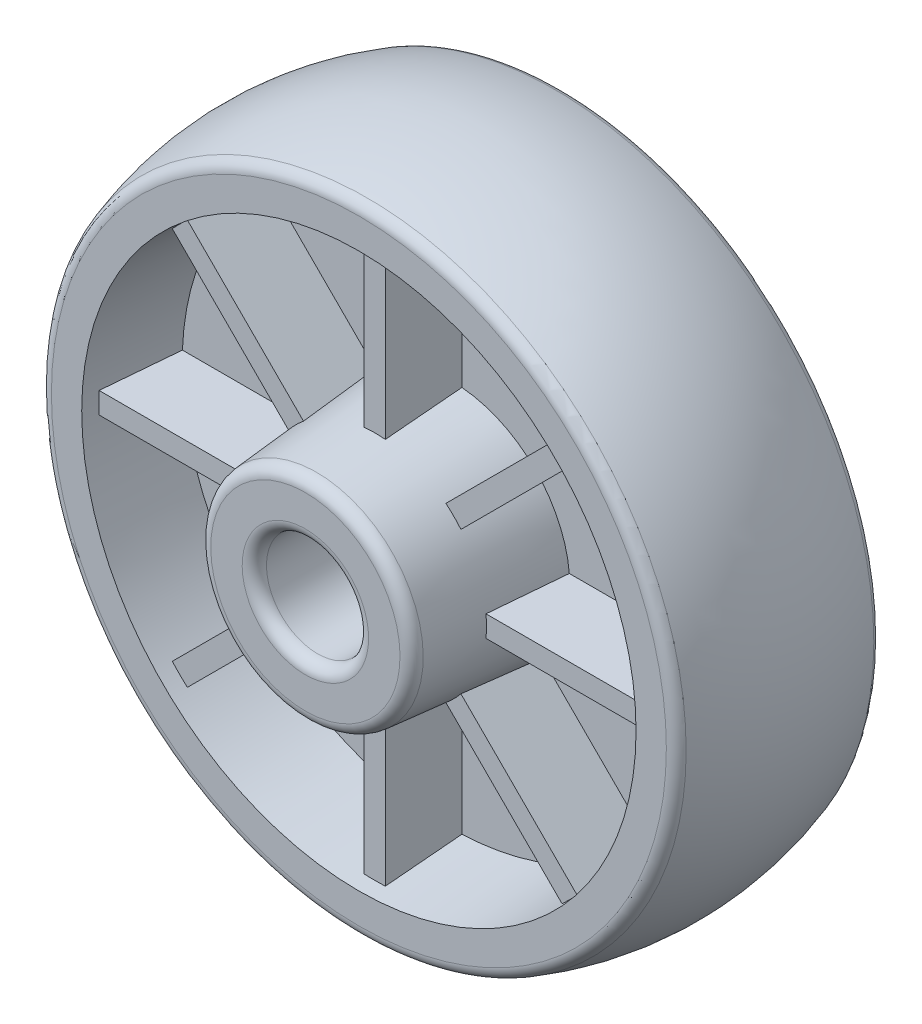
ISO-10303-21;
HEADER;
FILE_DESCRIPTION(('STEP AP214'),'2;1');
FILE_NAME('part.step','',(''),(''),'','','');
FILE_SCHEMA(('AUTOMOTIVE_DESIGN { 1 0 10303 214 1 1 1 1 }'));
ENDSEC;
DATA;
#1=APPLICATION_CONTEXT('core data for automotive mechanical design processes');
#2=APPLICATION_PROTOCOL_DEFINITION('international standard','automotive_design',2000,#1);
#3=PRODUCT_CONTEXT('',#1,'mechanical');
#4=PRODUCT('Part','Part','',(#3));
#5=PRODUCT_RELATED_PRODUCT_CATEGORY('part','',(#4));
#6=PRODUCT_DEFINITION_FORMATION('','',#4);
#7=PRODUCT_DEFINITION_CONTEXT('part definition',#1,'design');
#8=PRODUCT_DEFINITION('design','',#6,#7);
#9=PRODUCT_DEFINITION_SHAPE('','',#8);
#10=(LENGTH_UNIT() NAMED_UNIT(*) SI_UNIT(.MILLI.,.METRE.));
#11=(NAMED_UNIT(*) PLANE_ANGLE_UNIT() SI_UNIT($,.RADIAN.));
#12=(NAMED_UNIT(*) SI_UNIT($,.STERADIAN.) SOLID_ANGLE_UNIT());
#13=UNCERTAINTY_MEASURE_WITH_UNIT(LENGTH_MEASURE(1.E-05),#10,'distance_accuracy_value','');
#14=(GEOMETRIC_REPRESENTATION_CONTEXT(3) GLOBAL_UNCERTAINTY_ASSIGNED_CONTEXT((#13)) GLOBAL_UNIT_ASSIGNED_CONTEXT((#10,
#11,#12)) REPRESENTATION_CONTEXT('',''));
#15=CARTESIAN_POINT('',(0.,0.,0.));
#16=DIRECTION('',(0.,0.,1.));
#17=DIRECTION('',(1.,0.,0.));
#18=AXIS2_PLACEMENT_3D('',#15,#16,#17);
#19=CARTESIAN_POINT('',(0.,0.,11.8));
#20=DIRECTION('',(0.,0.,-1.));
#21=DIRECTION('',(0.877582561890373,0.479425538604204,0.));
#22=AXIS2_PLACEMENT_3D('',#19,#20,#21);
#23=TOROIDAL_SURFACE('',#22,5.2,1.);
#24=CARTESIAN_POINT('',(0.,0.,11.8));
#25=DIRECTION('',(0.,0.,1.));
#26=DIRECTION('',(1.,0.,0.));
#27=AXIS2_PLACEMENT_3D('',#24,#25,#26);
#28=CIRCLE('',#27,4.2);
#29=CARTESIAN_POINT('',(4.2,0.,11.8));
#30=VERTEX_POINT('',#29);
#31=EDGE_CURVE('E925',#30,#30,#28,.F.);
#32=ORIENTED_EDGE('',*,*,#31,.T.);
#33=EDGE_LOOP('',(#32));
#34=FACE_BOUND('',#33,.T.);
#35=CARTESIAN_POINT('',(0.,0.,12.8));
#36=DIRECTION('',(0.,0.,1.));
#37=DIRECTION('',(0.877582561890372,0.479425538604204,0.));
#38=AXIS2_PLACEMENT_3D('',#35,#36,#37);
#39=CIRCLE('',#38,5.19999999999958);
#40=CARTESIAN_POINT('',(-4.56342929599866,-2.49301284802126,12.8));
#41=VERTEX_POINT('',#40);
#42=CARTESIAN_POINT('',(4.56342932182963,2.49301280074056,12.8));
#43=VERTEX_POINT('',#42);
#44=EDGE_CURVE('E899',#41,#43,#39,.F.);
#45=ORIENTED_EDGE('',*,*,#44,.F.);
#46=CARTESIAN_POINT('',(-4.56342928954,-2.49301285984,12.8));
#47=CARTESIAN_POINT('',(-4.52263900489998,-2.56768273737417,12.8));
#48=CARTESIAN_POINT('',(-4.48001303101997,-2.64134959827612,12.8));
#49=CARTESIAN_POINT('',(-4.39119916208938,-2.78650395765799,12.8));
#50=CARTESIAN_POINT('',(-4.3450112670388,-2.8579914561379,12.8));
#51=CARTESIAN_POINT('',(-4.24918301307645,-2.99861376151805,12.8));
#52=CARTESIAN_POINT('',(-4.19954265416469,-3.0677485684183,12.8));
#53=CARTESIAN_POINT('',(-4.09692954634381,-3.20349923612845,12.8));
#54=CARTESIAN_POINT('',(-4.0439567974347,-3.27011509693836,12.8));
#55=CARTESIAN_POINT('',(-3.93480639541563,-3.40066730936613,12.8));
#56=CARTESIAN_POINT('',(-3.87862874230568,-3.46460366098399,12.8));
#57=CARTESIAN_POINT('',(-3.76320390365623,-3.5896428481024,12.8));
#58=CARTESIAN_POINT('',(-3.70395671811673,-3.65074568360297,12.8));
#59=CARTESIAN_POINT('',(-3.58253553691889,-3.76997063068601,12.8));
#60=CARTESIAN_POINT('',(-3.52036154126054,-3.8280927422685,12.8));
#61=CARTESIAN_POINT('',(-3.39323652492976,-3.94121622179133,12.8));
#62=CARTESIAN_POINT('',(-3.32828550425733,-3.99621758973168,12.8));
#63=CARTESIAN_POINT('',(-3.19576290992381,-4.10296707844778,12.8));
#64=CARTESIAN_POINT('',(-3.12819133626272,-4.15471519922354,12.8));
#65=CARTESIAN_POINT('',(-2.99059042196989,-4.25483352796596,12.8));
#66=CARTESIAN_POINT('',(-2.92056108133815,-4.30320373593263,12.8));
#67=CARTESIAN_POINT('',(-2.77821333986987,-4.39644971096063,12.8));
#68=CARTESIAN_POINT('',(-2.70589493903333,-4.44132547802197,12.8));
#69=CARTESIAN_POINT('',(-2.55914329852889,-4.52747446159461,12.8));
#70=CARTESIAN_POINT('',(-2.48471005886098,-4.5687476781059,12.8));
#71=CARTESIAN_POINT('',(-2.33390805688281,-4.64759212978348,12.8));
#72=CARTESIAN_POINT('',(-2.25753929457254,-4.68516336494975,12.8));
#73=CARTESIAN_POINT('',(-2.10305022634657,-4.75651334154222,12.8));
#74=CARTESIAN_POINT('',(-2.02492992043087,-4.79029208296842,12.8));
#75=CARTESIAN_POINT('',(-1.86712596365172,-4.8539756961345,12.8));
#76=CARTESIAN_POINT('',(-1.78744231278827,-4.88388056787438,12.8));
#77=CARTESIAN_POINT('',(-1.6267036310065,-4.93974439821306,12.8));
#78=CARTESIAN_POINT('',(-1.54564860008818,-4.96570335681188,12.8));
#79=CARTESIAN_POINT('',(-1.38236242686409,-5.01361282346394,12.8));
#80=CARTESIAN_POINT('',(-1.30013128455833,-5.03556333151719,12.8));
#81=CARTESIAN_POINT('',(-1.13469099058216,-5.07540301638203,12.8));
#82=CARTESIAN_POINT('',(-1.05148183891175,-5.09329219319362,12.8));
#83=CARTESIAN_POINT('',(-0.884285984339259,-5.12496611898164,12.8));
#84=CARTESIAN_POINT('',(-0.800299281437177,-5.13875086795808,12.8));
#85=CARTESIAN_POINT('',(-0.631750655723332,-5.16218272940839,12.8));
#86=CARTESIAN_POINT('',(-0.547188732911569,-5.17182984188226,12.8));
#87=CARTESIAN_POINT('',(-0.377693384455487,-5.1869631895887,12.8));
#88=CARTESIAN_POINT('',(-0.292759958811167,-5.19244942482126,12.8));
#89=CARTESIAN_POINT('',(-0.122726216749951,-5.19924780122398,12.8));
#90=CARTESIAN_POINT('',(-0.0376259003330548,-5.20055994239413,12.8));
#91=CARTESIAN_POINT('',(0.13253660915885,-5.19900696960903,12.8));
#92=CARTESIAN_POINT('',(0.217598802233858,-5.19614185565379,12.8));
#93=CARTESIAN_POINT('',(0.387480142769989,-5.18624127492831,12.8));
#94=CARTESIAN_POINT('',(0.472299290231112,-5.17920580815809,12.8));
#95=CARTESIAN_POINT('',(0.641490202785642,-5.1609814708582,12.8));
#96=CARTESIAN_POINT('',(0.72586196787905,-5.14979260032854,12.8));
#97=CARTESIAN_POINT('',(0.893954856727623,-5.12328841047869,12.8));
#98=CARTESIAN_POINT('',(0.977675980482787,-5.1079730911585,12.8));
#99=CARTESIAN_POINT('',(1.14426589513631,-5.073252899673,12.8));
#100=CARTESIAN_POINT('',(1.22713468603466,-5.0538480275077,12.8));
#101=CARTESIAN_POINT('',(1.39182029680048,-5.01099547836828,12.8));
#102=CARTESIAN_POINT('',(1.47363711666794,-4.98754780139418,12.8));
#103=CARTESIAN_POINT('',(1.63602168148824,-4.93666613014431,12.8));
#104=CARTESIAN_POINT('',(1.71658942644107,-4.90923213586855,12.8));
#105=CARTESIAN_POINT('',(1.87628174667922,-4.85044392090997,12.8));
#106=CARTESIAN_POINT('',(1.95540632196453,-4.81908970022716,12.8));
#107=CARTESIAN_POINT('',(2.11202168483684,-4.75253656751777,12.8));
#108=CARTESIAN_POINT('',(2.18951247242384,-4.7173376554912,12.8));
#109=CARTESIAN_POINT('',(2.34267357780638,-4.64317993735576,12.8));
#110=CARTESIAN_POINT('',(2.41834389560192,-4.60422113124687,12.8));
#111=CARTESIAN_POINT('',(2.56768176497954,-4.52263748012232,12.8));
#112=CARTESIAN_POINT('',(2.64134931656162,-4.48001263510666,12.8));
#113=CARTESIAN_POINT('',(2.7865041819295,-4.39119959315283,12.8));
#114=CARTESIAN_POINT('',(2.8579914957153,-4.34501139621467,12.8));
#115=CARTESIAN_POINT('',(2.99861366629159,-4.24918292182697,12.8));
#116=CARTESIAN_POINT('',(3.06774852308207,-4.19954264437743,12.8));
#117=CARTESIAN_POINT('',(3.20349922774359,-4.09692959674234,12.8));
#118=CARTESIAN_POINT('',(3.27011507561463,-4.04395682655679,12.8));
#119=CARTESIAN_POINT('',(3.40066727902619,-3.93480640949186,12.8));
#120=CARTESIAN_POINT('',(3.46460363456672,-3.87862876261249,12.8));
#121=CARTESIAN_POINT('',(3.58964282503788,-3.76320392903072,12.8));
#122=CARTESIAN_POINT('',(3.65074565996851,-3.70395674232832,12.8));
#123=CARTESIAN_POINT('',(3.76997060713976,-3.58253556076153,12.8));
#124=CARTESIAN_POINT('',(3.82809271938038,-3.52036156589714,12.8));
#125=CARTESIAN_POINT('',(3.94121619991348,-3.39323655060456,12.8));
#126=CARTESIAN_POINT('',(3.99621756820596,-3.32828553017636,12.8));
#127=CARTESIAN_POINT('',(4.10296705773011,-3.19576293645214,12.8));
#128=CARTESIAN_POINT('',(4.15471517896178,-3.1281913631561,12.8));
#129=CARTESIAN_POINT('',(4.25483350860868,-2.99059044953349,12.8));
#130=CARTESIAN_POINT('',(4.30320371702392,-2.92056110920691,12.8));
#131=CARTESIAN_POINT('',(4.39644969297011,-2.77821336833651,12.8));
#132=CARTESIAN_POINT('',(4.44132546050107,-2.70589496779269,12.8));
#133=CARTESIAN_POINT('',(4.52747444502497,-2.55914332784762,12.8));
#134=CARTESIAN_POINT('',(4.56874766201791,-2.48471008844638,12.8));
#135=CARTESIAN_POINT('',(4.64759211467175,-2.33390808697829,12.8));
#136=CARTESIAN_POINT('',(4.68516335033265,-2.25753932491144,12.8));
#137=CARTESIAN_POINT('',(4.75651332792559,-2.10305025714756,12.8));
#138=CARTESIAN_POINT('',(4.79029206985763,-2.02492995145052,12.8));
#139=CARTESIAN_POINT('',(4.85397568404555,-1.86712599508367,12.8));
#140=CARTESIAN_POINT('',(4.88388055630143,-1.78744234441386,12.8));
#141=CARTESIAN_POINT('',(4.93974438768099,-1.62670366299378,12.8));
#142=CARTESIAN_POINT('',(4.96570334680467,-1.54564863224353,12.8));
#143=CARTESIAN_POINT('',(5.01361281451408,-1.38236245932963,12.8));
#144=CARTESIAN_POINT('',(5.03556332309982,-1.30013131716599,12.8));
#145=CARTESIAN_POINT('',(5.07540300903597,-1.13469102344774,12.8));
#146=CARTESIAN_POINT('',(5.09329218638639,-1.05148187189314,12.8));
#147=CARTESIAN_POINT('',(5.12496611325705,-0.884286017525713,12.8));
#148=CARTESIAN_POINT('',(5.13875086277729,-0.800299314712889,12.8));
#149=CARTESIAN_POINT('',(5.16218272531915,-0.631750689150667,12.8));
#150=CARTESIAN_POINT('',(5.17182983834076,-0.547188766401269,12.8));
#151=CARTESIAN_POINT('',(5.18696318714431,-0.377693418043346,12.8));
#152=CARTESIAN_POINT('',(5.19244942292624,-0.292759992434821,12.8));
#153=CARTESIAN_POINT('',(5.19924780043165,-0.122726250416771,12.8));
#154=CARTESIAN_POINT('',(5.20055994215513,-0.0376259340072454,12.8));
#155=CARTESIAN_POINT('',(5.1990069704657,0.132536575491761,12.8));
#156=CARTESIAN_POINT('',(5.19614185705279,0.217598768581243,12.8));
#157=CARTESIAN_POINT('',(5.18624127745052,0.387480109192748,12.8));
#158=CARTESIAN_POINT('',(5.17920581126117,0.472299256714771,12.8));
#159=CARTESIAN_POINT('',(5.16098147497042,0.641490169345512,12.8));
#160=CARTESIAN_POINT('',(5.14979260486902,0.725861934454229,12.8));
#161=CARTESIAN_POINT('',(5.12328841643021,0.893954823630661,12.8));
#162=CARTESIAN_POINT('',(5.10797309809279,0.977675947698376,12.8));
#163=CARTESIAN_POINT('',(5.07325290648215,1.14426586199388,12.8));
#164=CARTESIAN_POINT('',(5.05384803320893,1.22713465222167,12.8));
#165=CARTESIAN_POINT('',(5.01099548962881,1.3918202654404,12.8));
#166=CARTESIAN_POINT('',(4.9875478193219,1.47363708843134,12.8));
#167=CARTESIAN_POINT('',(4.93666613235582,1.63602164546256,12.8));
#168=CARTESIAN_POINT('',(4.90923211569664,1.71658937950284,12.8));
#169=CARTESIAN_POINT('',(4.85044396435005,1.87628173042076,12.8));
#170=CARTESIAN_POINT('',(4.81908982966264,1.9554063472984,12.8));
#171=CARTESIAN_POINT('',(4.75253646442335,2.1120215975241,12.8));
#172=CARTESIAN_POINT('',(4.71733723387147,2.18951223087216,12.8));
#173=CARTESIAN_POINT('',(4.64318038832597,2.34267375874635,12.8));
#174=CARTESIAN_POINT('',(4.60422277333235,2.41834465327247,12.8));
#175=CARTESIAN_POINT('',(4.5634293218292,2.49301280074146,12.8));
#176=B_SPLINE_CURVE_WITH_KNOTS('',3,(#46,#47,#48,#49,#50,#51,#52,#53,#54,#55,#56,#57,#58,#59,
#60,#61,#62,#63,#64,#65,#66,#67,#68,#69,#70,#71,#72,#73,#74,#75,#76,#77,#78,#79,#80,#81,#82,#83,
#84,#85,#86,#87,#88,#89,#90,#91,#92,#93,#94,#95,#96,#97,#98,#99,#100,#101,#102,#103,#104,#105,
#106,#107,#108,#109,#110,#111,#112,#113,#114,#115,#116,#117,#118,#119,#120,#121,#122,#123,#124,
#125,#126,#127,#128,#129,#130,#131,#132,#133,#134,#135,#136,#137,#138,#139,#140,#141,#142,#143,
#144,#145,#146,#147,#148,#149,#150,#151,#152,#153,#154,#155,#156,#157,#158,#159,#160,#161,#162,
#163,#164,#165,#166,#167,#168,#169,#170,#171,#172,#173,#174,#175),.UNSPECIFIED.,.F.,.F.,(4,2,2,
2,2,2,2,2,2,2,2,2,2,2,2,2,2,2,2,2,2,2,2,2,2,2,2,2,2,2,2,2,2,2,2,2,2,2,2,2,2,2,2,2,2,2,2,2,2,2,2,
2,2,2,2,2,2,2,2,2,2,2,2,2,4),(0.,0.255228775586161,0.510457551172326,0.765686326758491,
1.02091510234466,1.27614387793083,1.531372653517,1.78660142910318,2.04183020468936,
2.29705898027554,2.55228775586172,2.80751653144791,3.06274530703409,3.31797408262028,
3.57320285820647,3.82843163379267,4.08366040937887,4.33888918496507,4.59411796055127,
4.84934673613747,5.10457551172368,5.35980428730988,5.6150330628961,5.87026183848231,
6.12549061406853,6.38071938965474,6.63594816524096,6.89117694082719,7.14640571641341,
7.40163449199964,7.65686326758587,7.9120920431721,8.16732081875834,8.42254959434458,
8.67777836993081,8.93300714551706,9.1882359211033,9.44346469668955,9.6986934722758,
9.95392224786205,10.2091510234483,10.4643797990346,10.7196085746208,10.9748373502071,
11.2300661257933,11.4852949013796,11.7405236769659,11.9957524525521,12.2509812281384,
12.5062100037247,12.761438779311,13.0166675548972,13.2718963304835,13.5271251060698,
13.7823538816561,14.0375826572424,14.2928114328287,14.548040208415,14.8032689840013,
15.0584977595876,15.3137265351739,15.5689553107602,15.8241840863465,16.0794128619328,
16.3346416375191),.UNSPECIFIED.);
#177=EDGE_CURVE('E933',#43,#41,#176,.F.);
#178=ORIENTED_EDGE('',*,*,#177,.F.);
#179=EDGE_LOOP('',(#45,#178));
#180=FACE_BOUND('',#179,.T.);
#181=ADVANCED_FACE('F16',(#34,#180),#23,.T.);
#182=CARTESIAN_POINT('',(0.,0.,-6.4));
#183=DIRECTION('',(0.,0.,1.));
#184=DIRECTION('',(1.,0.,0.));
#185=AXIS2_PLACEMENT_3D('',#182,#183,#184);
#186=CYLINDRICAL_SURFACE('',#185,4.2);
#187=ORIENTED_EDGE('',*,*,#31,.F.);
#188=EDGE_LOOP('',(#187));
#189=FACE_BOUND('',#188,.T.);
#190=CARTESIAN_POINT('',(0.,0.,-11.8));
#191=DIRECTION('',(0.,0.,1.));
#192=DIRECTION('',(0.877582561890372,0.479425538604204,0.));
#193=AXIS2_PLACEMENT_3D('',#190,#191,#192);
#194=CIRCLE('',#193,4.2);
#195=CARTESIAN_POINT('',(3.68584675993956,2.01358726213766,-11.8));
#196=VERTEX_POINT('',#195);
#197=EDGE_CURVE('E911',#196,#196,#194,.T.);
#198=ORIENTED_EDGE('',*,*,#197,.F.);
#199=EDGE_LOOP('',(#198));
#200=FACE_BOUND('',#199,.T.);
#201=ADVANCED_FACE('F879',(#189,#200),#186,.F.);
#202=CARTESIAN_POINT('',(4.2,0.,12.8));
#203=DIRECTION('',(0.,0.,1.));
#204=DIRECTION('',(1.,0.,0.));
#205=AXIS2_PLACEMENT_3D('',#202,#203,#204);
#206=PLANE('',#205);
#207=ORIENTED_EDGE('',*,*,#177,.T.);
#208=ORIENTED_EDGE('',*,*,#44,.T.);
#209=EDGE_LOOP('',(#207,#208));
#210=FACE_BOUND('',#209,.T.);
#211=CARTESIAN_POINT('',(0.,0.,12.8));
#212=DIRECTION('',(0.,0.,-1.));
#213=DIRECTION('',(0.877582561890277,0.479425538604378,0.));
#214=AXIS2_PLACEMENT_3D('',#211,#212,#213);
#215=CIRCLE('',#214,7.78366882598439);
#216=CARTESIAN_POINT('',(6.83081202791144,3.73168962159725,12.8));
#217=VERTEX_POINT('',#216);
#218=CARTESIAN_POINT('',(-6.83081199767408,-3.73168967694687,12.8));
#219=VERTEX_POINT('',#218);
#220=EDGE_CURVE('E866',#217,#219,#215,.T.);
#221=ORIENTED_EDGE('',*,*,#220,.F.);
#222=CARTESIAN_POINT('',(0.,0.,12.8));
#223=DIRECTION('',(0.,0.,-1.));
#224=DIRECTION('',(-0.877582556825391,-0.479425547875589,0.));
#225=AXIS2_PLACEMENT_3D('',#222,#223,#224);
#226=CIRCLE('',#225,7.78366882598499);
#227=EDGE_CURVE('E822',#219,#217,#226,.T.);
#228=ORIENTED_EDGE('',*,*,#227,.F.);
#229=EDGE_LOOP('',(#221,#228));
#230=FACE_BOUND('',#229,.T.);
#231=ADVANCED_FACE('F871',(#210,#230),#206,.T.);
#232=CARTESIAN_POINT('',(0.,0.,-11.8));
#233=DIRECTION('',(0.,0.,1.));
#234=DIRECTION('',(0.877582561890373,0.479425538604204,0.));
#235=AXIS2_PLACEMENT_3D('',#232,#233,#234);
#236=TOROIDAL_SURFACE('',#235,5.2,1.);
#237=ORIENTED_EDGE('',*,*,#197,.T.);
#238=EDGE_LOOP('',(#237));
#239=FACE_BOUND('',#238,.T.);
#240=CARTESIAN_POINT('',(0.,0.,-12.8));
#241=DIRECTION('',(0.,0.,-1.));
#242=DIRECTION('',(-0.877582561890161,-0.47942553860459,0.));
#243=AXIS2_PLACEMENT_3D('',#240,#241,#242);
#244=CIRCLE('',#243,5.19999999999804);
#245=CARTESIAN_POINT('',(-4.56342930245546,-2.49301283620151,-12.8));
#246=VERTEX_POINT('',#245);
#247=CARTESIAN_POINT('',(4.56342932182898,2.4930128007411,-12.8));
#248=VERTEX_POINT('',#247);
#249=EDGE_CURVE('E854',#246,#248,#244,.T.);
#250=ORIENTED_EDGE('',*,*,#249,.T.);
#251=CARTESIAN_POINT('',(4.5634293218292,2.49301280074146,-12.8));
#252=CARTESIAN_POINT('',(4.60422277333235,2.41834465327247,-12.8));
#253=CARTESIAN_POINT('',(4.64318038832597,2.34267375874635,-12.8));
#254=CARTESIAN_POINT('',(4.71733723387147,2.18951223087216,-12.8));
#255=CARTESIAN_POINT('',(4.75253646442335,2.1120215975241,-12.8));
#256=CARTESIAN_POINT('',(4.81908982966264,1.9554063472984,-12.8));
#257=CARTESIAN_POINT('',(4.85044396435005,1.87628173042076,-12.8));
#258=CARTESIAN_POINT('',(4.90923211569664,1.71658937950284,-12.8));
#259=CARTESIAN_POINT('',(4.93666613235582,1.63602164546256,-12.8));
#260=CARTESIAN_POINT('',(4.9875478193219,1.47363708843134,-12.8));
#261=CARTESIAN_POINT('',(5.01099548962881,1.3918202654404,-12.8));
#262=CARTESIAN_POINT('',(5.05384803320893,1.22713465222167,-12.8));
#263=CARTESIAN_POINT('',(5.07325290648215,1.14426586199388,-12.8));
#264=CARTESIAN_POINT('',(5.10797309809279,0.977675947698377,-12.8));
#265=CARTESIAN_POINT('',(5.12328841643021,0.893954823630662,-12.8));
#266=CARTESIAN_POINT('',(5.14979260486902,0.725861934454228,-12.8));
#267=CARTESIAN_POINT('',(5.16098147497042,0.641490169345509,-12.8));
#268=CARTESIAN_POINT('',(5.17920581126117,0.472299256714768,-12.8));
#269=CARTESIAN_POINT('',(5.18624127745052,0.387480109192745,-12.8));
#270=CARTESIAN_POINT('',(5.19614185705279,0.21759876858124,-12.8));
#271=CARTESIAN_POINT('',(5.1990069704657,0.132536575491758,-12.8));
#272=CARTESIAN_POINT('',(5.20055994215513,-0.0376259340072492,-12.8));
#273=CARTESIAN_POINT('',(5.19924780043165,-0.122726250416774,-12.8));
#274=CARTESIAN_POINT('',(5.19244942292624,-0.292759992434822,-12.8));
#275=CARTESIAN_POINT('',(5.18696318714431,-0.377693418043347,-12.8));
#276=CARTESIAN_POINT('',(5.17182983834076,-0.54718876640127,-12.8));
#277=CARTESIAN_POINT('',(5.16218272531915,-0.631750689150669,-12.8));
#278=CARTESIAN_POINT('',(5.13875086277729,-0.800299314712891,-12.8));
#279=CARTESIAN_POINT('',(5.12496611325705,-0.884286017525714,-12.8));
#280=CARTESIAN_POINT('',(5.09329218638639,-1.05148187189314,-12.8));
#281=CARTESIAN_POINT('',(5.07540300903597,-1.13469102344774,-12.8));
#282=CARTESIAN_POINT('',(5.03556332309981,-1.30013131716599,-12.8));
#283=CARTESIAN_POINT('',(5.01361281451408,-1.38236245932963,-12.8));
#284=CARTESIAN_POINT('',(4.96570334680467,-1.54564863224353,-12.8));
#285=CARTESIAN_POINT('',(4.93974438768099,-1.62670366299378,-12.8));
#286=CARTESIAN_POINT('',(4.88388055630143,-1.78744234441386,-12.8));
#287=CARTESIAN_POINT('',(4.85397568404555,-1.86712599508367,-12.8));
#288=CARTESIAN_POINT('',(4.79029206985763,-2.02492995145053,-12.8));
#289=CARTESIAN_POINT('',(4.75651332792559,-2.10305025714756,-12.8));
#290=CARTESIAN_POINT('',(4.68516335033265,-2.25753932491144,-12.8));
#291=CARTESIAN_POINT('',(4.64759211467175,-2.33390808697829,-12.8));
#292=CARTESIAN_POINT('',(4.56874766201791,-2.48471008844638,-12.8));
#293=CARTESIAN_POINT('',(4.52747444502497,-2.55914332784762,-12.8));
#294=CARTESIAN_POINT('',(4.44132546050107,-2.70589496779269,-12.8));
#295=CARTESIAN_POINT('',(4.39644969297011,-2.77821336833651,-12.8));
#296=CARTESIAN_POINT('',(4.30320371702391,-2.92056110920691,-12.8));
#297=CARTESIAN_POINT('',(4.25483350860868,-2.99059044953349,-12.8));
#298=CARTESIAN_POINT('',(4.15471517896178,-3.1281913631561,-12.8));
#299=CARTESIAN_POINT('',(4.10296705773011,-3.19576293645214,-12.8));
#300=CARTESIAN_POINT('',(3.99621756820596,-3.32828553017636,-12.8));
#301=CARTESIAN_POINT('',(3.94121619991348,-3.39323655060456,-12.8));
#302=CARTESIAN_POINT('',(3.82809271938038,-3.52036156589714,-12.8));
#303=CARTESIAN_POINT('',(3.76997060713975,-3.58253556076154,-12.8));
#304=CARTESIAN_POINT('',(3.6507456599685,-3.70395674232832,-12.8));
#305=CARTESIAN_POINT('',(3.58964282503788,-3.76320392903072,-12.8));
#306=CARTESIAN_POINT('',(3.46460363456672,-3.87862876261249,-12.8));
#307=CARTESIAN_POINT('',(3.40066727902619,-3.93480640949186,-12.8));
#308=CARTESIAN_POINT('',(3.27011507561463,-4.04395682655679,-12.8));
#309=CARTESIAN_POINT('',(3.20349922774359,-4.09692959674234,-12.8));
#310=CARTESIAN_POINT('',(3.06774852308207,-4.19954264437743,-12.8));
#311=CARTESIAN_POINT('',(2.99861366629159,-4.24918292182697,-12.8));
#312=CARTESIAN_POINT('',(2.8579914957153,-4.34501139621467,-12.8));
#313=CARTESIAN_POINT('',(2.7865041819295,-4.39119959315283,-12.8));
#314=CARTESIAN_POINT('',(2.64134931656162,-4.48001263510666,-12.8));
#315=CARTESIAN_POINT('',(2.56768176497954,-4.52263748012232,-12.8));
#316=CARTESIAN_POINT('',(2.41834389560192,-4.60422113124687,-12.8));
#317=CARTESIAN_POINT('',(2.34267357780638,-4.64317993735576,-12.8));
#318=CARTESIAN_POINT('',(2.18951247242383,-4.71733765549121,-12.8));
#319=CARTESIAN_POINT('',(2.11202168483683,-4.75253656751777,-12.8));
#320=CARTESIAN_POINT('',(1.95540632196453,-4.81908970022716,-12.8));
#321=CARTESIAN_POINT('',(1.87628174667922,-4.85044392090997,-12.8));
#322=CARTESIAN_POINT('',(1.71658942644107,-4.90923213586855,-12.8));
#323=CARTESIAN_POINT('',(1.63602168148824,-4.93666613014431,-12.8));
#324=CARTESIAN_POINT('',(1.47363711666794,-4.98754780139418,-12.8));
#325=CARTESIAN_POINT('',(1.39182029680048,-5.01099547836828,-12.8));
#326=CARTESIAN_POINT('',(1.22713468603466,-5.05384802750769,-12.8));
#327=CARTESIAN_POINT('',(1.14426589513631,-5.073252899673,-12.8));
#328=CARTESIAN_POINT('',(0.977675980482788,-5.1079730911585,-12.8));
#329=CARTESIAN_POINT('',(0.893954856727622,-5.12328841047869,-12.8));
#330=CARTESIAN_POINT('',(0.725861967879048,-5.14979260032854,-12.8));
#331=CARTESIAN_POINT('',(0.641490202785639,-5.1609814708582,-12.8));
#332=CARTESIAN_POINT('',(0.472299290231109,-5.17920580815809,-12.8));
#333=CARTESIAN_POINT('',(0.387480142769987,-5.18624127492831,-12.8));
#334=CARTESIAN_POINT('',(0.217598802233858,-5.19614185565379,-12.8));
#335=CARTESIAN_POINT('',(0.13253660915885,-5.19900696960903,-12.8));
#336=CARTESIAN_POINT('',(-0.0376259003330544,-5.20055994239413,-12.8));
#337=CARTESIAN_POINT('',(-0.122726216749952,-5.19924780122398,-12.8));
#338=CARTESIAN_POINT('',(-0.29275995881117,-5.19244942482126,-12.8));
#339=CARTESIAN_POINT('',(-0.377693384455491,-5.1869631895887,-12.8));
#340=CARTESIAN_POINT('',(-0.547188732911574,-5.17182984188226,-12.8));
#341=CARTESIAN_POINT('',(-0.631750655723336,-5.16218272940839,-12.8));
#342=CARTESIAN_POINT('',(-0.800299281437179,-5.13875086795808,-12.8));
#343=CARTESIAN_POINT('',(-0.884285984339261,-5.12496611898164,-12.8));
#344=CARTESIAN_POINT('',(-1.05148183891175,-5.09329219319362,-12.8));
#345=CARTESIAN_POINT('',(-1.13469099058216,-5.07540301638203,-12.8));
#346=CARTESIAN_POINT('',(-1.30013128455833,-5.03556333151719,-12.8));
#347=CARTESIAN_POINT('',(-1.38236242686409,-5.01361282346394,-12.8));
#348=CARTESIAN_POINT('',(-1.54564860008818,-4.96570335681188,-12.8));
#349=CARTESIAN_POINT('',(-1.6267036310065,-4.93974439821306,-12.8));
#350=CARTESIAN_POINT('',(-1.78744231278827,-4.88388056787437,-12.8));
#351=CARTESIAN_POINT('',(-1.86712596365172,-4.8539756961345,-12.8));
#352=CARTESIAN_POINT('',(-2.02492992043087,-4.79029208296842,-12.8));
#353=CARTESIAN_POINT('',(-2.10305022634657,-4.75651334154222,-12.8));
#354=CARTESIAN_POINT('',(-2.25753929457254,-4.68516336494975,-12.8));
#355=CARTESIAN_POINT('',(-2.33390805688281,-4.64759212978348,-12.8));
#356=CARTESIAN_POINT('',(-2.48471005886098,-4.5687476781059,-12.8));
#357=CARTESIAN_POINT('',(-2.55914329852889,-4.52747446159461,-12.8));
#358=CARTESIAN_POINT('',(-2.70589493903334,-4.44132547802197,-12.8));
#359=CARTESIAN_POINT('',(-2.77821333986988,-4.39644971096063,-12.8));
#360=CARTESIAN_POINT('',(-2.92056108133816,-4.30320373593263,-12.8));
#361=CARTESIAN_POINT('',(-2.99059042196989,-4.25483352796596,-12.8));
#362=CARTESIAN_POINT('',(-3.12819133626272,-4.15471519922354,-12.8));
#363=CARTESIAN_POINT('',(-3.19576290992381,-4.10296707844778,-12.8));
#364=CARTESIAN_POINT('',(-3.32828550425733,-3.99621758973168,-12.8));
#365=CARTESIAN_POINT('',(-3.39323652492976,-3.94121622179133,-12.8));
#366=CARTESIAN_POINT('',(-3.52036154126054,-3.8280927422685,-12.8));
#367=CARTESIAN_POINT('',(-3.58253553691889,-3.76997063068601,-12.8));
#368=CARTESIAN_POINT('',(-3.70395671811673,-3.65074568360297,-12.8));
#369=CARTESIAN_POINT('',(-3.76320390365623,-3.58964284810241,-12.8));
#370=CARTESIAN_POINT('',(-3.87862874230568,-3.46460366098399,-12.8));
#371=CARTESIAN_POINT('',(-3.93480639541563,-3.40066730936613,-12.8));
#372=CARTESIAN_POINT('',(-4.0439567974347,-3.27011509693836,-12.8));
#373=CARTESIAN_POINT('',(-4.09692954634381,-3.20349923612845,-12.8));
#374=CARTESIAN_POINT('',(-4.19954265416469,-3.06774856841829,-12.8));
#375=CARTESIAN_POINT('',(-4.24918301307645,-2.99861376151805,-12.8));
#376=CARTESIAN_POINT('',(-4.3450112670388,-2.8579914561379,-12.8));
#377=CARTESIAN_POINT('',(-4.39119916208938,-2.78650395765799,-12.8));
#378=CARTESIAN_POINT('',(-4.48001303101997,-2.64134959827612,-12.8));
#379=CARTESIAN_POINT('',(-4.52263900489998,-2.56768273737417,-12.8));
#380=CARTESIAN_POINT('',(-4.56342928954,-2.49301285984,-12.8));
#381=B_SPLINE_CURVE_WITH_KNOTS('',3,(#251,#252,#253,#254,#255,#256,#257,#258,#259,#260,#261,
#262,#263,#264,#265,#266,#267,#268,#269,#270,#271,#272,#273,#274,#275,#276,#277,#278,#279,#280,
#281,#282,#283,#284,#285,#286,#287,#288,#289,#290,#291,#292,#293,#294,#295,#296,#297,#298,#299,
#300,#301,#302,#303,#304,#305,#306,#307,#308,#309,#310,#311,#312,#313,#314,#315,#316,#317,#318,
#319,#320,#321,#322,#323,#324,#325,#326,#327,#328,#329,#330,#331,#332,#333,#334,#335,#336,#337,
#338,#339,#340,#341,#342,#343,#344,#345,#346,#347,#348,#349,#350,#351,#352,#353,#354,#355,#356,
#357,#358,#359,#360,#361,#362,#363,#364,#365,#366,#367,#368,#369,#370,#371,#372,#373,#374,#375,
#376,#377,#378,#379,#380),.UNSPECIFIED.,.F.,.F.,(4,2,2,2,2,2,2,2,2,2,2,2,2,2,2,2,2,2,2,2,2,2,2,
2,2,2,2,2,2,2,2,2,2,2,2,2,2,2,2,2,2,2,2,2,2,2,2,2,2,2,2,2,2,2,2,2,2,2,2,2,2,2,2,2,4),(0.,
0.255228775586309,0.510457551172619,0.765686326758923,1.02091510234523,1.27614387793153,
1.53137265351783,1.78660142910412,2.04183020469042,2.29705898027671,2.552287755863,
2.80751653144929,3.06274530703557,3.31797408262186,3.57320285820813,3.82843163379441,
4.08366040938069,4.33888918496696,4.59411796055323,4.84934673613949,5.10457551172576,
5.35980428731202,5.61503306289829,5.87026183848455,6.1254906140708,6.38071938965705,
6.63594816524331,6.89117694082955,7.1464057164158,7.40163449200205,7.65686326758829,
7.91209204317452,8.16732081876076,8.422549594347,8.67777836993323,8.93300714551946,
9.18823592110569,9.44346469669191,9.69869347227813,9.95392224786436,10.2091510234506,
10.4643797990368,10.719608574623,10.9748373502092,11.2300661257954,11.4852949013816,
11.7405236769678,11.995752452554,12.2509812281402,12.5062100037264,12.7614387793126,
13.0166675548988,13.271896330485,13.5271251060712,13.7823538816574,14.0375826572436,
14.2928114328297,14.5480402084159,14.8032689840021,15.0584977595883,15.3137265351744,
15.5689553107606,15.8241840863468,16.0794128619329,16.3346416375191),.UNSPECIFIED.);
#382=EDGE_CURVE('E2424',#248,#246,#381,.T.);
#383=ORIENTED_EDGE('',*,*,#382,.T.);
#384=EDGE_LOOP('',(#250,#383));
#385=FACE_BOUND('',#384,.T.);
#386=ADVANCED_FACE('F839',(#239,#385),#236,.T.);
#387=CARTESIAN_POINT('',(0.,0.,11.8));
#388=DIRECTION('',(0.,0.,-1.));
#389=DIRECTION('',(-0.997385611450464,-0.0722630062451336,0.));
#390=AXIS2_PLACEMENT_3D('',#387,#388,#389);
#391=TOROIDAL_SURFACE('',#390,7.78366882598,1.);
#392=CARTESIAN_POINT('',(0.,0.,11.8871557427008));
#393=DIRECTION('',(0.,0.,-1.));
#394=DIRECTION('',(-0.877582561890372,-0.479425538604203,0.));
#395=AXIS2_PLACEMENT_3D('',#392,#393,#394);
#396=CIRCLE('',#395,8.77986352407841);
#397=CARTESIAN_POINT('',(-7.70505512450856,-4.20929079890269,11.8871557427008));
#398=VERTEX_POINT('',#397);
#399=EDGE_CURVE('E848',#398,#398,#396,.T.);
#400=ORIENTED_EDGE('',*,*,#399,.F.);
#401=EDGE_LOOP('',(#400));
#402=FACE_BOUND('',#401,.T.);
#403=ORIENTED_EDGE('',*,*,#220,.T.);
#404=ORIENTED_EDGE('',*,*,#227,.T.);
#405=EDGE_LOOP('',(#403,#404));
#406=FACE_BOUND('',#405,.T.);
#407=ADVANCED_FACE('F828',(#402,#406),#391,.T.);
#408=CARTESIAN_POINT('',(4.2,0.,-12.8));
#409=DIRECTION('',(0.,0.,1.));
#410=DIRECTION('',(1.,0.,0.));
#411=AXIS2_PLACEMENT_3D('',#408,#409,#410);
#412=PLANE('',#411);
#413=ORIENTED_EDGE('',*,*,#382,.F.);
#414=ORIENTED_EDGE('',*,*,#249,.F.);
#415=EDGE_LOOP('',(#413,#414));
#416=FACE_BOUND('',#415,.T.);
#417=CARTESIAN_POINT('',(0.,0.,-12.8));
#418=DIRECTION('',(0.,0.,1.));
#419=DIRECTION('',(-0.877582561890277,-0.479425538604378,0.));
#420=AXIS2_PLACEMENT_3D('',#417,#418,#419);
#421=CIRCLE('',#420,7.7836688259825);
#422=CARTESIAN_POINT('',(-6.83081200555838,-3.73168966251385,-12.8));
#423=VERTEX_POINT('',#422);
#424=CARTESIAN_POINT('',(6.83081202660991,3.73168962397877,-12.8));
#425=VERTEX_POINT('',#424);
#426=EDGE_CURVE('E463',#423,#425,#421,.T.);
#427=ORIENTED_EDGE('',*,*,#426,.F.);
#428=CARTESIAN_POINT('',(0.,0.,-12.8));
#429=DIRECTION('',(0.,0.,1.));
#430=DIRECTION('',(0.877582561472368,0.479425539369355,0.));
#431=AXIS2_PLACEMENT_3D('',#428,#429,#430);
#432=CIRCLE('',#431,7.78366882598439);
#433=EDGE_CURVE('E2427',#425,#423,#432,.T.);
#434=ORIENTED_EDGE('',*,*,#433,.F.);
#435=EDGE_LOOP('',(#427,#434));
#436=FACE_BOUND('',#435,.T.);
#437=ADVANCED_FACE('F838',(#416,#436),#412,.F.);
#438=CARTESIAN_POINT('',(0.,0.,0.799999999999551));
#439=DIRECTION('',(0.,0.,-1.));
#440=DIRECTION('',(-1.,0.,0.));
#441=AXIS2_PLACEMENT_3D('',#438,#439,#440);
#442=CONICAL_SURFACE('',#441,9.74986396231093,0.0872664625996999);
#443=ORIENTED_EDGE('',*,*,#399,.T.);
#444=EDGE_LOOP('',(#443));
#445=FACE_BOUND('',#444,.T.);
#446=CARTESIAN_POINT('',(0.,0.,0.799999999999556));
#447=DIRECTION('',(0.,0.,-1.));
#448=DIRECTION('',(-1.,0.,0.));
#449=AXIS2_PLACEMENT_3D('',#446,#447,#448);
#450=CIRCLE('',#449,9.74986396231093);
#451=CARTESIAN_POINT('',(7.4850938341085,6.2476569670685,0.799999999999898));
#452=VERTEX_POINT('',#451);
#453=CARTESIAN_POINT('',(9.71052121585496,0.875,0.799999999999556));
#454=VERTEX_POINT('',#453);
#455=EDGE_CURVE('E659',#452,#454,#450,.T.);
#456=ORIENTED_EDGE('',*,*,#455,.F.);
#457=CARTESIAN_POINT('',(7.09367742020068,5.85624055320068,7.10000000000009));
#458=CARTESIAN_POINT('',(7.15892970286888,5.92149283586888,6.0500020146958));
#459=CARTESIAN_POINT('',(7.22417387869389,5.98673701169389,5.00000302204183));
#460=CARTESIAN_POINT('',(7.3546460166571,6.1172091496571,2.90000302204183));
#461=CARTESIAN_POINT('',(7.41987397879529,6.18243711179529,1.85000201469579));
#462=CARTESIAN_POINT('',(7.48509383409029,6.24765696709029,0.800000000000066));
#463=B_SPLINE_CURVE_WITH_KNOTS('',3,(#457,#458,#459,#460,#461,#462),.UNSPECIFIED.,.F.,.F.,(4,2,
4),(0.,3.16213589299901,6.32427178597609),.UNSPECIFIED.);
#464=CARTESIAN_POINT('',(7.09367742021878,5.85624055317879,7.09999999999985));
#465=VERTEX_POINT('',#464);
#466=EDGE_CURVE('E780',#465,#452,#463,.T.);
#467=ORIENTED_EDGE('',*,*,#466,.F.);
#468=CARTESIAN_POINT('',(0.,0.,7.09999999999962));
#469=DIRECTION('',(0.,0.,-1.));
#470=DIRECTION('',(-1.,0.,0.));
#471=AXIS2_PLACEMENT_3D('',#468,#469,#470);
#472=CIRCLE('',#471,9.1986853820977);
#473=CARTESIAN_POINT('',(5.85624055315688,7.09367742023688,7.09999999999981));
#474=VERTEX_POINT('',#473);
#475=EDGE_CURVE('E1328',#465,#474,#472,.F.);
#476=ORIENTED_EDGE('',*,*,#475,.T.);
#477=CARTESIAN_POINT('',(6.24765696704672,7.48509383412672,0.799999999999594));
#478=CARTESIAN_POINT('',(6.18243711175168,7.41987397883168,1.85000201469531));
#479=CARTESIAN_POINT('',(6.11720914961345,7.35464601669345,2.90000302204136));
#480=CARTESIAN_POINT('',(5.98673701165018,7.22417387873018,5.00000302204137));
#481=CARTESIAN_POINT('',(5.92149283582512,7.15892970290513,6.05000201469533));
#482=CARTESIAN_POINT('',(5.85624055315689,7.09367742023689,7.09999999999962));
#483=B_SPLINE_CURVE_WITH_KNOTS('',3,(#477,#478,#479,#480,#481,#482),.UNSPECIFIED.,.F.,.F.,(4,2,
4),(0.,3.16213589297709,6.32427178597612),.UNSPECIFIED.);
#484=CARTESIAN_POINT('',(6.24765696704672,7.48509383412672,0.799999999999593));
#485=VERTEX_POINT('',#484);
#486=EDGE_CURVE('E460',#485,#474,#483,.T.);
#487=ORIENTED_EDGE('',*,*,#486,.F.);
#488=CARTESIAN_POINT('',(0.,0.,0.799999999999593));
#489=DIRECTION('',(0.,0.,-1.));
#490=DIRECTION('',(-1.,0.,0.));
#491=AXIS2_PLACEMENT_3D('',#488,#489,#490);
#492=CIRCLE('',#491,9.74986396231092);
#493=CARTESIAN_POINT('',(0.874999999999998,9.71052121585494,0.799999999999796));
#494=VERTEX_POINT('',#493);
#495=EDGE_CURVE('E453',#494,#485,#492,.T.);
#496=ORIENTED_EDGE('',*,*,#495,.F.);
#497=CARTESIAN_POINT('',(0.874999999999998,9.15697481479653,7.09999999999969));
#498=CARTESIAN_POINT('',(0.874999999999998,9.24925547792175,6.05000201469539));
#499=CARTESIAN_POINT('',(0.874999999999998,9.34152467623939,5.0000030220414));
#500=CARTESIAN_POINT('',(0.874999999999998,9.52604014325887,2.90000302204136));
#501=CARTESIAN_POINT('',(0.874999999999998,9.6182864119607,1.8500020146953));
#502=CARTESIAN_POINT('',(0.874999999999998,9.71052121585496,0.799999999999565));
#503=B_SPLINE_CURVE_WITH_KNOTS('',3,(#497,#498,#499,#500,#501,#502),.UNSPECIFIED.,.F.,.F.,(4,2,
4),(0.,3.16213589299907,6.32427178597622),.UNSPECIFIED.);
#504=CARTESIAN_POINT('',(0.874999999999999,9.15697481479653,7.09999999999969));
#505=VERTEX_POINT('',#504);
#506=EDGE_CURVE('E457',#505,#494,#503,.T.);
#507=ORIENTED_EDGE('',*,*,#506,.F.);
#508=CARTESIAN_POINT('',(0.,0.,7.09999999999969));
#509=DIRECTION('',(0.,0.,-1.));
#510=DIRECTION('',(-1.,0.,0.));
#511=AXIS2_PLACEMENT_3D('',#508,#509,#510);
#512=CIRCLE('',#511,9.1986853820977);
#513=CARTESIAN_POINT('',(-0.875,9.15697481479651,7.09999999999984));
#514=VERTEX_POINT('',#513);
#515=EDGE_CURVE('E484',#505,#514,#512,.F.);
#516=ORIENTED_EDGE('',*,*,#515,.T.);
#517=CARTESIAN_POINT('',(-0.875,9.71052121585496,0.799999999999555));
#518=CARTESIAN_POINT('',(-0.875,9.6182864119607,1.85000201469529));
#519=CARTESIAN_POINT('',(-0.875,9.52604014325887,2.90000302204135));
#520=CARTESIAN_POINT('',(-0.875,9.34152467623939,5.0000030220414));
#521=CARTESIAN_POINT('',(-0.875,9.24925547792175,6.05000201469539));
#522=CARTESIAN_POINT('',(-0.875,9.15697481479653,7.09999999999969));
#523=B_SPLINE_CURVE_WITH_KNOTS('',3,(#517,#518,#519,#520,#521,#522),.UNSPECIFIED.,.F.,.F.,(4,2,
4),(0.,3.16213589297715,6.32427178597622),.UNSPECIFIED.);
#524=CARTESIAN_POINT('',(-0.875,9.71052121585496,0.799999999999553));
#525=VERTEX_POINT('',#524);
#526=EDGE_CURVE('E762',#525,#514,#523,.T.);
#527=ORIENTED_EDGE('',*,*,#526,.F.);
#528=CARTESIAN_POINT('',(0.,0.,0.799999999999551));
#529=DIRECTION('',(0.,0.,-1.));
#530=DIRECTION('',(-1.,0.,0.));
#531=AXIS2_PLACEMENT_3D('',#528,#529,#530);
#532=CIRCLE('',#531,9.74986396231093);
#533=CARTESIAN_POINT('',(-6.24765696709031,7.48509383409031,0.799999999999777));
#534=VERTEX_POINT('',#533);
#535=EDGE_CURVE('E763',#534,#525,#532,.T.);
#536=ORIENTED_EDGE('',*,*,#535,.F.);
#537=CARTESIAN_POINT('',(-5.85624055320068,7.09367742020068,7.10000000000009));
#538=CARTESIAN_POINT('',(-5.92149283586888,7.15892970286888,6.0500020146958));
#539=CARTESIAN_POINT('',(-5.98673701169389,7.22417387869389,5.00000302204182));
#540=CARTESIAN_POINT('',(-6.1172091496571,7.3546460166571,2.9000030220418));
#541=CARTESIAN_POINT('',(-6.18243711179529,7.41987397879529,1.85000201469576));
#542=CARTESIAN_POINT('',(-6.2476569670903,7.4850938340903,0.80000000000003));
#543=B_SPLINE_CURVE_WITH_KNOTS('',3,(#537,#538,#539,#540,#541,#542),.UNSPECIFIED.,.F.,.F.,(4,2,
4),(0.,3.16213589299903,6.32427178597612),.UNSPECIFIED.);
#544=CARTESIAN_POINT('',(-5.85624055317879,7.09367742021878,7.09999999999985));
#545=VERTEX_POINT('',#544);
#546=EDGE_CURVE('E1351',#545,#534,#543,.T.);
#547=ORIENTED_EDGE('',*,*,#546,.F.);
#548=CARTESIAN_POINT('',(0.,0.,7.09999999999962));
#549=DIRECTION('',(0.,0.,-1.));
#550=DIRECTION('',(-1.,0.,0.));
#551=AXIS2_PLACEMENT_3D('',#548,#549,#550);
#552=CIRCLE('',#551,9.1986853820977);
#553=CARTESIAN_POINT('',(-7.09367742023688,5.85624055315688,7.09999999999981));
#554=VERTEX_POINT('',#553);
#555=EDGE_CURVE('E1348',#545,#554,#552,.F.);
#556=ORIENTED_EDGE('',*,*,#555,.T.);
#557=CARTESIAN_POINT('',(-7.48509383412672,6.24765696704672,0.799999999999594));
#558=CARTESIAN_POINT('',(-7.41987397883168,6.18243711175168,1.85000201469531));
#559=CARTESIAN_POINT('',(-7.35464601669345,6.11720914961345,2.90000302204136));
#560=CARTESIAN_POINT('',(-7.22417387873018,5.98673701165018,5.00000302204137));
#561=CARTESIAN_POINT('',(-7.15892970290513,5.92149283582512,6.05000201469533));
#562=CARTESIAN_POINT('',(-7.09367742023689,5.85624055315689,7.09999999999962));
#563=B_SPLINE_CURVE_WITH_KNOTS('',3,(#557,#558,#559,#560,#561,#562),.UNSPECIFIED.,.F.,.F.,(4,2,
4),(0.,3.16213589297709,6.32427178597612),.UNSPECIFIED.);
#564=CARTESIAN_POINT('',(-7.48509383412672,6.24765696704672,0.799999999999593));
#565=VERTEX_POINT('',#564);
#566=EDGE_CURVE('E1345',#565,#554,#563,.T.);
#567=ORIENTED_EDGE('',*,*,#566,.F.);
#568=CARTESIAN_POINT('',(0.,0.,0.799999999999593));
#569=DIRECTION('',(0.,0.,-1.));
#570=DIRECTION('',(-1.,0.,0.));
#571=AXIS2_PLACEMENT_3D('',#568,#569,#570);
#572=CIRCLE('',#571,9.74986396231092);
#573=CARTESIAN_POINT('',(-9.71052121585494,0.874999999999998,0.799999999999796));
#574=VERTEX_POINT('',#573);
#575=EDGE_CURVE('E1342',#574,#565,#572,.T.);
#576=ORIENTED_EDGE('',*,*,#575,.F.);
#577=CARTESIAN_POINT('',(-9.15697481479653,0.874999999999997,7.09999999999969));
#578=CARTESIAN_POINT('',(-9.24925547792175,0.874999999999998,6.05000201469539));
#579=CARTESIAN_POINT('',(-9.34152467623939,0.874999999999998,5.0000030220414));
#580=CARTESIAN_POINT('',(-9.52604014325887,0.874999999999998,2.90000302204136));
#581=CARTESIAN_POINT('',(-9.6182864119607,0.874999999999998,1.8500020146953));
#582=CARTESIAN_POINT('',(-9.71052121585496,0.874999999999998,0.799999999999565));
#583=B_SPLINE_CURVE_WITH_KNOTS('',3,(#577,#578,#579,#580,#581,#582),.UNSPECIFIED.,.F.,.F.,(4,2,
4),(0.,3.16213589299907,6.32427178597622),.UNSPECIFIED.);
#584=CARTESIAN_POINT('',(-9.15697481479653,0.874999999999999,7.09999999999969));
#585=VERTEX_POINT('',#584);
#586=EDGE_CURVE('E1339',#585,#574,#583,.T.);
#587=ORIENTED_EDGE('',*,*,#586,.F.);
#588=CARTESIAN_POINT('',(0.,0.,7.09999999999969));
#589=DIRECTION('',(0.,0.,-1.));
#590=DIRECTION('',(-1.,0.,0.));
#591=AXIS2_PLACEMENT_3D('',#588,#589,#590);
#592=CIRCLE('',#591,9.1986853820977);
#593=CARTESIAN_POINT('',(-9.15697481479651,-0.875,7.09999999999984));
#594=VERTEX_POINT('',#593);
#595=EDGE_CURVE('E1336',#585,#594,#592,.F.);
#596=ORIENTED_EDGE('',*,*,#595,.T.);
#597=CARTESIAN_POINT('',(-9.71052121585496,-0.875,0.799999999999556));
#598=CARTESIAN_POINT('',(-9.6182864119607,-0.875,1.85000201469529));
#599=CARTESIAN_POINT('',(-9.52604014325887,-0.875,2.90000302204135));
#600=CARTESIAN_POINT('',(-9.34152467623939,-0.875,5.0000030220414));
#601=CARTESIAN_POINT('',(-9.24925547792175,-0.875,6.05000201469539));
#602=CARTESIAN_POINT('',(-9.15697481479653,-0.875,7.09999999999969));
#603=B_SPLINE_CURVE_WITH_KNOTS('',3,(#597,#598,#599,#600,#601,#602),.UNSPECIFIED.,.F.,.F.,(4,2,
4),(0.,3.16213589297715,6.32427178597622),.UNSPECIFIED.);
#604=CARTESIAN_POINT('',(-9.71052121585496,-0.875,0.799999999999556));
#605=VERTEX_POINT('',#604);
#606=EDGE_CURVE('E1333',#605,#594,#603,.T.);
#607=ORIENTED_EDGE('',*,*,#606,.F.);
#608=CARTESIAN_POINT('',(0.,0.,0.799999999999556));
#609=DIRECTION('',(0.,0.,-1.));
#610=DIRECTION('',(-1.,0.,0.));
#611=AXIS2_PLACEMENT_3D('',#608,#609,#610);
#612=CIRCLE('',#611,9.74986396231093);
#613=CARTESIAN_POINT('',(-7.48509383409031,-6.24765696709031,0.799999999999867));
#614=VERTEX_POINT('',#613);
#615=EDGE_CURVE('E653',#614,#605,#612,.T.);
#616=ORIENTED_EDGE('',*,*,#615,.F.);
#617=CARTESIAN_POINT('',(-7.09367742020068,-5.85624055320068,7.10000000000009));
#618=CARTESIAN_POINT('',(-7.15892970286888,-5.92149283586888,6.0500020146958));
#619=CARTESIAN_POINT('',(-7.22417387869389,-5.98673701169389,5.00000302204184));
#620=CARTESIAN_POINT('',(-7.3546460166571,-6.1172091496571,2.90000302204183));
#621=CARTESIAN_POINT('',(-7.41987397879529,-6.18243711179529,1.85000201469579));
#622=CARTESIAN_POINT('',(-7.48509383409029,-6.24765696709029,0.800000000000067));
#623=B_SPLINE_CURVE_WITH_KNOTS('',3,(#617,#618,#619,#620,#621,#622),.UNSPECIFIED.,.F.,.F.,(4,2,
4),(0.,3.16213589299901,6.32427178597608),.UNSPECIFIED.);
#624=CARTESIAN_POINT('',(-7.09367742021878,-5.85624055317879,7.09999999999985));
#625=VERTEX_POINT('',#624);
#626=EDGE_CURVE('E645',#625,#614,#623,.T.);
#627=ORIENTED_EDGE('',*,*,#626,.F.);
#628=CARTESIAN_POINT('',(0.,0.,7.09999999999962));
#629=DIRECTION('',(0.,0.,-1.));
#630=DIRECTION('',(-1.,0.,0.));
#631=AXIS2_PLACEMENT_3D('',#628,#629,#630);
#632=CIRCLE('',#631,9.1986853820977);
#633=CARTESIAN_POINT('',(-5.85624055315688,-7.09367742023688,7.09999999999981));
#634=VERTEX_POINT('',#633);
#635=EDGE_CURVE('E654',#625,#634,#632,.F.);
#636=ORIENTED_EDGE('',*,*,#635,.T.);
#637=CARTESIAN_POINT('',(-6.24765696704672,-7.48509383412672,0.799999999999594));
#638=CARTESIAN_POINT('',(-6.18243711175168,-7.41987397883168,1.85000201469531));
#639=CARTESIAN_POINT('',(-6.11720914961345,-7.35464601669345,2.90000302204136));
#640=CARTESIAN_POINT('',(-5.98673701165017,-7.22417387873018,5.00000302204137));
#641=CARTESIAN_POINT('',(-5.92149283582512,-7.15892970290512,6.05000201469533));
#642=CARTESIAN_POINT('',(-5.85624055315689,-7.09367742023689,7.09999999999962));
#643=B_SPLINE_CURVE_WITH_KNOTS('',3,(#637,#638,#639,#640,#641,#642),.UNSPECIFIED.,.F.,.F.,(4,2,
4),(0.,3.16213589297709,6.32427178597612),.UNSPECIFIED.);
#644=CARTESIAN_POINT('',(-6.24765696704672,-7.48509383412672,0.799999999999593));
#645=VERTEX_POINT('',#644);
#646=EDGE_CURVE('E1311',#645,#634,#643,.T.);
#647=ORIENTED_EDGE('',*,*,#646,.F.);
#648=CARTESIAN_POINT('',(0.,0.,0.799999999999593));
#649=DIRECTION('',(0.,0.,-1.));
#650=DIRECTION('',(-1.,0.,0.));
#651=AXIS2_PLACEMENT_3D('',#648,#649,#650);
#652=CIRCLE('',#651,9.74986396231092);
#653=CARTESIAN_POINT('',(-0.875,-9.71052121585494,0.799999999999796));
#654=VERTEX_POINT('',#653);
#655=EDGE_CURVE('E1312',#654,#645,#652,.T.);
#656=ORIENTED_EDGE('',*,*,#655,.F.);
#657=CARTESIAN_POINT('',(-0.875,-9.15697481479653,7.09999999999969));
#658=CARTESIAN_POINT('',(-0.875,-9.24925547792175,6.05000201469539));
#659=CARTESIAN_POINT('',(-0.875,-9.34152467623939,5.0000030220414));
#660=CARTESIAN_POINT('',(-0.875,-9.52604014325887,2.90000302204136));
#661=CARTESIAN_POINT('',(-0.875,-9.6182864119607,1.8500020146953));
#662=CARTESIAN_POINT('',(-0.875,-9.71052121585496,0.799999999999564));
#663=B_SPLINE_CURVE_WITH_KNOTS('',3,(#657,#658,#659,#660,#661,#662),.UNSPECIFIED.,.F.,.F.,(4,2,
4),(0.,3.16213589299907,6.32427178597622),.UNSPECIFIED.);
#664=CARTESIAN_POINT('',(-0.875,-9.15697481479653,7.09999999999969));
#665=VERTEX_POINT('',#664);
#666=EDGE_CURVE('E1635',#665,#654,#663,.T.);
#667=ORIENTED_EDGE('',*,*,#666,.F.);
#668=CARTESIAN_POINT('',(0.,0.,7.09999999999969));
#669=DIRECTION('',(0.,0.,-1.));
#670=DIRECTION('',(-1.,0.,0.));
#671=AXIS2_PLACEMENT_3D('',#668,#669,#670);
#672=CIRCLE('',#671,9.1986853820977);
#673=CARTESIAN_POINT('',(0.875,-9.15697481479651,7.09999999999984));
#674=VERTEX_POINT('',#673);
#675=EDGE_CURVE('E1632',#665,#674,#672,.F.);
#676=ORIENTED_EDGE('',*,*,#675,.T.);
#677=CARTESIAN_POINT('',(0.875,-9.71052121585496,0.799999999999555));
#678=CARTESIAN_POINT('',(0.875,-9.6182864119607,1.85000201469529));
#679=CARTESIAN_POINT('',(0.875,-9.52604014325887,2.90000302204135));
#680=CARTESIAN_POINT('',(0.875,-9.34152467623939,5.0000030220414));
#681=CARTESIAN_POINT('',(0.875,-9.24925547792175,6.05000201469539));
#682=CARTESIAN_POINT('',(0.875,-9.15697481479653,7.09999999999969));
#683=B_SPLINE_CURVE_WITH_KNOTS('',3,(#677,#678,#679,#680,#681,#682),.UNSPECIFIED.,.F.,.F.,(4,2,
4),(0.,3.16213589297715,6.32427178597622),.UNSPECIFIED.);
#684=CARTESIAN_POINT('',(0.875,-9.71052121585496,0.799999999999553));
#685=VERTEX_POINT('',#684);
#686=EDGE_CURVE('E1629',#685,#674,#683,.T.);
#687=ORIENTED_EDGE('',*,*,#686,.F.);
#688=CARTESIAN_POINT('',(0.,0.,0.799999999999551));
#689=DIRECTION('',(0.,0.,-1.));
#690=DIRECTION('',(-1.,0.,0.));
#691=AXIS2_PLACEMENT_3D('',#688,#689,#690);
#692=CIRCLE('',#691,9.74986396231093);
#693=CARTESIAN_POINT('',(6.24765696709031,-7.48509383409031,0.799999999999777));
#694=VERTEX_POINT('',#693);
#695=EDGE_CURVE('E1626',#694,#685,#692,.T.);
#696=ORIENTED_EDGE('',*,*,#695,.F.);
#697=CARTESIAN_POINT('',(5.85624055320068,-7.09367742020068,7.10000000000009));
#698=CARTESIAN_POINT('',(5.92149283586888,-7.15892970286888,6.0500020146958));
#699=CARTESIAN_POINT('',(5.98673701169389,-7.22417387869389,5.00000302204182));
#700=CARTESIAN_POINT('',(6.1172091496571,-7.3546460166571,2.9000030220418));
#701=CARTESIAN_POINT('',(6.18243711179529,-7.41987397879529,1.85000201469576));
#702=CARTESIAN_POINT('',(6.2476569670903,-7.4850938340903,0.80000000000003));
#703=B_SPLINE_CURVE_WITH_KNOTS('',3,(#697,#698,#699,#700,#701,#702),.UNSPECIFIED.,.F.,.F.,(4,2,
4),(0.,3.16213589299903,6.32427178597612),.UNSPECIFIED.);
#704=CARTESIAN_POINT('',(5.85624055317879,-7.09367742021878,7.09999999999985));
#705=VERTEX_POINT('',#704);
#706=EDGE_CURVE('E1623',#705,#694,#703,.T.);
#707=ORIENTED_EDGE('',*,*,#706,.F.);
#708=CARTESIAN_POINT('',(0.,0.,7.09999999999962));
#709=DIRECTION('',(0.,0.,-1.));
#710=DIRECTION('',(-1.,0.,0.));
#711=AXIS2_PLACEMENT_3D('',#708,#709,#710);
#712=CIRCLE('',#711,9.1986853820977);
#713=CARTESIAN_POINT('',(7.09367742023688,-5.85624055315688,7.09999999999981));
#714=VERTEX_POINT('',#713);
#715=EDGE_CURVE('E1618',#705,#714,#712,.F.);
#716=ORIENTED_EDGE('',*,*,#715,.T.);
#717=CARTESIAN_POINT('',(7.48509383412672,-6.24765696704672,0.799999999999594));
#718=CARTESIAN_POINT('',(7.41987397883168,-6.18243711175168,1.85000201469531));
#719=CARTESIAN_POINT('',(7.35464601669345,-6.11720914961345,2.90000302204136));
#720=CARTESIAN_POINT('',(7.22417387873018,-5.98673701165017,5.00000302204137));
#721=CARTESIAN_POINT('',(7.15892970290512,-5.92149283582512,6.05000201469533));
#722=CARTESIAN_POINT('',(7.09367742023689,-5.85624055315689,7.09999999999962));
#723=B_SPLINE_CURVE_WITH_KNOTS('',3,(#717,#718,#719,#720,#721,#722),.UNSPECIFIED.,.F.,.F.,(4,2,
4),(0.,3.16213589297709,6.32427178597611),.UNSPECIFIED.);
#724=CARTESIAN_POINT('',(7.48509383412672,-6.24765696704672,0.799999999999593));
#725=VERTEX_POINT('',#724);
#726=EDGE_CURVE('E789',#725,#714,#723,.T.);
#727=ORIENTED_EDGE('',*,*,#726,.F.);
#728=CARTESIAN_POINT('',(0.,0.,0.799999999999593));
#729=DIRECTION('',(0.,0.,-1.));
#730=DIRECTION('',(-1.,0.,0.));
#731=AXIS2_PLACEMENT_3D('',#728,#729,#730);
#732=CIRCLE('',#731,9.74986396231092);
#733=CARTESIAN_POINT('',(9.71052121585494,-0.874999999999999,0.799999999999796));
#734=VERTEX_POINT('',#733);
#735=EDGE_CURVE('E1325',#734,#725,#732,.T.);
#736=ORIENTED_EDGE('',*,*,#735,.F.);
#737=CARTESIAN_POINT('',(9.15697481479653,-0.874999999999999,7.09999999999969));
#738=CARTESIAN_POINT('',(9.24925547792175,-0.874999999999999,6.05000201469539));
#739=CARTESIAN_POINT('',(9.34152467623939,-0.874999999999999,5.0000030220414));
#740=CARTESIAN_POINT('',(9.52604014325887,-0.874999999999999,2.90000302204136));
#741=CARTESIAN_POINT('',(9.6182864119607,-0.874999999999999,1.8500020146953));
#742=CARTESIAN_POINT('',(9.71052121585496,-0.874999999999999,0.799999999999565));
#743=B_SPLINE_CURVE_WITH_KNOTS('',3,(#737,#738,#739,#740,#741,#742),.UNSPECIFIED.,.F.,.F.,(4,2,
4),(0.,3.16213589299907,6.32427178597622),.UNSPECIFIED.);
#744=CARTESIAN_POINT('',(9.15697481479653,-0.875,7.09999999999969));
#745=VERTEX_POINT('',#744);
#746=EDGE_CURVE('E1322',#745,#734,#743,.T.);
#747=ORIENTED_EDGE('',*,*,#746,.F.);
#748=CARTESIAN_POINT('',(0.,0.,7.09999999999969));
#749=DIRECTION('',(0.,0.,-1.));
#750=DIRECTION('',(-1.,0.,0.));
#751=AXIS2_PLACEMENT_3D('',#748,#749,#750);
#752=CIRCLE('',#751,9.1986853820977);
#753=CARTESIAN_POINT('',(9.15697481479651,0.875,7.09999999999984));
#754=VERTEX_POINT('',#753);
#755=EDGE_CURVE('E671',#745,#754,#752,.F.);
#756=ORIENTED_EDGE('',*,*,#755,.T.);
#757=CARTESIAN_POINT('',(9.71052121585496,0.875,0.799999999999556));
#758=CARTESIAN_POINT('',(9.6182864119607,0.875,1.85000201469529));
#759=CARTESIAN_POINT('',(9.52604014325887,0.875,2.90000302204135));
#760=CARTESIAN_POINT('',(9.34152467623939,0.875,5.0000030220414));
#761=CARTESIAN_POINT('',(9.24925547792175,0.875,6.05000201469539));
#762=CARTESIAN_POINT('',(9.15697481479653,0.875,7.09999999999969));
#763=B_SPLINE_CURVE_WITH_KNOTS('',3,(#757,#758,#759,#760,#761,#762),.UNSPECIFIED.,.F.,.F.,(4,2,
4),(0.,3.16213589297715,6.32427178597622),.UNSPECIFIED.);
#764=EDGE_CURVE('E663',#454,#754,#763,.T.);
#765=ORIENTED_EDGE('',*,*,#764,.F.);
#766=EDGE_LOOP('',(#456,#467,#476,#487,#496,#507,#516,#527,#536,#547,#556,#567,#576,#587,#596,
#607,#616,#627,#636,#647,#656,#667,#676,#687,#696,#707,#716,#727,#736,#747,#756,#765));
#767=FACE_BOUND('',#766,.T.);
#768=ADVANCED_FACE('F455',(#445,#767),#442,.T.);
#769=CARTESIAN_POINT('',(0.,0.,-11.8));
#770=DIRECTION('',(0.,0.,1.));
#771=DIRECTION('',(-0.997385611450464,-0.0722630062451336,0.));
#772=AXIS2_PLACEMENT_3D('',#769,#770,#771);
#773=TOROIDAL_SURFACE('',#772,7.78366882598,1.);
#774=CARTESIAN_POINT('',(0.,0.,-11.8871557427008));
#775=DIRECTION('',(0.,0.,1.));
#776=DIRECTION('',(-0.877582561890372,-0.479425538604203,0.));
#777=AXIS2_PLACEMENT_3D('',#774,#775,#776);
#778=CIRCLE('',#777,8.77986352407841);
#779=CARTESIAN_POINT('',(-7.70505512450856,-4.20929079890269,-11.8871557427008));
#780=VERTEX_POINT('',#779);
#781=EDGE_CURVE('E782',#780,#780,#778,.T.);
#782=ORIENTED_EDGE('',*,*,#781,.F.);
#783=EDGE_LOOP('',(#782));
#784=FACE_BOUND('',#783,.T.);
#785=ORIENTED_EDGE('',*,*,#426,.T.);
#786=ORIENTED_EDGE('',*,*,#433,.T.);
#787=EDGE_LOOP('',(#785,#786));
#788=FACE_BOUND('',#787,.T.);
#789=ADVANCED_FACE('F797',(#784,#788),#773,.T.);
#790=CARTESIAN_POINT('',(8.7,0.,0.8));
#791=DIRECTION('',(0.,0.,1.));
#792=DIRECTION('',(1.,0.,0.));
#793=AXIS2_PLACEMENT_3D('',#790,#791,#792);
#794=PLANE('',#793);
#795=CARTESIAN_POINT('',(0.,0.,0.799999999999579));
#796=DIRECTION('',(0.,0.,1.));
#797=DIRECTION('',(1.,0.,0.));
#798=AXIS2_PLACEMENT_3D('',#795,#796,#797);
#799=CIRCLE('',#798,22.1350861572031);
#800=CARTESIAN_POINT('',(15.0209173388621,16.2583542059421,0.799999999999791));
#801=VERTEX_POINT('',#800);
#802=CARTESIAN_POINT('',(0.875,22.1177850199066,0.799999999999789));
#803=VERTEX_POINT('',#802);
#804=EDGE_CURVE('E469',#801,#803,#799,.T.);
#805=ORIENTED_EDGE('',*,*,#804,.T.);
#806=DIRECTION('',(0.,1.,0.));
#807=VECTOR('',#806,1.);
#808=CARTESIAN_POINT('',(0.875,23.0429801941,0.799999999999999));
#809=LINE('',#808,#807);
#810=EDGE_CURVE('E466',#494,#803,#809,.T.);
#811=ORIENTED_EDGE('',*,*,#810,.F.);
#812=ORIENTED_EDGE('',*,*,#495,.T.);
#813=DIRECTION('',(-0.707106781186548,-0.707106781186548,0.));
#814=VECTOR('',#813,1.);
#815=CARTESIAN_POINT('',(4.46593334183,5.70337020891,0.800000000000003));
#816=LINE('',#815,#814);
#817=EDGE_CURVE('E1326',#801,#485,#816,.T.);
#818=ORIENTED_EDGE('',*,*,#817,.F.);
#819=EDGE_LOOP('',(#805,#811,#812,#818));
#820=FACE_BOUND('',#819,.T.);
#821=ADVANCED_FACE('F467',(#820),#794,.T.);
#822=CARTESIAN_POINT('',(0.875,23.0429801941,-7.1));
#823=DIRECTION('',(1.,0.,0.));
#824=DIRECTION('',(0.,1.,0.));
#825=AXIS2_PLACEMENT_3D('',#822,#823,#824);
#826=PLANE('',#825);
#827=CARTESIAN_POINT('',(0.875,22.1177850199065,0.799999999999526));
#828=CARTESIAN_POINT('',(0.875,22.2097199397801,1.84999985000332));
#829=CARTESIAN_POINT('',(0.875,22.3016540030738,2.89999977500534));
#830=CARTESIAN_POINT('',(0.875,22.4855204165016,4.99999977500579));
#831=CARTESIAN_POINT('',(0.875,22.5774527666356,6.04999985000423));
#832=CARTESIAN_POINT('',(0.875,22.6693842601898,7.10000000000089));
#833=B_SPLINE_CURVE_WITH_KNOTS('',3,(#827,#828,#829,#830,#831,#832),.UNSPECIFIED.,.F.,.F.,(4,2,
4),(0.,3.16205082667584,6.32410165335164),.UNSPECIFIED.);
#834=CARTESIAN_POINT('',(0.875,22.6693842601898,7.10000000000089));
#835=VERTEX_POINT('',#834);
#836=EDGE_CURVE('E498',#803,#835,#833,.T.);
#837=ORIENTED_EDGE('',*,*,#836,.T.);
#838=DIRECTION('',(0.,1.,0.));
#839=VECTOR('',#838,1.);
#840=CARTESIAN_POINT('',(0.875,0.,7.1));
#841=LINE('',#840,#839);
#842=EDGE_CURVE('E472',#835,#505,#841,.F.);
#843=ORIENTED_EDGE('',*,*,#842,.T.);
#844=ORIENTED_EDGE('',*,*,#506,.T.);
#845=ORIENTED_EDGE('',*,*,#810,.T.);
#846=EDGE_LOOP('',(#837,#843,#844,#845));
#847=FACE_BOUND('',#846,.T.);
#848=ADVANCED_FACE('F474',(#847),#826,.T.);
#849=CARTESIAN_POINT('',(0.,0.,7.1));
#850=DIRECTION('',(0.,0.,-1.));
#851=DIRECTION('',(-1.,0.,0.));
#852=AXIS2_PLACEMENT_3D('',#849,#850,#851);
#853=PLANE('',#852);
#854=DIRECTION('',(0.,-1.,0.));
#855=VECTOR('',#854,1.);
#856=CARTESIAN_POINT('',(-0.875,7.19078350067,7.1));
#857=LINE('',#856,#855);
#858=CARTESIAN_POINT('',(-0.874999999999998,22.6693842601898,7.10000000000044));
#859=VERTEX_POINT('',#858);
#860=EDGE_CURVE('E758',#514,#859,#857,.F.);
#861=ORIENTED_EDGE('',*,*,#860,.F.);
#862=ORIENTED_EDGE('',*,*,#515,.F.);
#863=ORIENTED_EDGE('',*,*,#842,.F.);
#864=CARTESIAN_POINT('',(0.,0.,7.10000000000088));
#865=DIRECTION('',(0.,0.,1.));
#866=DIRECTION('',(1.,0.,0.));
#867=AXIS2_PLACEMENT_3D('',#864,#865,#866);
#868=CIRCLE('',#867,22.6862647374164);
#869=EDGE_CURVE('E505',#835,#859,#868,.T.);
#870=ORIENTED_EDGE('',*,*,#869,.T.);
#871=EDGE_LOOP('',(#861,#862,#863,#870));
#872=FACE_BOUND('',#871,.T.);
#873=ADVANCED_FACE('F494',(#872),#853,.F.);
#874=CARTESIAN_POINT('',(-0.875,7.19078350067,-7.1));
#875=DIRECTION('',(-1.,0.,0.));
#876=DIRECTION('',(0.,-1.,0.));
#877=AXIS2_PLACEMENT_3D('',#874,#875,#876);
#878=PLANE('',#877);
#879=ORIENTED_EDGE('',*,*,#526,.T.);
#880=ORIENTED_EDGE('',*,*,#860,.T.);
#881=CARTESIAN_POINT('',(-0.874999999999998,22.6693842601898,7.1000000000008));
#882=CARTESIAN_POINT('',(-0.874999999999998,22.5774527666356,6.04999985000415));
#883=CARTESIAN_POINT('',(-0.874999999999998,22.4855204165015,4.99999977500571));
#884=CARTESIAN_POINT('',(-0.874999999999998,22.3016540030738,2.89999977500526));
#885=CARTESIAN_POINT('',(-0.874999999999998,22.2097199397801,1.84999985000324));
#886=CARTESIAN_POINT('',(-0.874999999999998,22.1177850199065,0.799999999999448));
#887=B_SPLINE_CURVE_WITH_KNOTS('',3,(#881,#882,#883,#884,#885,#886),.UNSPECIFIED.,.F.,.F.,(4,2,
4),(0.,3.16205082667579,6.32410165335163),.UNSPECIFIED.);
#888=CARTESIAN_POINT('',(-0.874999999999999,22.1177850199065,0.799999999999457));
#889=VERTEX_POINT('',#888);
#890=EDGE_CURVE('E580',#859,#889,#887,.T.);
#891=ORIENTED_EDGE('',*,*,#890,.T.);
#892=DIRECTION('',(0.,1.,0.));
#893=VECTOR('',#892,1.);
#894=CARTESIAN_POINT('',(-0.875000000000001,0.,0.8));
#895=LINE('',#894,#893);
#896=EDGE_CURVE('E1352',#525,#889,#895,.T.);
#897=ORIENTED_EDGE('',*,*,#896,.F.);
#898=EDGE_LOOP('',(#879,#880,#891,#897));
#899=FACE_BOUND('',#898,.T.);
#900=ADVANCED_FACE('F761',(#899),#878,.T.);
#901=CARTESIAN_POINT('',(8.7,0.,0.8));
#902=DIRECTION('',(0.,0.,1.));
#903=DIRECTION('',(1.,0.,0.));
#904=AXIS2_PLACEMENT_3D('',#901,#902,#903);
#905=PLANE('',#904);
#906=ORIENTED_EDGE('',*,*,#535,.T.);
#907=ORIENTED_EDGE('',*,*,#896,.T.);
#908=CARTESIAN_POINT('',(0.,0.,0.799999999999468));
#909=DIRECTION('',(0.,0.,1.));
#910=DIRECTION('',(1.,0.,0.));
#911=AXIS2_PLACEMENT_3D('',#908,#909,#910);
#912=CIRCLE('',#911,22.1350861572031);
#913=CARTESIAN_POINT('',(-15.0209173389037,16.2583542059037,0.799999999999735));
#914=VERTEX_POINT('',#913);
#915=EDGE_CURVE('E742',#889,#914,#912,.T.);
#916=ORIENTED_EDGE('',*,*,#915,.T.);
#917=DIRECTION('',(-0.707106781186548,0.707106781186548,0.));
#918=VECTOR('',#917,1.);
#919=CARTESIAN_POINT('',(-15.6751291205,16.9125659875,0.800000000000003));
#920=LINE('',#919,#918);
#921=EDGE_CURVE('E1349',#534,#914,#920,.T.);
#922=ORIENTED_EDGE('',*,*,#921,.F.);
#923=EDGE_LOOP('',(#906,#907,#916,#922));
#924=FACE_BOUND('',#923,.T.);
#925=ADVANCED_FACE('F1361',(#924),#905,.T.);
#926=CARTESIAN_POINT('',(-15.6751291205,16.9125659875,-7.1));
#927=DIRECTION('',(0.707106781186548,0.707106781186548,0.));
#928=DIRECTION('',(-0.707106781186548,0.707106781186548,0.));
#929=AXIS2_PLACEMENT_3D('',#926,#927,#928);
#930=PLANE('',#929);
#931=CARTESIAN_POINT('',(-15.0209173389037,16.2583542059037,0.799999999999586));
#932=CARTESIAN_POINT('',(-15.0859251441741,16.3233620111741,1.84999985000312));
#933=CARTESIAN_POINT('',(-15.1509323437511,16.3883692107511,2.89999977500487));
#934=CARTESIAN_POINT('',(-15.2809455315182,16.5183823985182,4.99999977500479));
#935=CARTESIAN_POINT('',(-15.3459515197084,16.5833883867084,6.04999985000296));
#936=CARTESIAN_POINT('',(-15.4109569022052,16.6483937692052,7.09999999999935));
#937=B_SPLINE_CURVE_WITH_KNOTS('',3,(#931,#932,#933,#934,#935,#936),.UNSPECIFIED.,.F.,.F.,(4,2,
4),(0.,3.16205082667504,6.32410165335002),.UNSPECIFIED.);
#938=CARTESIAN_POINT('',(-15.4109569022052,16.6483937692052,7.09999999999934));
#939=VERTEX_POINT('',#938);
#940=EDGE_CURVE('E573',#914,#939,#937,.T.);
#941=ORIENTED_EDGE('',*,*,#940,.T.);
#942=DIRECTION('',(0.707106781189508,-0.707106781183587,0.));
#943=VECTOR('',#942,1.);
#944=CARTESIAN_POINT('',(-15.4109569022,16.6483937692,7.1));
#945=LINE('',#944,#943);
#946=EDGE_CURVE('E1346',#939,#545,#945,.T.);
#947=ORIENTED_EDGE('',*,*,#946,.T.);
#948=ORIENTED_EDGE('',*,*,#546,.T.);
#949=ORIENTED_EDGE('',*,*,#921,.T.);
#950=EDGE_LOOP('',(#941,#947,#948,#949));
#951=FACE_BOUND('',#950,.T.);
#952=ADVANCED_FACE('F1364',(#951),#930,.T.);
#953=CARTESIAN_POINT('',(0.,0.,7.1));
#954=DIRECTION('',(0.,0.,-1.));
#955=DIRECTION('',(-1.,0.,0.));
#956=AXIS2_PLACEMENT_3D('',#953,#954,#955);
#957=PLANE('',#956);
#958=DIRECTION('',(0.707106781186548,-0.707106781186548,0.));
#959=VECTOR('',#958,1.);
#960=CARTESIAN_POINT('',(-5.70337020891,4.46593334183,7.10000000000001));
#961=LINE('',#960,#959);
#962=CARTESIAN_POINT('',(-16.6483937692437,15.4109569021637,7.09999999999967));
#963=VERTEX_POINT('',#962);
#964=EDGE_CURVE('E1343',#554,#963,#961,.F.);
#965=ORIENTED_EDGE('',*,*,#964,.F.);
#966=ORIENTED_EDGE('',*,*,#555,.F.);
#967=ORIENTED_EDGE('',*,*,#946,.F.);
#968=CARTESIAN_POINT('',(0.,0.,7.09999999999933));
#969=DIRECTION('',(0.,0.,1.));
#970=DIRECTION('',(1.,0.,0.));
#971=AXIS2_PLACEMENT_3D('',#968,#969,#970);
#972=CIRCLE('',#971,22.6862647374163);
#973=EDGE_CURVE('E733',#939,#963,#972,.T.);
#974=ORIENTED_EDGE('',*,*,#973,.T.);
#975=EDGE_LOOP('',(#965,#966,#967,#974));
#976=FACE_BOUND('',#975,.T.);
#977=ADVANCED_FACE('F1368',(#976),#957,.F.);
#978=CARTESIAN_POINT('',(-5.70337020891,4.46593334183,-7.1));
#979=DIRECTION('',(-0.707106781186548,-0.707106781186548,0.));
#980=DIRECTION('',(0.707106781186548,-0.707106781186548,0.));
#981=AXIS2_PLACEMENT_3D('',#978,#979,#980);
#982=PLANE('',#981);
#983=ORIENTED_EDGE('',*,*,#566,.T.);
#984=ORIENTED_EDGE('',*,*,#964,.T.);
#985=CARTESIAN_POINT('',(-16.6483937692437,15.4109569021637,7.09999999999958));
#986=CARTESIAN_POINT('',(-16.5833883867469,15.3459515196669,6.04999985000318));
#987=CARTESIAN_POINT('',(-16.5183823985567,15.2809455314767,4.999999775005));
#988=CARTESIAN_POINT('',(-16.3883692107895,15.1509323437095,2.89999977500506));
#989=CARTESIAN_POINT('',(-16.3233620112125,15.0859251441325,1.8499998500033));
#990=CARTESIAN_POINT('',(-16.2583542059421,15.0209173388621,0.799999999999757));
#991=B_SPLINE_CURVE_WITH_KNOTS('',3,(#985,#986,#987,#988,#989,#990),.UNSPECIFIED.,.F.,.F.,(4,2,
4),(0.,3.16205082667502,6.32410165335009),.UNSPECIFIED.);
#992=CARTESIAN_POINT('',(-16.2583542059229,15.0209173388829,0.799999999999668));
#993=VERTEX_POINT('',#992);
#994=EDGE_CURVE('E565',#963,#993,#991,.T.);
#995=ORIENTED_EDGE('',*,*,#994,.T.);
#996=DIRECTION('',(-0.707106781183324,0.707106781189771,0.));
#997=VECTOR('',#996,1.);
#998=CARTESIAN_POINT('',(-7.48509383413,6.24765696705,0.8));
#999=LINE('',#998,#997);
#1000=EDGE_CURVE('E1340',#565,#993,#999,.T.);
#1001=ORIENTED_EDGE('',*,*,#1000,.F.);
#1002=EDGE_LOOP('',(#983,#984,#995,#1001));
#1003=FACE_BOUND('',#1002,.T.);
#1004=ADVANCED_FACE('F1382',(#1003),#982,.T.);
#1005=CARTESIAN_POINT('',(8.7,0.,0.8));
#1006=DIRECTION('',(0.,0.,1.));
#1007=DIRECTION('',(1.,0.,0.));
#1008=AXIS2_PLACEMENT_3D('',#1005,#1006,#1007);
#1009=PLANE('',#1008);
#1010=DIRECTION('',(-1.,0.,0.));
#1011=VECTOR('',#1010,1.);
#1012=CARTESIAN_POINT('',(-23.0429801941,0.875,0.799999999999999));
#1013=LINE('',#1012,#1011);
#1014=CARTESIAN_POINT('',(-22.1177850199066,0.875,0.799999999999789));
#1015=VERTEX_POINT('',#1014);
#1016=EDGE_CURVE('E1337',#574,#1015,#1013,.T.);
#1017=ORIENTED_EDGE('',*,*,#1016,.F.);
#1018=ORIENTED_EDGE('',*,*,#575,.T.);
#1019=ORIENTED_EDGE('',*,*,#1000,.T.);
#1020=CARTESIAN_POINT('',(0.,0.,0.799999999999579));
#1021=DIRECTION('',(0.,0.,1.));
#1022=DIRECTION('',(1.,0.,0.));
#1023=AXIS2_PLACEMENT_3D('',#1020,#1021,#1022);
#1024=CIRCLE('',#1023,22.1350861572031);
#1025=EDGE_CURVE('E724',#993,#1015,#1024,.T.);
#1026=ORIENTED_EDGE('',*,*,#1025,.T.);
#1027=EDGE_LOOP('',(#1017,#1018,#1019,#1026));
#1028=FACE_BOUND('',#1027,.T.);
#1029=ADVANCED_FACE('F1386',(#1028),#1009,.T.);
#1030=CARTESIAN_POINT('',(-23.0429801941,0.875,-7.1));
#1031=DIRECTION('',(0.,1.,0.));
#1032=DIRECTION('',(-1.,0.,0.));
#1033=AXIS2_PLACEMENT_3D('',#1030,#1031,#1032);
#1034=PLANE('',#1033);
#1035=CARTESIAN_POINT('',(-22.1177850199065,0.875,0.799999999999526));
#1036=CARTESIAN_POINT('',(-22.2097199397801,0.875,1.84999985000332));
#1037=CARTESIAN_POINT('',(-22.3016540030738,0.875,2.89999977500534));
#1038=CARTESIAN_POINT('',(-22.4855204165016,0.875,4.99999977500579));
#1039=CARTESIAN_POINT('',(-22.5774527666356,0.875,6.04999985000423));
#1040=CARTESIAN_POINT('',(-22.6693842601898,0.875,7.10000000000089));
#1041=B_SPLINE_CURVE_WITH_KNOTS('',3,(#1035,#1036,#1037,#1038,#1039,#1040),.UNSPECIFIED.,.F.,
.F.,(4,2,4),(0.,3.16205082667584,6.32410165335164),.UNSPECIFIED.);
#1042=CARTESIAN_POINT('',(-22.6693842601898,0.875,7.10000000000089));
#1043=VERTEX_POINT('',#1042);
#1044=EDGE_CURVE('E557',#1015,#1043,#1041,.T.);
#1045=ORIENTED_EDGE('',*,*,#1044,.T.);
#1046=DIRECTION('',(-1.,0.,0.));
#1047=VECTOR('',#1046,1.);
#1048=CARTESIAN_POINT('',(0.,0.875,7.1));
#1049=LINE('',#1048,#1047);
#1050=EDGE_CURVE('E1334',#1043,#585,#1049,.F.);
#1051=ORIENTED_EDGE('',*,*,#1050,.T.);
#1052=ORIENTED_EDGE('',*,*,#586,.T.);
#1053=ORIENTED_EDGE('',*,*,#1016,.T.);
#1054=EDGE_LOOP('',(#1045,#1051,#1052,#1053));
#1055=FACE_BOUND('',#1054,.T.);
#1056=ADVANCED_FACE('F1389',(#1055),#1034,.T.);
#1057=CARTESIAN_POINT('',(0.,0.,7.1));
#1058=DIRECTION('',(0.,0.,-1.));
#1059=DIRECTION('',(-1.,0.,0.));
#1060=AXIS2_PLACEMENT_3D('',#1057,#1058,#1059);
#1061=PLANE('',#1060);
#1062=DIRECTION('',(1.,0.,0.));
#1063=VECTOR('',#1062,1.);
#1064=CARTESIAN_POINT('',(-7.19078350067,-0.875,7.1));
#1065=LINE('',#1064,#1063);
#1066=CARTESIAN_POINT('',(-22.6693842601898,-0.874999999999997,7.10000000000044));
#1067=VERTEX_POINT('',#1066);
#1068=EDGE_CURVE('E1331',#594,#1067,#1065,.F.);
#1069=ORIENTED_EDGE('',*,*,#1068,.F.);
#1070=ORIENTED_EDGE('',*,*,#595,.F.);
#1071=ORIENTED_EDGE('',*,*,#1050,.F.);
#1072=CARTESIAN_POINT('',(0.,0.,7.10000000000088));
#1073=DIRECTION('',(0.,0.,1.));
#1074=DIRECTION('',(1.,0.,0.));
#1075=AXIS2_PLACEMENT_3D('',#1072,#1073,#1074);
#1076=CIRCLE('',#1075,22.6862647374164);
#1077=EDGE_CURVE('E714',#1043,#1067,#1076,.T.);
#1078=ORIENTED_EDGE('',*,*,#1077,.T.);
#1079=EDGE_LOOP('',(#1069,#1070,#1071,#1078));
#1080=FACE_BOUND('',#1079,.T.);
#1081=ADVANCED_FACE('F1393',(#1080),#1061,.F.);
#1082=CARTESIAN_POINT('',(-7.19078350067,-0.875,-7.1));
#1083=DIRECTION('',(0.,-1.,0.));
#1084=DIRECTION('',(1.,0.,0.));
#1085=AXIS2_PLACEMENT_3D('',#1082,#1083,#1084);
#1086=PLANE('',#1085);
#1087=ORIENTED_EDGE('',*,*,#606,.T.);
#1088=ORIENTED_EDGE('',*,*,#1068,.T.);
#1089=CARTESIAN_POINT('',(-22.6693842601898,-0.874999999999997,7.1000000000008));
#1090=CARTESIAN_POINT('',(-22.5774527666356,-0.874999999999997,6.04999985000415));
#1091=CARTESIAN_POINT('',(-22.4855204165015,-0.874999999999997,4.99999977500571));
#1092=CARTESIAN_POINT('',(-22.3016540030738,-0.874999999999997,2.89999977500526));
#1093=CARTESIAN_POINT('',(-22.2097199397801,-0.874999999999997,1.84999985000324));
#1094=CARTESIAN_POINT('',(-22.1177850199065,-0.874999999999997,0.799999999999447));
#1095=B_SPLINE_CURVE_WITH_KNOTS('',3,(#1089,#1090,#1091,#1092,#1093,#1094),.UNSPECIFIED.,.F.,
.F.,(4,2,4),(0.,3.16205082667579,6.32410165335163),.UNSPECIFIED.);
#1096=CARTESIAN_POINT('',(-22.1177850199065,-0.874999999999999,0.799999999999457));
#1097=VERTEX_POINT('',#1096);
#1098=EDGE_CURVE('E549',#1067,#1097,#1095,.T.);
#1099=ORIENTED_EDGE('',*,*,#1098,.T.);
#1100=DIRECTION('',(1.,0.,0.));
#1101=VECTOR('',#1100,1.);
#1102=CARTESIAN_POINT('',(8.7,-0.875,0.8));
#1103=LINE('',#1102,#1101);
#1104=EDGE_CURVE('E658',#605,#1097,#1103,.F.);
#1105=ORIENTED_EDGE('',*,*,#1104,.F.);
#1106=EDGE_LOOP('',(#1087,#1088,#1099,#1105));
#1107=FACE_BOUND('',#1106,.T.);
#1108=ADVANCED_FACE('F1410',(#1107),#1086,.T.);
#1109=CARTESIAN_POINT('',(16.9125659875,15.6751291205,-7.1));
#1110=DIRECTION('',(0.707106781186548,-0.707106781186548,0.));
#1111=DIRECTION('',(0.707106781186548,0.707106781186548,0.));
#1112=AXIS2_PLACEMENT_3D('',#1109,#1110,#1111);
#1113=PLANE('',#1112);
#1114=CARTESIAN_POINT('',(16.2583542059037,15.0209173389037,0.799999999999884));
#1115=CARTESIAN_POINT('',(16.3233620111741,15.0859251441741,1.84999985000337));
#1116=CARTESIAN_POINT('',(16.3883692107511,15.1509323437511,2.89999977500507));
#1117=CARTESIAN_POINT('',(16.5183823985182,15.2809455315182,4.99999977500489));
#1118=CARTESIAN_POINT('',(16.5833883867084,15.3459515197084,6.04999985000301));
#1119=CARTESIAN_POINT('',(16.6483937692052,15.4109569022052,7.09999999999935));
#1120=B_SPLINE_CURVE_WITH_KNOTS('',3,(#1114,#1115,#1116,#1117,#1118,#1119),.UNSPECIFIED.,.F.,
.F.,(4,2,4),(0.,3.16205082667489,6.32410165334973),.UNSPECIFIED.);
#1121=CARTESIAN_POINT('',(16.2583542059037,15.0209173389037,0.800000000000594));
#1122=VERTEX_POINT('',#1121);
#1123=CARTESIAN_POINT('',(16.6483937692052,15.4109569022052,7.09999999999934));
#1124=VERTEX_POINT('',#1123);
#1125=EDGE_CURVE('E542',#1122,#1124,#1120,.T.);
#1126=ORIENTED_EDGE('',*,*,#1125,.T.);
#1127=DIRECTION('',(-0.707106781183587,-0.707106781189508,0.));
#1128=VECTOR('',#1127,1.);
#1129=CARTESIAN_POINT('',(16.6483937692,15.4109569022,7.1));
#1130=LINE('',#1129,#1128);
#1131=EDGE_CURVE('E1329',#1124,#465,#1130,.T.);
#1132=ORIENTED_EDGE('',*,*,#1131,.T.);
#1133=ORIENTED_EDGE('',*,*,#466,.T.);
#1134=DIRECTION('',(-0.707106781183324,-0.707106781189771,0.));
#1135=VECTOR('',#1134,1.);
#1136=CARTESIAN_POINT('',(16.2583542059,15.0209173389,0.8));
#1137=LINE('',#1136,#1135);
#1138=EDGE_CURVE('E662',#1122,#452,#1137,.T.);
#1139=ORIENTED_EDGE('',*,*,#1138,.F.);
#1140=EDGE_LOOP('',(#1126,#1132,#1133,#1139));
#1141=FACE_BOUND('',#1140,.T.);
#1142=ADVANCED_FACE('F779',(#1141),#1113,.T.);
#1143=CARTESIAN_POINT('',(0.,0.,7.1));
#1144=DIRECTION('',(0.,0.,-1.));
#1145=DIRECTION('',(-1.,0.,0.));
#1146=AXIS2_PLACEMENT_3D('',#1143,#1144,#1145);
#1147=PLANE('',#1146);
#1148=DIRECTION('',(-0.707106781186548,-0.707106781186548,0.));
#1149=VECTOR('',#1148,1.);
#1150=CARTESIAN_POINT('',(4.46593334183,5.70337020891,7.10000000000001));
#1151=LINE('',#1150,#1149);
#1152=CARTESIAN_POINT('',(15.4109569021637,16.6483937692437,7.09999999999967));
#1153=VERTEX_POINT('',#1152);
#1154=EDGE_CURVE('E1323',#474,#1153,#1151,.F.);
#1155=ORIENTED_EDGE('',*,*,#1154,.F.);
#1156=ORIENTED_EDGE('',*,*,#475,.F.);
#1157=ORIENTED_EDGE('',*,*,#1131,.F.);
#1158=CARTESIAN_POINT('',(0.,0.,7.09999999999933));
#1159=DIRECTION('',(0.,0.,1.));
#1160=DIRECTION('',(1.,0.,0.));
#1161=AXIS2_PLACEMENT_3D('',#1158,#1159,#1160);
#1162=CIRCLE('',#1161,22.6862647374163);
#1163=EDGE_CURVE('E701',#1124,#1153,#1162,.T.);
#1164=ORIENTED_EDGE('',*,*,#1163,.T.);
#1165=EDGE_LOOP('',(#1155,#1156,#1157,#1164));
#1166=FACE_BOUND('',#1165,.T.);
#1167=ADVANCED_FACE('F1417',(#1166),#1147,.F.);
#1168=CARTESIAN_POINT('',(4.46593334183,5.70337020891,-7.1));
#1169=DIRECTION('',(-0.707106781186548,0.707106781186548,0.));
#1170=DIRECTION('',(-0.707106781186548,-0.707106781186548,0.));
#1171=AXIS2_PLACEMENT_3D('',#1168,#1169,#1170);
#1172=PLANE('',#1171);
#1173=ORIENTED_EDGE('',*,*,#486,.T.);
#1174=ORIENTED_EDGE('',*,*,#1154,.T.);
#1175=CARTESIAN_POINT('',(15.4109569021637,16.6483937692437,7.09999999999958));
#1176=CARTESIAN_POINT('',(15.3459515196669,16.5833883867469,6.04999985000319));
#1177=CARTESIAN_POINT('',(15.2809455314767,16.5183823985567,4.99999977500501));
#1178=CARTESIAN_POINT('',(15.1509323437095,16.3883692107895,2.89999977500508));
#1179=CARTESIAN_POINT('',(15.0859251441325,16.3233620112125,1.84999985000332));
#1180=CARTESIAN_POINT('',(15.0209173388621,16.2583542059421,0.799999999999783));
#1181=B_SPLINE_CURVE_WITH_KNOTS('',3,(#1175,#1176,#1177,#1178,#1179,#1180),.UNSPECIFIED.,.F.,
.F.,(4,2,4),(0.,3.16205082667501,6.32410165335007),.UNSPECIFIED.);
#1182=EDGE_CURVE('E534',#1153,#801,#1181,.T.);
#1183=ORIENTED_EDGE('',*,*,#1182,.T.);
#1184=ORIENTED_EDGE('',*,*,#817,.T.);
#1185=EDGE_LOOP('',(#1173,#1174,#1183,#1184));
#1186=FACE_BOUND('',#1185,.T.);
#1187=ADVANCED_FACE('F1420',(#1186),#1172,.T.);
#1188=CARTESIAN_POINT('',(8.7,0.,0.8));
#1189=DIRECTION('',(0.,0.,1.));
#1190=DIRECTION('',(1.,0.,0.));
#1191=AXIS2_PLACEMENT_3D('',#1188,#1189,#1190);
#1192=PLANE('',#1191);
#1193=ORIENTED_EDGE('',*,*,#735,.T.);
#1194=DIRECTION('',(-0.707106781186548,0.707106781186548,0.));
#1195=VECTOR('',#1194,1.);
#1196=CARTESIAN_POINT('',(5.70337020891,-4.46593334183,0.800000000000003));
#1197=LINE('',#1196,#1195);
#1198=CARTESIAN_POINT('',(16.2583542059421,-15.0209173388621,0.799999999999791));
#1199=VERTEX_POINT('',#1198);
#1200=EDGE_CURVE('E1616',#1199,#725,#1197,.T.);
#1201=ORIENTED_EDGE('',*,*,#1200,.F.);
#1202=CARTESIAN_POINT('',(0.,0.,0.799999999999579));
#1203=DIRECTION('',(0.,0.,1.));
#1204=DIRECTION('',(1.,0.,0.));
#1205=AXIS2_PLACEMENT_3D('',#1202,#1203,#1204);
#1206=CIRCLE('',#1205,22.1350861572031);
#1207=CARTESIAN_POINT('',(22.1177850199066,-0.875,0.799999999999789));
#1208=VERTEX_POINT('',#1207);
#1209=EDGE_CURVE('E692',#1199,#1208,#1206,.T.);
#1210=ORIENTED_EDGE('',*,*,#1209,.T.);
#1211=DIRECTION('',(1.,0.,0.));
#1212=VECTOR('',#1211,1.);
#1213=CARTESIAN_POINT('',(23.0429801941,-0.875,0.799999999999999));
#1214=LINE('',#1213,#1212);
#1215=EDGE_CURVE('E1320',#734,#1208,#1214,.T.);
#1216=ORIENTED_EDGE('',*,*,#1215,.F.);
#1217=EDGE_LOOP('',(#1193,#1201,#1210,#1216));
#1218=FACE_BOUND('',#1217,.T.);
#1219=ADVANCED_FACE('F1424',(#1218),#1192,.T.);
#1220=CARTESIAN_POINT('',(23.0429801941,-0.875,-7.1));
#1221=DIRECTION('',(0.,-1.,0.));
#1222=DIRECTION('',(1.,0.,0.));
#1223=AXIS2_PLACEMENT_3D('',#1220,#1221,#1222);
#1224=PLANE('',#1223);
#1225=CARTESIAN_POINT('',(22.1177850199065,-0.875,0.799999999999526));
#1226=CARTESIAN_POINT('',(22.2097199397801,-0.875,1.84999985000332));
#1227=CARTESIAN_POINT('',(22.3016540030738,-0.875,2.89999977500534));
#1228=CARTESIAN_POINT('',(22.4855204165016,-0.875,4.99999977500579));
#1229=CARTESIAN_POINT('',(22.5774527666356,-0.875,6.04999985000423));
#1230=CARTESIAN_POINT('',(22.6693842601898,-0.875,7.10000000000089));
#1231=B_SPLINE_CURVE_WITH_KNOTS('',3,(#1225,#1226,#1227,#1228,#1229,#1230),.UNSPECIFIED.,.F.,
.F.,(4,2,4),(0.,3.16205082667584,6.32410165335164),.UNSPECIFIED.);
#1232=CARTESIAN_POINT('',(22.6693842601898,-0.875,7.10000000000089));
#1233=VERTEX_POINT('',#1232);
#1234=EDGE_CURVE('E523',#1208,#1233,#1231,.T.);
#1235=ORIENTED_EDGE('',*,*,#1234,.T.);
#1236=DIRECTION('',(-1.,0.,0.));
#1237=VECTOR('',#1236,1.);
#1238=CARTESIAN_POINT('',(0.,-0.875,7.1));
#1239=LINE('',#1238,#1237);
#1240=EDGE_CURVE('E1318',#1233,#745,#1239,.T.);
#1241=ORIENTED_EDGE('',*,*,#1240,.T.);
#1242=ORIENTED_EDGE('',*,*,#746,.T.);
#1243=ORIENTED_EDGE('',*,*,#1215,.T.);
#1244=EDGE_LOOP('',(#1235,#1241,#1242,#1243));
#1245=FACE_BOUND('',#1244,.T.);
#1246=ADVANCED_FACE('F1433',(#1245),#1224,.T.);
#1247=CARTESIAN_POINT('',(0.,0.,7.1));
#1248=DIRECTION('',(0.,0.,-1.));
#1249=DIRECTION('',(-1.,0.,0.));
#1250=AXIS2_PLACEMENT_3D('',#1247,#1248,#1249);
#1251=PLANE('',#1250);
#1252=DIRECTION('',(-1.,0.,0.));
#1253=VECTOR('',#1252,1.);
#1254=CARTESIAN_POINT('',(7.19078350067,0.875,7.1));
#1255=LINE('',#1254,#1253);
#1256=CARTESIAN_POINT('',(22.6693842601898,0.874999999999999,7.10000000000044));
#1257=VERTEX_POINT('',#1256);
#1258=EDGE_CURVE('E670',#754,#1257,#1255,.F.);
#1259=ORIENTED_EDGE('',*,*,#1258,.F.);
#1260=ORIENTED_EDGE('',*,*,#755,.F.);
#1261=ORIENTED_EDGE('',*,*,#1240,.F.);
#1262=CARTESIAN_POINT('',(0.,0.,7.10000000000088));
#1263=DIRECTION('',(0.,0.,1.));
#1264=DIRECTION('',(1.,0.,0.));
#1265=AXIS2_PLACEMENT_3D('',#1262,#1263,#1264);
#1266=CIRCLE('',#1265,22.6862647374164);
#1267=EDGE_CURVE('E686',#1233,#1257,#1266,.T.);
#1268=ORIENTED_EDGE('',*,*,#1267,.T.);
#1269=EDGE_LOOP('',(#1259,#1260,#1261,#1268));
#1270=FACE_BOUND('',#1269,.T.);
#1271=ADVANCED_FACE('F678',(#1270),#1251,.F.);
#1272=CARTESIAN_POINT('',(7.19078350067,0.875,-7.1));
#1273=DIRECTION('',(0.,1.,0.));
#1274=DIRECTION('',(-1.,0.,0.));
#1275=AXIS2_PLACEMENT_3D('',#1272,#1273,#1274);
#1276=PLANE('',#1275);
#1277=ORIENTED_EDGE('',*,*,#764,.T.);
#1278=ORIENTED_EDGE('',*,*,#1258,.T.);
#1279=CARTESIAN_POINT('',(22.6693842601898,0.874999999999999,7.1000000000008));
#1280=CARTESIAN_POINT('',(22.5774527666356,0.874999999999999,6.04999985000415));
#1281=CARTESIAN_POINT('',(22.4855204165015,0.874999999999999,4.99999977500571));
#1282=CARTESIAN_POINT('',(22.3016540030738,0.874999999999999,2.89999977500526));
#1283=CARTESIAN_POINT('',(22.2097199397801,0.874999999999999,1.84999985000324));
#1284=CARTESIAN_POINT('',(22.1177850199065,0.874999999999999,0.799999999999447));
#1285=B_SPLINE_CURVE_WITH_KNOTS('',3,(#1279,#1280,#1281,#1282,#1283,#1284),.UNSPECIFIED.,.F.,
.F.,(4,2,4),(0.,3.16205082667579,6.32410165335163),.UNSPECIFIED.);
#1286=CARTESIAN_POINT('',(22.1177850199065,0.875,0.799999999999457));
#1287=VERTEX_POINT('',#1286);
#1288=EDGE_CURVE('E681',#1257,#1287,#1285,.T.);
#1289=ORIENTED_EDGE('',*,*,#1288,.T.);
#1290=DIRECTION('',(1.,0.,0.));
#1291=VECTOR('',#1290,1.);
#1292=CARTESIAN_POINT('',(8.7,0.875,0.8));
#1293=LINE('',#1292,#1291);
#1294=EDGE_CURVE('E776',#454,#1287,#1293,.T.);
#1295=ORIENTED_EDGE('',*,*,#1294,.F.);
#1296=EDGE_LOOP('',(#1277,#1278,#1289,#1295));
#1297=FACE_BOUND('',#1296,.T.);
#1298=ADVANCED_FACE('F673',(#1297),#1276,.T.);
#1299=CARTESIAN_POINT('',(8.7,0.,0.8));
#1300=DIRECTION('',(0.,0.,1.));
#1301=DIRECTION('',(1.,0.,0.));
#1302=AXIS2_PLACEMENT_3D('',#1299,#1300,#1301);
#1303=PLANE('',#1302);
#1304=ORIENTED_EDGE('',*,*,#1138,.T.);
#1305=ORIENTED_EDGE('',*,*,#455,.T.);
#1306=ORIENTED_EDGE('',*,*,#1294,.T.);
#1307=CARTESIAN_POINT('',(0.,0.,0.799999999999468));
#1308=DIRECTION('',(0.,0.,1.));
#1309=DIRECTION('',(1.,0.,0.));
#1310=AXIS2_PLACEMENT_3D('',#1307,#1308,#1309);
#1311=CIRCLE('',#1310,22.1350861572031);
#1312=EDGE_CURVE('E685',#1287,#1122,#1311,.T.);
#1313=ORIENTED_EDGE('',*,*,#1312,.T.);
#1314=EDGE_LOOP('',(#1304,#1305,#1306,#1313));
#1315=FACE_BOUND('',#1314,.T.);
#1316=ADVANCED_FACE('F677',(#1315),#1303,.T.);
#1317=CARTESIAN_POINT('',(8.7,0.,0.8));
#1318=DIRECTION('',(0.,0.,1.));
#1319=DIRECTION('',(1.,0.,0.));
#1320=AXIS2_PLACEMENT_3D('',#1317,#1318,#1319);
#1321=PLANE('',#1320);
#1322=DIRECTION('',(-0.707106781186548,-0.707106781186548,0.));
#1323=VECTOR('',#1322,1.);
#1324=CARTESIAN_POINT('',(-16.9125659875,-15.6751291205,0.800000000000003));
#1325=LINE('',#1324,#1323);
#1326=CARTESIAN_POINT('',(-16.2583542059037,-15.0209173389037,0.800000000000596));
#1327=VERTEX_POINT('',#1326);
#1328=EDGE_CURVE('E652',#614,#1327,#1325,.T.);
#1329=ORIENTED_EDGE('',*,*,#1328,.F.);
#1330=ORIENTED_EDGE('',*,*,#615,.T.);
#1331=ORIENTED_EDGE('',*,*,#1104,.T.);
#1332=CARTESIAN_POINT('',(0.,0.,0.800000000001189));
#1333=DIRECTION('',(0.,0.,1.));
#1334=DIRECTION('',(1.,0.,0.));
#1335=AXIS2_PLACEMENT_3D('',#1332,#1333,#1334);
#1336=CIRCLE('',#1335,22.1350861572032);
#1337=EDGE_CURVE('E632',#1097,#1327,#1336,.T.);
#1338=ORIENTED_EDGE('',*,*,#1337,.T.);
#1339=EDGE_LOOP('',(#1329,#1330,#1331,#1338));
#1340=FACE_BOUND('',#1339,.T.);
#1341=ADVANCED_FACE('F640',(#1340),#1321,.T.);
#1342=CARTESIAN_POINT('',(-16.9125659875,-15.6751291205,-7.1));
#1343=DIRECTION('',(-0.707106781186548,0.707106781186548,0.));
#1344=DIRECTION('',(-0.707106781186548,-0.707106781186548,0.));
#1345=AXIS2_PLACEMENT_3D('',#1342,#1343,#1344);
#1346=PLANE('',#1345);
#1347=CARTESIAN_POINT('',(-16.2583542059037,-15.0209173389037,0.79999999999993));
#1348=CARTESIAN_POINT('',(-16.3233620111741,-15.0859251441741,1.8499998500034));
#1349=CARTESIAN_POINT('',(-16.3883692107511,-15.1509323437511,2.8999997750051));
#1350=CARTESIAN_POINT('',(-16.5183823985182,-15.2809455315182,4.9999997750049));
#1351=CARTESIAN_POINT('',(-16.5833883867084,-15.3459515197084,6.04999985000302));
#1352=CARTESIAN_POINT('',(-16.6483937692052,-15.4109569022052,7.09999999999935));
#1353=B_SPLINE_CURVE_WITH_KNOTS('',3,(#1347,#1348,#1349,#1350,#1351,#1352),.UNSPECIFIED.,.F.,
.F.,(4,2,4),(0.,3.16205082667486,6.32410165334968),.UNSPECIFIED.);
#1354=CARTESIAN_POINT('',(-16.6483937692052,-15.4109569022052,7.09999999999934));
#1355=VERTEX_POINT('',#1354);
#1356=EDGE_CURVE('E625',#1327,#1355,#1353,.T.);
#1357=ORIENTED_EDGE('',*,*,#1356,.T.);
#1358=DIRECTION('',(0.707106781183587,0.707106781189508,0.));
#1359=VECTOR('',#1358,1.);
#1360=CARTESIAN_POINT('',(-16.6483937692,-15.4109569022,7.1));
#1361=LINE('',#1360,#1359);
#1362=EDGE_CURVE('E1309',#1355,#625,#1361,.T.);
#1363=ORIENTED_EDGE('',*,*,#1362,.T.);
#1364=ORIENTED_EDGE('',*,*,#626,.T.);
#1365=ORIENTED_EDGE('',*,*,#1328,.T.);
#1366=EDGE_LOOP('',(#1357,#1363,#1364,#1365));
#1367=FACE_BOUND('',#1366,.T.);
#1368=ADVANCED_FACE('F634',(#1367),#1346,.T.);
#1369=CARTESIAN_POINT('',(0.,0.,7.1));
#1370=DIRECTION('',(0.,0.,-1.));
#1371=DIRECTION('',(-1.,0.,0.));
#1372=AXIS2_PLACEMENT_3D('',#1369,#1370,#1371);
#1373=PLANE('',#1372);
#1374=DIRECTION('',(0.707106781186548,0.707106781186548,0.));
#1375=VECTOR('',#1374,1.);
#1376=CARTESIAN_POINT('',(-4.46593334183,-5.70337020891,7.10000000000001));
#1377=LINE('',#1376,#1375);
#1378=CARTESIAN_POINT('',(-15.4109569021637,-16.6483937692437,7.09999999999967));
#1379=VERTEX_POINT('',#1378);
#1380=EDGE_CURVE('E1306',#634,#1379,#1377,.F.);
#1381=ORIENTED_EDGE('',*,*,#1380,.F.);
#1382=ORIENTED_EDGE('',*,*,#635,.F.);
#1383=ORIENTED_EDGE('',*,*,#1362,.F.);
#1384=CARTESIAN_POINT('',(0.,0.,7.09999999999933));
#1385=DIRECTION('',(0.,0.,1.));
#1386=DIRECTION('',(1.,0.,0.));
#1387=AXIS2_PLACEMENT_3D('',#1384,#1385,#1386);
#1388=CIRCLE('',#1387,22.6862647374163);
#1389=EDGE_CURVE('E631',#1355,#1379,#1388,.T.);
#1390=ORIENTED_EDGE('',*,*,#1389,.T.);
#1391=EDGE_LOOP('',(#1381,#1382,#1383,#1390));
#1392=FACE_BOUND('',#1391,.T.);
#1393=ADVANCED_FACE('F639',(#1392),#1373,.F.);
#1394=CARTESIAN_POINT('',(-4.46593334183,-5.70337020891,-7.1));
#1395=DIRECTION('',(0.707106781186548,-0.707106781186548,0.));
#1396=DIRECTION('',(0.707106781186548,0.707106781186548,0.));
#1397=AXIS2_PLACEMENT_3D('',#1394,#1395,#1396);
#1398=PLANE('',#1397);
#1399=ORIENTED_EDGE('',*,*,#646,.T.);
#1400=ORIENTED_EDGE('',*,*,#1380,.T.);
#1401=CARTESIAN_POINT('',(-15.4109569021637,-16.6483937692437,7.09999999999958));
#1402=CARTESIAN_POINT('',(-15.3459515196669,-16.5833883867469,6.04999985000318));
#1403=CARTESIAN_POINT('',(-15.2809455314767,-16.5183823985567,4.999999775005));
#1404=CARTESIAN_POINT('',(-15.1509323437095,-16.3883692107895,2.89999977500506));
#1405=CARTESIAN_POINT('',(-15.0859251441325,-16.3233620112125,1.8499998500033));
#1406=CARTESIAN_POINT('',(-15.0209173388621,-16.2583542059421,0.799999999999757));
#1407=B_SPLINE_CURVE_WITH_KNOTS('',3,(#1401,#1402,#1403,#1404,#1405,#1406),.UNSPECIFIED.,.F.,
.F.,(4,2,4),(0.,3.16205082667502,6.32410165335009),.UNSPECIFIED.);
#1408=CARTESIAN_POINT('',(-15.0209173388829,-16.2583542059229,0.799999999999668));
#1409=VERTEX_POINT('',#1408);
#1410=EDGE_CURVE('E618',#1379,#1409,#1407,.T.);
#1411=ORIENTED_EDGE('',*,*,#1410,.T.);
#1412=DIRECTION('',(-0.707106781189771,-0.707106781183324,0.));
#1413=VECTOR('',#1412,1.);
#1414=CARTESIAN_POINT('',(-6.24765696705,-7.48509383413,0.8));
#1415=LINE('',#1414,#1413);
#1416=EDGE_CURVE('E1636',#645,#1409,#1415,.T.);
#1417=ORIENTED_EDGE('',*,*,#1416,.F.);
#1418=EDGE_LOOP('',(#1399,#1400,#1411,#1417));
#1419=FACE_BOUND('',#1418,.T.);
#1420=ADVANCED_FACE('F1310',(#1419),#1398,.T.);
#1421=CARTESIAN_POINT('',(8.7,0.,0.8));
#1422=DIRECTION('',(0.,0.,1.));
#1423=DIRECTION('',(1.,0.,0.));
#1424=AXIS2_PLACEMENT_3D('',#1421,#1422,#1423);
#1425=PLANE('',#1424);
#1426=ORIENTED_EDGE('',*,*,#655,.T.);
#1427=ORIENTED_EDGE('',*,*,#1416,.T.);
#1428=CARTESIAN_POINT('',(0.,0.,0.799999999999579));
#1429=DIRECTION('',(0.,0.,1.));
#1430=DIRECTION('',(1.,0.,0.));
#1431=AXIS2_PLACEMENT_3D('',#1428,#1429,#1430);
#1432=CIRCLE('',#1431,22.1350861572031);
#1433=CARTESIAN_POINT('',(-0.875,-22.1177850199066,0.799999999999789));
#1434=VERTEX_POINT('',#1433);
#1435=EDGE_CURVE('E1289',#1409,#1434,#1432,.T.);
#1436=ORIENTED_EDGE('',*,*,#1435,.T.);
#1437=DIRECTION('',(0.,1.,0.));
#1438=VECTOR('',#1437,1.);
#1439=CARTESIAN_POINT('',(-0.875,-23.0429801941,0.799999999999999));
#1440=LINE('',#1439,#1438);
#1441=EDGE_CURVE('E1633',#654,#1434,#1440,.F.);
#1442=ORIENTED_EDGE('',*,*,#1441,.F.);
#1443=EDGE_LOOP('',(#1426,#1427,#1436,#1442));
#1444=FACE_BOUND('',#1443,.T.);
#1445=ADVANCED_FACE('F1723',(#1444),#1425,.T.);
#1446=CARTESIAN_POINT('',(-0.875,-23.0429801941,-7.1));
#1447=DIRECTION('',(-1.,0.,0.));
#1448=DIRECTION('',(0.,0.,1.));
#1449=AXIS2_PLACEMENT_3D('',#1446,#1447,#1448);
#1450=PLANE('',#1449);
#1451=CARTESIAN_POINT('',(-0.875,-22.1177850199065,0.799999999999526));
#1452=CARTESIAN_POINT('',(-0.875,-22.2097199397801,1.84999985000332));
#1453=CARTESIAN_POINT('',(-0.875,-22.3016540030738,2.89999977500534));
#1454=CARTESIAN_POINT('',(-0.875,-22.4855204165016,4.99999977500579));
#1455=CARTESIAN_POINT('',(-0.875,-22.5774527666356,6.04999985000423));
#1456=CARTESIAN_POINT('',(-0.875,-22.6693842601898,7.10000000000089));
#1457=B_SPLINE_CURVE_WITH_KNOTS('',3,(#1451,#1452,#1453,#1454,#1455,#1456),.UNSPECIFIED.,.F.,
.F.,(4,2,4),(0.,3.16205082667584,6.32410165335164),.UNSPECIFIED.);
#1458=CARTESIAN_POINT('',(-0.875,-22.6693842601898,7.10000000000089));
#1459=VERTEX_POINT('',#1458);
#1460=EDGE_CURVE('E611',#1434,#1459,#1457,.T.);
#1461=ORIENTED_EDGE('',*,*,#1460,.T.);
#1462=DIRECTION('',(0.,1.,0.));
#1463=VECTOR('',#1462,1.);
#1464=CARTESIAN_POINT('',(-0.875,0.,7.1));
#1465=LINE('',#1464,#1463);
#1466=EDGE_CURVE('E1630',#1459,#665,#1465,.T.);
#1467=ORIENTED_EDGE('',*,*,#1466,.T.);
#1468=ORIENTED_EDGE('',*,*,#666,.T.);
#1469=ORIENTED_EDGE('',*,*,#1441,.T.);
#1470=EDGE_LOOP('',(#1461,#1467,#1468,#1469));
#1471=FACE_BOUND('',#1470,.T.);
#1472=ADVANCED_FACE('F1731',(#1471),#1450,.T.);
#1473=CARTESIAN_POINT('',(0.,0.,7.1));
#1474=DIRECTION('',(0.,0.,-1.));
#1475=DIRECTION('',(-1.,0.,0.));
#1476=AXIS2_PLACEMENT_3D('',#1473,#1474,#1475);
#1477=PLANE('',#1476);
#1478=DIRECTION('',(0.,1.,0.));
#1479=VECTOR('',#1478,1.);
#1480=CARTESIAN_POINT('',(0.875,-7.19078350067,7.1));
#1481=LINE('',#1480,#1479);
#1482=CARTESIAN_POINT('',(0.875,-22.6693842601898,7.10000000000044));
#1483=VERTEX_POINT('',#1482);
#1484=EDGE_CURVE('E1627',#674,#1483,#1481,.F.);
#1485=ORIENTED_EDGE('',*,*,#1484,.F.);
#1486=ORIENTED_EDGE('',*,*,#675,.F.);
#1487=ORIENTED_EDGE('',*,*,#1466,.F.);
#1488=CARTESIAN_POINT('',(0.,0.,7.10000000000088));
#1489=DIRECTION('',(0.,0.,1.));
#1490=DIRECTION('',(1.,0.,0.));
#1491=AXIS2_PLACEMENT_3D('',#1488,#1489,#1490);
#1492=CIRCLE('',#1491,22.6862647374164);
#1493=EDGE_CURVE('E1280',#1459,#1483,#1492,.T.);
#1494=ORIENTED_EDGE('',*,*,#1493,.T.);
#1495=EDGE_LOOP('',(#1485,#1486,#1487,#1494));
#1496=FACE_BOUND('',#1495,.T.);
#1497=ADVANCED_FACE('F1740',(#1496),#1477,.F.);
#1498=CARTESIAN_POINT('',(0.875,-7.19078350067,-7.1));
#1499=DIRECTION('',(1.,0.,0.));
#1500=DIRECTION('',(0.,0.,-1.));
#1501=AXIS2_PLACEMENT_3D('',#1498,#1499,#1500);
#1502=PLANE('',#1501);
#1503=ORIENTED_EDGE('',*,*,#686,.T.);
#1504=ORIENTED_EDGE('',*,*,#1484,.T.);
#1505=CARTESIAN_POINT('',(0.875,-22.6693842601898,7.1000000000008));
#1506=CARTESIAN_POINT('',(0.875,-22.5774527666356,6.04999985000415));
#1507=CARTESIAN_POINT('',(0.875,-22.4855204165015,4.99999977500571));
#1508=CARTESIAN_POINT('',(0.875,-22.3016540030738,2.89999977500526));
#1509=CARTESIAN_POINT('',(0.875,-22.2097199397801,1.84999985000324));
#1510=CARTESIAN_POINT('',(0.875,-22.1177850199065,0.799999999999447));
#1511=B_SPLINE_CURVE_WITH_KNOTS('',3,(#1505,#1506,#1507,#1508,#1509,#1510),.UNSPECIFIED.,.F.,
.F.,(4,2,4),(0.,3.16205082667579,6.32410165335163),.UNSPECIFIED.);
#1512=CARTESIAN_POINT('',(0.875,-22.1177850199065,0.799999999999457));
#1513=VERTEX_POINT('',#1512);
#1514=EDGE_CURVE('E603',#1483,#1513,#1511,.T.);
#1515=ORIENTED_EDGE('',*,*,#1514,.T.);
#1516=DIRECTION('',(0.,1.,0.));
#1517=VECTOR('',#1516,1.);
#1518=CARTESIAN_POINT('',(0.875000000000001,0.,0.8));
#1519=LINE('',#1518,#1517);
#1520=EDGE_CURVE('E1624',#685,#1513,#1519,.F.);
#1521=ORIENTED_EDGE('',*,*,#1520,.F.);
#1522=EDGE_LOOP('',(#1503,#1504,#1515,#1521));
#1523=FACE_BOUND('',#1522,.T.);
#1524=ADVANCED_FACE('F1748',(#1523),#1502,.T.);
#1525=CARTESIAN_POINT('',(8.7,0.,0.8));
#1526=DIRECTION('',(0.,0.,1.));
#1527=DIRECTION('',(1.,0.,0.));
#1528=AXIS2_PLACEMENT_3D('',#1525,#1526,#1527);
#1529=PLANE('',#1528);
#1530=CARTESIAN_POINT('',(0.,0.,0.799999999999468));
#1531=DIRECTION('',(0.,0.,1.));
#1532=DIRECTION('',(1.,0.,0.));
#1533=AXIS2_PLACEMENT_3D('',#1530,#1531,#1532);
#1534=CIRCLE('',#1533,22.1350861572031);
#1535=CARTESIAN_POINT('',(15.0209173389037,-16.2583542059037,0.799999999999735));
#1536=VERTEX_POINT('',#1535);
#1537=EDGE_CURVE('E1271',#1513,#1536,#1534,.T.);
#1538=ORIENTED_EDGE('',*,*,#1537,.T.);
#1539=DIRECTION('',(0.707106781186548,-0.707106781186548,0.));
#1540=VECTOR('',#1539,1.);
#1541=CARTESIAN_POINT('',(15.6751291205,-16.9125659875,0.800000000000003));
#1542=LINE('',#1541,#1540);
#1543=EDGE_CURVE('E1621',#694,#1536,#1542,.T.);
#1544=ORIENTED_EDGE('',*,*,#1543,.F.);
#1545=ORIENTED_EDGE('',*,*,#695,.T.);
#1546=ORIENTED_EDGE('',*,*,#1520,.T.);
#1547=EDGE_LOOP('',(#1538,#1544,#1545,#1546));
#1548=FACE_BOUND('',#1547,.T.);
#1549=ADVANCED_FACE('F1757',(#1548),#1529,.T.);
#1550=CARTESIAN_POINT('',(15.6751291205,-16.9125659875,-7.1));
#1551=DIRECTION('',(-0.707106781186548,-0.707106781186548,0.));
#1552=DIRECTION('',(0.707106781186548,-0.707106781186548,0.));
#1553=AXIS2_PLACEMENT_3D('',#1550,#1551,#1552);
#1554=PLANE('',#1553);
#1555=CARTESIAN_POINT('',(15.0209173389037,-16.2583542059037,0.799999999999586));
#1556=CARTESIAN_POINT('',(15.0859251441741,-16.3233620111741,1.84999985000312));
#1557=CARTESIAN_POINT('',(15.1509323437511,-16.3883692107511,2.89999977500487));
#1558=CARTESIAN_POINT('',(15.2809455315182,-16.5183823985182,4.99999977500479));
#1559=CARTESIAN_POINT('',(15.3459515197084,-16.5833883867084,6.04999985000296));
#1560=CARTESIAN_POINT('',(15.4109569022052,-16.6483937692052,7.09999999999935));
#1561=B_SPLINE_CURVE_WITH_KNOTS('',3,(#1555,#1556,#1557,#1558,#1559,#1560),.UNSPECIFIED.,.F.,
.F.,(4,2,4),(0.,3.16205082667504,6.32410165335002),.UNSPECIFIED.);
#1562=CARTESIAN_POINT('',(15.4109569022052,-16.6483937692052,7.09999999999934));
#1563=VERTEX_POINT('',#1562);
#1564=EDGE_CURVE('E595',#1536,#1563,#1561,.T.);
#1565=ORIENTED_EDGE('',*,*,#1564,.T.);
#1566=DIRECTION('',(-0.707106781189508,0.707106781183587,0.));
#1567=VECTOR('',#1566,1.);
#1568=CARTESIAN_POINT('',(15.4109569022,-16.6483937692,7.1));
#1569=LINE('',#1568,#1567);
#1570=EDGE_CURVE('E1619',#1563,#705,#1569,.T.);
#1571=ORIENTED_EDGE('',*,*,#1570,.T.);
#1572=ORIENTED_EDGE('',*,*,#706,.T.);
#1573=ORIENTED_EDGE('',*,*,#1543,.T.);
#1574=EDGE_LOOP('',(#1565,#1571,#1572,#1573));
#1575=FACE_BOUND('',#1574,.T.);
#1576=ADVANCED_FACE('F1765',(#1575),#1554,.T.);
#1577=CARTESIAN_POINT('',(0.,0.,7.1));
#1578=DIRECTION('',(0.,0.,-1.));
#1579=DIRECTION('',(-1.,0.,0.));
#1580=AXIS2_PLACEMENT_3D('',#1577,#1578,#1579);
#1581=PLANE('',#1580);
#1582=DIRECTION('',(-0.707106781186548,0.707106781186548,0.));
#1583=VECTOR('',#1582,1.);
#1584=CARTESIAN_POINT('',(5.70337020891,-4.46593334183,7.10000000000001));
#1585=LINE('',#1584,#1583);
#1586=CARTESIAN_POINT('',(16.6483937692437,-15.4109569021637,7.09999999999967));
#1587=VERTEX_POINT('',#1586);
#1588=EDGE_CURVE('E784',#714,#1587,#1585,.F.);
#1589=ORIENTED_EDGE('',*,*,#1588,.F.);
#1590=ORIENTED_EDGE('',*,*,#715,.F.);
#1591=ORIENTED_EDGE('',*,*,#1570,.F.);
#1592=CARTESIAN_POINT('',(0.,0.,7.09999999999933));
#1593=DIRECTION('',(0.,0.,1.));
#1594=DIRECTION('',(1.,0.,0.));
#1595=AXIS2_PLACEMENT_3D('',#1592,#1593,#1594);
#1596=CIRCLE('',#1595,22.6862647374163);
#1597=EDGE_CURVE('E1264',#1563,#1587,#1596,.T.);
#1598=ORIENTED_EDGE('',*,*,#1597,.T.);
#1599=EDGE_LOOP('',(#1589,#1590,#1591,#1598));
#1600=FACE_BOUND('',#1599,.T.);
#1601=ADVANCED_FACE('F1774',(#1600),#1581,.F.);
#1602=CARTESIAN_POINT('',(5.70337020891,-4.46593334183,-7.1));
#1603=DIRECTION('',(0.707106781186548,0.707106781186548,0.));
#1604=DIRECTION('',(-0.707106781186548,0.707106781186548,0.));
#1605=AXIS2_PLACEMENT_3D('',#1602,#1603,#1604);
#1606=PLANE('',#1605);
#1607=ORIENTED_EDGE('',*,*,#726,.T.);
#1608=ORIENTED_EDGE('',*,*,#1588,.T.);
#1609=CARTESIAN_POINT('',(16.6483937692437,-15.4109569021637,7.09999999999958));
#1610=CARTESIAN_POINT('',(16.5833883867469,-15.3459515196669,6.04999985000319));
#1611=CARTESIAN_POINT('',(16.5183823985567,-15.2809455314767,4.99999977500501));
#1612=CARTESIAN_POINT('',(16.3883692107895,-15.1509323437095,2.89999977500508));
#1613=CARTESIAN_POINT('',(16.3233620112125,-15.0859251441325,1.84999985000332));
#1614=CARTESIAN_POINT('',(16.2583542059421,-15.0209173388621,0.799999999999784));
#1615=B_SPLINE_CURVE_WITH_KNOTS('',3,(#1609,#1610,#1611,#1612,#1613,#1614),.UNSPECIFIED.,.F.,
.F.,(4,2,4),(0.,3.16205082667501,6.32410165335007),.UNSPECIFIED.);
#1616=EDGE_CURVE('E587',#1587,#1199,#1615,.T.);
#1617=ORIENTED_EDGE('',*,*,#1616,.T.);
#1618=ORIENTED_EDGE('',*,*,#1200,.T.);
#1619=EDGE_LOOP('',(#1607,#1608,#1617,#1618));
#1620=FACE_BOUND('',#1619,.T.);
#1621=ADVANCED_FACE('F1782',(#1620),#1606,.T.);
#1622=CARTESIAN_POINT('',(0.,0.,-0.799999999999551));
#1623=DIRECTION('',(0.,0.,1.));
#1624=DIRECTION('',(1.,0.,0.));
#1625=AXIS2_PLACEMENT_3D('',#1622,#1623,#1624);
#1626=CONICAL_SURFACE('',#1625,9.74986396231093,0.0872664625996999);
#1627=ORIENTED_EDGE('',*,*,#781,.T.);
#1628=EDGE_LOOP('',(#1627));
#1629=FACE_BOUND('',#1628,.T.);
#1630=CARTESIAN_POINT('',(0.,0.,-7.09999999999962));
#1631=DIRECTION('',(0.,0.,1.));
#1632=DIRECTION('',(1.,0.,0.));
#1633=AXIS2_PLACEMENT_3D('',#1630,#1631,#1632);
#1634=CIRCLE('',#1633,9.1986853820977);
#1635=CARTESIAN_POINT('',(-7.0936774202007,-5.8562405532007,-7.09999999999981));
#1636=VERTEX_POINT('',#1635);
#1637=CARTESIAN_POINT('',(-5.85624055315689,-7.09367742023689,-7.09999999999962));
#1638=VERTEX_POINT('',#1637);
#1639=EDGE_CURVE('E1561',#1636,#1638,#1634,.T.);
#1640=ORIENTED_EDGE('',*,*,#1639,.F.);
#1641=CARTESIAN_POINT('',(-7.4850938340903,-6.2476569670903,-0.800000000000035));
#1642=CARTESIAN_POINT('',(-7.41987397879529,-6.18243711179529,-1.85000201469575));
#1643=CARTESIAN_POINT('',(-7.3546460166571,-6.1172091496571,-2.90000302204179));
#1644=CARTESIAN_POINT('',(-7.2241738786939,-5.98673701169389,-5.00000302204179));
#1645=CARTESIAN_POINT('',(-7.15892970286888,-5.92149283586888,-6.05000201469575));
#1646=CARTESIAN_POINT('',(-7.09367742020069,-5.85624055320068,-7.10000000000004));
#1647=B_SPLINE_CURVE_WITH_KNOTS('',3,(#1641,#1642,#1643,#1644,#1645,#1646),.UNSPECIFIED.,.F.,
.F.,(4,2,4),(0.,3.16213589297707,6.32427178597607),.UNSPECIFIED.);
#1648=CARTESIAN_POINT('',(-7.48509383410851,-6.24765696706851,-0.799999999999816));
#1649=VERTEX_POINT('',#1648);
#1650=EDGE_CURVE('E1554',#1649,#1636,#1647,.T.);
#1651=ORIENTED_EDGE('',*,*,#1650,.F.);
#1652=CARTESIAN_POINT('',(0.,0.,-0.799999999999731));
#1653=DIRECTION('',(0.,0.,1.));
#1654=DIRECTION('',(1.,0.,0.));
#1655=AXIS2_PLACEMENT_3D('',#1652,#1653,#1654);
#1656=CIRCLE('',#1655,9.74986396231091);
#1657=CARTESIAN_POINT('',(-9.71052121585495,-0.875,-0.799999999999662));
#1658=VERTEX_POINT('',#1657);
#1659=EDGE_CURVE('E1547',#1649,#1658,#1656,.F.);
#1660=ORIENTED_EDGE('',*,*,#1659,.T.);
#1661=CARTESIAN_POINT('',(-9.15697481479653,-0.875,-7.09999999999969));
#1662=CARTESIAN_POINT('',(-9.24925547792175,-0.875,-6.05000201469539));
#1663=CARTESIAN_POINT('',(-9.34152467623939,-0.875,-5.00000302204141));
#1664=CARTESIAN_POINT('',(-9.52604014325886,-0.875,-2.90000302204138));
#1665=CARTESIAN_POINT('',(-9.6182864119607,-0.875,-1.85000201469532));
#1666=CARTESIAN_POINT('',(-9.71052121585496,-0.875,-0.799999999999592));
#1667=B_SPLINE_CURVE_WITH_KNOTS('',3,(#1661,#1662,#1663,#1664,#1665,#1666),.UNSPECIFIED.,.F.,
.F.,(4,2,4),(0.,3.16213589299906,6.32427178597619),.UNSPECIFIED.);
#1668=CARTESIAN_POINT('',(-9.15697481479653,-0.875,-7.09999999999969));
#1669=VERTEX_POINT('',#1668);
#1670=EDGE_CURVE('E1240',#1669,#1658,#1667,.T.);
#1671=ORIENTED_EDGE('',*,*,#1670,.F.);
#1672=CARTESIAN_POINT('',(0.,0.,-7.09999999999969));
#1673=DIRECTION('',(0.,0.,1.));
#1674=DIRECTION('',(1.,0.,0.));
#1675=AXIS2_PLACEMENT_3D('',#1672,#1673,#1674);
#1676=CIRCLE('',#1675,9.1986853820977);
#1677=CARTESIAN_POINT('',(-9.15697481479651,0.874999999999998,-7.09999999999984));
#1678=VERTEX_POINT('',#1677);
#1679=EDGE_CURVE('E1222',#1678,#1669,#1676,.T.);
#1680=ORIENTED_EDGE('',*,*,#1679,.F.);
#1681=CARTESIAN_POINT('',(-9.71052121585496,0.874999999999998,-0.799999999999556));
#1682=CARTESIAN_POINT('',(-9.6182864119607,0.874999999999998,-1.85000201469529));
#1683=CARTESIAN_POINT('',(-9.52604014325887,0.874999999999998,-2.90000302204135));
#1684=CARTESIAN_POINT('',(-9.34152467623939,0.874999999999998,-5.0000030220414));
#1685=CARTESIAN_POINT('',(-9.24925547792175,0.874999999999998,-6.05000201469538));
#1686=CARTESIAN_POINT('',(-9.15697481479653,0.874999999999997,-7.09999999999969));
#1687=B_SPLINE_CURVE_WITH_KNOTS('',3,(#1681,#1682,#1683,#1684,#1685,#1686),.UNSPECIFIED.,.F.,
.F.,(4,2,4),(0.,3.16213589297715,6.32427178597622),.UNSPECIFIED.);
#1688=CARTESIAN_POINT('',(-9.71052121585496,0.874999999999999,-0.799999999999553));
#1689=VERTEX_POINT('',#1688);
#1690=EDGE_CURVE('E1215',#1689,#1678,#1687,.T.);
#1691=ORIENTED_EDGE('',*,*,#1690,.F.);
#1692=CARTESIAN_POINT('',(0.,0.,-0.799999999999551));
#1693=DIRECTION('',(0.,0.,1.));
#1694=DIRECTION('',(1.,0.,0.));
#1695=AXIS2_PLACEMENT_3D('',#1692,#1693,#1694);
#1696=CIRCLE('',#1695,9.74986396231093);
#1697=CARTESIAN_POINT('',(-7.48509383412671,6.24765696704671,-0.799999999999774));
#1698=VERTEX_POINT('',#1697);
#1699=EDGE_CURVE('E1212',#1689,#1698,#1696,.F.);
#1700=ORIENTED_EDGE('',*,*,#1699,.T.);
#1701=CARTESIAN_POINT('',(-7.09367742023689,5.85624055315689,-7.09999999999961));
#1702=CARTESIAN_POINT('',(-7.15892970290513,5.92149283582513,-6.05000201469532));
#1703=CARTESIAN_POINT('',(-7.22417387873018,5.98673701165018,-5.00000302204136));
#1704=CARTESIAN_POINT('',(-7.35464601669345,6.11720914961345,-2.90000302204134));
#1705=CARTESIAN_POINT('',(-7.41987397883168,6.18243711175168,-1.8500020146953));
#1706=CARTESIAN_POINT('',(-7.48509383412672,6.24765696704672,-0.79999999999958));
#1707=B_SPLINE_CURVE_WITH_KNOTS('',3,(#1701,#1702,#1703,#1704,#1705,#1706),.UNSPECIFIED.,.F.,
.F.,(4,2,4),(0.,3.16213589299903,6.32427178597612),.UNSPECIFIED.);
#1708=CARTESIAN_POINT('',(-7.09367742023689,5.85624055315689,-7.09999999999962));
#1709=VERTEX_POINT('',#1708);
#1710=EDGE_CURVE('E1205',#1709,#1698,#1707,.T.);
#1711=ORIENTED_EDGE('',*,*,#1710,.F.);
#1712=CARTESIAN_POINT('',(0.,0.,-7.09999999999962));
#1713=DIRECTION('',(0.,0.,1.));
#1714=DIRECTION('',(1.,0.,0.));
#1715=AXIS2_PLACEMENT_3D('',#1712,#1713,#1714);
#1716=CIRCLE('',#1715,9.1986853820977);
#1717=CARTESIAN_POINT('',(-5.8562405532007,7.0936774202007,-7.09999999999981));
#1718=VERTEX_POINT('',#1717);
#1719=EDGE_CURVE('E1187',#1718,#1709,#1716,.T.);
#1720=ORIENTED_EDGE('',*,*,#1719,.F.);
#1721=CARTESIAN_POINT('',(-6.2476569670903,7.4850938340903,-0.800000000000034));
#1722=CARTESIAN_POINT('',(-6.18243711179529,7.41987397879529,-1.85000201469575));
#1723=CARTESIAN_POINT('',(-6.1172091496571,7.3546460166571,-2.90000302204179));
#1724=CARTESIAN_POINT('',(-5.9867370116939,7.2241738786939,-5.00000302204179));
#1725=CARTESIAN_POINT('',(-5.92149283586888,7.15892970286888,-6.05000201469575));
#1726=CARTESIAN_POINT('',(-5.85624055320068,7.09367742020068,-7.10000000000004));
#1727=B_SPLINE_CURVE_WITH_KNOTS('',3,(#1721,#1722,#1723,#1724,#1725,#1726),.UNSPECIFIED.,.F.,
.F.,(4,2,4),(0.,3.16213589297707,6.32427178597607),.UNSPECIFIED.);
#1728=CARTESIAN_POINT('',(-6.24765696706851,7.48509383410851,-0.799999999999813));
#1729=VERTEX_POINT('',#1728);
#1730=EDGE_CURVE('E1180',#1729,#1718,#1727,.T.);
#1731=ORIENTED_EDGE('',*,*,#1730,.F.);
#1732=CARTESIAN_POINT('',(0.,0.,-0.799999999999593));
#1733=DIRECTION('',(0.,0.,1.));
#1734=DIRECTION('',(1.,0.,0.));
#1735=AXIS2_PLACEMENT_3D('',#1732,#1733,#1734);
#1736=CIRCLE('',#1735,9.74986396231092);
#1737=CARTESIAN_POINT('',(-0.875,9.71052121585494,-0.799999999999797));
#1738=VERTEX_POINT('',#1737);
#1739=EDGE_CURVE('E1177',#1729,#1738,#1736,.F.);
#1740=ORIENTED_EDGE('',*,*,#1739,.T.);
#1741=CARTESIAN_POINT('',(-0.875,9.15697481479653,-7.09999999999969));
#1742=CARTESIAN_POINT('',(-0.875,9.24925547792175,-6.05000201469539));
#1743=CARTESIAN_POINT('',(-0.875,9.34152467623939,-5.0000030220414));
#1744=CARTESIAN_POINT('',(-0.875,9.52604014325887,-2.90000302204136));
#1745=CARTESIAN_POINT('',(-0.875,9.6182864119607,-1.8500020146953));
#1746=CARTESIAN_POINT('',(-0.875,9.71052121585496,-0.799999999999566));
#1747=B_SPLINE_CURVE_WITH_KNOTS('',3,(#1741,#1742,#1743,#1744,#1745,#1746),.UNSPECIFIED.,.F.,
.F.,(4,2,4),(0.,3.16213589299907,6.32427178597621),.UNSPECIFIED.);
#1748=CARTESIAN_POINT('',(-0.875,9.15697481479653,-7.09999999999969));
#1749=VERTEX_POINT('',#1748);
#1750=EDGE_CURVE('E1170',#1749,#1738,#1747,.T.);
#1751=ORIENTED_EDGE('',*,*,#1750,.F.);
#1752=CARTESIAN_POINT('',(0.,0.,-7.09999999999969));
#1753=DIRECTION('',(0.,0.,1.));
#1754=DIRECTION('',(1.,0.,0.));
#1755=AXIS2_PLACEMENT_3D('',#1752,#1753,#1754);
#1756=CIRCLE('',#1755,9.1986853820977);
#1757=CARTESIAN_POINT('',(0.874999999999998,9.15697481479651,-7.09999999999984));
#1758=VERTEX_POINT('',#1757);
#1759=EDGE_CURVE('E1152',#1758,#1749,#1756,.T.);
#1760=ORIENTED_EDGE('',*,*,#1759,.F.);
#1761=CARTESIAN_POINT('',(0.874999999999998,9.71052121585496,-0.799999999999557));
#1762=CARTESIAN_POINT('',(0.874999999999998,9.6182864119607,-1.85000201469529));
#1763=CARTESIAN_POINT('',(0.874999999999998,9.52604014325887,-2.90000302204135));
#1764=CARTESIAN_POINT('',(0.874999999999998,9.34152467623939,-5.0000030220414));
#1765=CARTESIAN_POINT('',(0.874999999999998,9.24925547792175,-6.05000201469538));
#1766=CARTESIAN_POINT('',(0.874999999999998,9.15697481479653,-7.09999999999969));
#1767=B_SPLINE_CURVE_WITH_KNOTS('',3,(#1761,#1762,#1763,#1764,#1765,#1766),.UNSPECIFIED.,.F.,
.F.,(4,2,4),(0.,3.16213589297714,6.32427178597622),.UNSPECIFIED.);
#1768=CARTESIAN_POINT('',(0.875,9.71052121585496,-0.799999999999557));
#1769=VERTEX_POINT('',#1768);
#1770=EDGE_CURVE('E1145',#1769,#1758,#1767,.T.);
#1771=ORIENTED_EDGE('',*,*,#1770,.F.);
#1772=CARTESIAN_POINT('',(0.,0.,-0.799999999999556));
#1773=DIRECTION('',(0.,0.,1.));
#1774=DIRECTION('',(1.,0.,0.));
#1775=AXIS2_PLACEMENT_3D('',#1772,#1773,#1774);
#1776=CIRCLE('',#1775,9.74986396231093);
#1777=CARTESIAN_POINT('',(6.24765696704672,7.48509383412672,-0.799999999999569));
#1778=VERTEX_POINT('',#1777);
#1779=EDGE_CURVE('E1142',#1769,#1778,#1776,.F.);
#1780=ORIENTED_EDGE('',*,*,#1779,.T.);
#1781=CARTESIAN_POINT('',(5.85624055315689,7.09367742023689,-7.09999999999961));
#1782=CARTESIAN_POINT('',(5.92149283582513,7.15892970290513,-6.05000201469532));
#1783=CARTESIAN_POINT('',(5.98673701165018,7.22417387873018,-5.00000302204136));
#1784=CARTESIAN_POINT('',(6.11720914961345,7.35464601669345,-2.90000302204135));
#1785=CARTESIAN_POINT('',(6.18243711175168,7.41987397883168,-1.8500020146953));
#1786=CARTESIAN_POINT('',(6.24765696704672,7.48509383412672,-0.799999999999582));
#1787=B_SPLINE_CURVE_WITH_KNOTS('',3,(#1781,#1782,#1783,#1784,#1785,#1786),.UNSPECIFIED.,.F.,
.F.,(4,2,4),(0.,3.16213589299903,6.32427178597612),.UNSPECIFIED.);
#1788=CARTESIAN_POINT('',(5.85624055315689,7.09367742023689,-7.09999999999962));
#1789=VERTEX_POINT('',#1788);
#1790=EDGE_CURVE('E1255',#1789,#1778,#1787,.T.);
#1791=ORIENTED_EDGE('',*,*,#1790,.F.);
#1792=CARTESIAN_POINT('',(0.,0.,-7.09999999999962));
#1793=DIRECTION('',(0.,0.,1.));
#1794=DIRECTION('',(1.,0.,0.));
#1795=AXIS2_PLACEMENT_3D('',#1792,#1793,#1794);
#1796=CIRCLE('',#1795,9.1986853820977);
#1797=CARTESIAN_POINT('',(7.0936774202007,5.8562405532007,-7.09999999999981));
#1798=VERTEX_POINT('',#1797);
#1799=EDGE_CURVE('E1252',#1798,#1789,#1796,.T.);
#1800=ORIENTED_EDGE('',*,*,#1799,.F.);
#1801=CARTESIAN_POINT('',(7.4850938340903,6.2476569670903,-0.800000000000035));
#1802=CARTESIAN_POINT('',(7.41987397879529,6.18243711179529,-1.85000201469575));
#1803=CARTESIAN_POINT('',(7.3546460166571,6.1172091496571,-2.90000302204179));
#1804=CARTESIAN_POINT('',(7.2241738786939,5.9867370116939,-5.00000302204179));
#1805=CARTESIAN_POINT('',(7.15892970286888,5.92149283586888,-6.05000201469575));
#1806=CARTESIAN_POINT('',(7.09367742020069,5.85624055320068,-7.10000000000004));
#1807=B_SPLINE_CURVE_WITH_KNOTS('',3,(#1801,#1802,#1803,#1804,#1805,#1806),.UNSPECIFIED.,.F.,
.F.,(4,2,4),(0.,3.16213589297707,6.32427178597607),.UNSPECIFIED.);
#1808=CARTESIAN_POINT('',(7.48509383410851,6.24765696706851,-0.799999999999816));
#1809=VERTEX_POINT('',#1808);
#1810=EDGE_CURVE('E1245',#1809,#1798,#1807,.T.);
#1811=ORIENTED_EDGE('',*,*,#1810,.F.);
#1812=CARTESIAN_POINT('',(0.,0.,-0.799999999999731));
#1813=DIRECTION('',(0.,0.,1.));
#1814=DIRECTION('',(1.,0.,0.));
#1815=AXIS2_PLACEMENT_3D('',#1812,#1813,#1814);
#1816=CIRCLE('',#1815,9.74986396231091);
#1817=CARTESIAN_POINT('',(9.71052121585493,0.875,-0.799999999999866));
#1818=VERTEX_POINT('',#1817);
#1819=EDGE_CURVE('E1546',#1809,#1818,#1816,.F.);
#1820=ORIENTED_EDGE('',*,*,#1819,.T.);
#1821=CARTESIAN_POINT('',(9.15697481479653,0.875,-7.09999999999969));
#1822=CARTESIAN_POINT('',(9.24925547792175,0.875,-6.05000201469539));
#1823=CARTESIAN_POINT('',(9.34152467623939,0.875,-5.00000302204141));
#1824=CARTESIAN_POINT('',(9.52604014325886,0.875,-2.90000302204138));
#1825=CARTESIAN_POINT('',(9.6182864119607,0.875,-1.85000201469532));
#1826=CARTESIAN_POINT('',(9.71052121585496,0.875,-0.799999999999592));
#1827=B_SPLINE_CURVE_WITH_KNOTS('',3,(#1821,#1822,#1823,#1824,#1825,#1826),.UNSPECIFIED.,.F.,
.F.,(4,2,4),(0.,3.16213589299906,6.32427178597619),.UNSPECIFIED.);
#1828=CARTESIAN_POINT('',(9.15697481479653,0.875,-7.09999999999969));
#1829=VERTEX_POINT('',#1828);
#1830=EDGE_CURVE('E1542',#1829,#1818,#1827,.T.);
#1831=ORIENTED_EDGE('',*,*,#1830,.F.);
#1832=CARTESIAN_POINT('',(0.,0.,-7.09999999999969));
#1833=DIRECTION('',(0.,0.,1.));
#1834=DIRECTION('',(1.,0.,0.));
#1835=AXIS2_PLACEMENT_3D('',#1832,#1833,#1834);
#1836=CIRCLE('',#1835,9.1986853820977);
#1837=CARTESIAN_POINT('',(9.15697481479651,-0.874999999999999,-7.09999999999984));
#1838=VERTEX_POINT('',#1837);
#1839=EDGE_CURVE('E1538',#1838,#1829,#1836,.T.);
#1840=ORIENTED_EDGE('',*,*,#1839,.F.);
#1841=CARTESIAN_POINT('',(9.71052121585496,-0.874999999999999,-0.799999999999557));
#1842=CARTESIAN_POINT('',(9.6182864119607,-0.874999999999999,-1.85000201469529));
#1843=CARTESIAN_POINT('',(9.52604014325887,-0.874999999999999,-2.90000302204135));
#1844=CARTESIAN_POINT('',(9.34152467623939,-0.874999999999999,-5.0000030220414));
#1845=CARTESIAN_POINT('',(9.24925547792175,-0.874999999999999,-6.05000201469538));
#1846=CARTESIAN_POINT('',(9.15697481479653,-0.874999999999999,-7.09999999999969));
#1847=B_SPLINE_CURVE_WITH_KNOTS('',3,(#1841,#1842,#1843,#1844,#1845,#1846),.UNSPECIFIED.,.F.,
.F.,(4,2,4),(0.,3.16213589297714,6.32427178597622),.UNSPECIFIED.);
#1848=CARTESIAN_POINT('',(9.71052121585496,-0.875,-0.799999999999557));
#1849=VERTEX_POINT('',#1848);
#1850=EDGE_CURVE('E1531',#1849,#1838,#1847,.T.);
#1851=ORIENTED_EDGE('',*,*,#1850,.F.);
#1852=CARTESIAN_POINT('',(0.,0.,-0.799999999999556));
#1853=DIRECTION('',(0.,0.,1.));
#1854=DIRECTION('',(1.,0.,0.));
#1855=AXIS2_PLACEMENT_3D('',#1852,#1853,#1854);
#1856=CIRCLE('',#1855,9.74986396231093);
#1857=CARTESIAN_POINT('',(7.48509383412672,-6.24765696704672,-0.799999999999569));
#1858=VERTEX_POINT('',#1857);
#1859=EDGE_CURVE('E1527',#1849,#1858,#1856,.F.);
#1860=ORIENTED_EDGE('',*,*,#1859,.T.);
#1861=CARTESIAN_POINT('',(7.09367742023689,-5.85624055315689,-7.09999999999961));
#1862=CARTESIAN_POINT('',(7.15892970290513,-5.92149283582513,-6.05000201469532));
#1863=CARTESIAN_POINT('',(7.22417387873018,-5.98673701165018,-5.00000302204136));
#1864=CARTESIAN_POINT('',(7.35464601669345,-6.11720914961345,-2.90000302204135));
#1865=CARTESIAN_POINT('',(7.41987397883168,-6.18243711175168,-1.8500020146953));
#1866=CARTESIAN_POINT('',(7.48509383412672,-6.24765696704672,-0.799999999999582));
#1867=B_SPLINE_CURVE_WITH_KNOTS('',3,(#1861,#1862,#1863,#1864,#1865,#1866),.UNSPECIFIED.,.F.,
.F.,(4,2,4),(0.,3.16213589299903,6.32427178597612),.UNSPECIFIED.);
#1868=CARTESIAN_POINT('',(7.09367742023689,-5.85624055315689,-7.09999999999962));
#1869=VERTEX_POINT('',#1868);
#1870=EDGE_CURVE('E1135',#1869,#1858,#1867,.T.);
#1871=ORIENTED_EDGE('',*,*,#1870,.F.);
#1872=CARTESIAN_POINT('',(0.,0.,-7.09999999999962));
#1873=DIRECTION('',(0.,0.,1.));
#1874=DIRECTION('',(1.,0.,0.));
#1875=AXIS2_PLACEMENT_3D('',#1872,#1873,#1874);
#1876=CIRCLE('',#1875,9.1986853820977);
#1877=CARTESIAN_POINT('',(5.8562405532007,-7.0936774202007,-7.09999999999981));
#1878=VERTEX_POINT('',#1877);
#1879=EDGE_CURVE('E1112',#1878,#1869,#1876,.T.);
#1880=ORIENTED_EDGE('',*,*,#1879,.F.);
#1881=CARTESIAN_POINT('',(6.2476569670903,-7.4850938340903,-0.800000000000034));
#1882=CARTESIAN_POINT('',(6.18243711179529,-7.41987397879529,-1.85000201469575));
#1883=CARTESIAN_POINT('',(6.1172091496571,-7.3546460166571,-2.90000302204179));
#1884=CARTESIAN_POINT('',(5.98673701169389,-7.2241738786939,-5.00000302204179));
#1885=CARTESIAN_POINT('',(5.92149283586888,-7.15892970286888,-6.05000201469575));
#1886=CARTESIAN_POINT('',(5.85624055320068,-7.09367742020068,-7.10000000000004));
#1887=B_SPLINE_CURVE_WITH_KNOTS('',3,(#1881,#1882,#1883,#1884,#1885,#1886),.UNSPECIFIED.,.F.,
.F.,(4,2,4),(0.,3.16213589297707,6.32427178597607),.UNSPECIFIED.);
#1888=CARTESIAN_POINT('',(6.24765696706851,-7.48509383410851,-0.799999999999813));
#1889=VERTEX_POINT('',#1888);
#1890=EDGE_CURVE('E1105',#1889,#1878,#1887,.T.);
#1891=ORIENTED_EDGE('',*,*,#1890,.F.);
#1892=CARTESIAN_POINT('',(0.,0.,-0.799999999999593));
#1893=DIRECTION('',(0.,0.,1.));
#1894=DIRECTION('',(1.,0.,0.));
#1895=AXIS2_PLACEMENT_3D('',#1892,#1893,#1894);
#1896=CIRCLE('',#1895,9.74986396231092);
#1897=CARTESIAN_POINT('',(0.875,-9.71052121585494,-0.799999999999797));
#1898=VERTEX_POINT('',#1897);
#1899=EDGE_CURVE('E1103',#1889,#1898,#1896,.F.);
#1900=ORIENTED_EDGE('',*,*,#1899,.T.);
#1901=CARTESIAN_POINT('',(0.875,-9.15697481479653,-7.09999999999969));
#1902=CARTESIAN_POINT('',(0.875,-9.24925547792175,-6.05000201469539));
#1903=CARTESIAN_POINT('',(0.875,-9.34152467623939,-5.0000030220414));
#1904=CARTESIAN_POINT('',(0.875,-9.52604014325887,-2.90000302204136));
#1905=CARTESIAN_POINT('',(0.875,-9.6182864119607,-1.8500020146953));
#1906=CARTESIAN_POINT('',(0.875,-9.71052121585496,-0.799999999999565));
#1907=B_SPLINE_CURVE_WITH_KNOTS('',3,(#1901,#1902,#1903,#1904,#1905,#1906),.UNSPECIFIED.,.F.,
.F.,(4,2,4),(0.,3.16213589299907,6.32427178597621),.UNSPECIFIED.);
#1908=CARTESIAN_POINT('',(0.875,-9.15697481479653,-7.09999999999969));
#1909=VERTEX_POINT('',#1908);
#1910=EDGE_CURVE('E1092',#1909,#1898,#1907,.T.);
#1911=ORIENTED_EDGE('',*,*,#1910,.F.);
#1912=CARTESIAN_POINT('',(0.,0.,-7.09999999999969));
#1913=DIRECTION('',(0.,0.,1.));
#1914=DIRECTION('',(1.,0.,0.));
#1915=AXIS2_PLACEMENT_3D('',#1912,#1913,#1914);
#1916=CIRCLE('',#1915,9.1986853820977);
#1917=CARTESIAN_POINT('',(-0.875,-9.15697481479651,-7.09999999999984));
#1918=VERTEX_POINT('',#1917);
#1919=EDGE_CURVE('E1101',#1918,#1909,#1916,.T.);
#1920=ORIENTED_EDGE('',*,*,#1919,.F.);
#1921=CARTESIAN_POINT('',(-0.875,-9.71052121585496,-0.799999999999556));
#1922=CARTESIAN_POINT('',(-0.875,-9.6182864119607,-1.85000201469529));
#1923=CARTESIAN_POINT('',(-0.875,-9.52604014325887,-2.90000302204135));
#1924=CARTESIAN_POINT('',(-0.875,-9.34152467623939,-5.0000030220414));
#1925=CARTESIAN_POINT('',(-0.875,-9.24925547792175,-6.05000201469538));
#1926=CARTESIAN_POINT('',(-0.875,-9.15697481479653,-7.09999999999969));
#1927=B_SPLINE_CURVE_WITH_KNOTS('',3,(#1921,#1922,#1923,#1924,#1925,#1926),.UNSPECIFIED.,.F.,
.F.,(4,2,4),(0.,3.16213589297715,6.32427178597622),.UNSPECIFIED.);
#1928=CARTESIAN_POINT('',(-0.875,-9.71052121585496,-0.799999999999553));
#1929=VERTEX_POINT('',#1928);
#1930=EDGE_CURVE('E1570',#1929,#1918,#1927,.T.);
#1931=ORIENTED_EDGE('',*,*,#1930,.F.);
#1932=CARTESIAN_POINT('',(0.,0.,-0.799999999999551));
#1933=DIRECTION('',(0.,0.,1.));
#1934=DIRECTION('',(1.,0.,0.));
#1935=AXIS2_PLACEMENT_3D('',#1932,#1933,#1934);
#1936=CIRCLE('',#1935,9.74986396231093);
#1937=CARTESIAN_POINT('',(-6.24765696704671,-7.48509383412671,-0.799999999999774));
#1938=VERTEX_POINT('',#1937);
#1939=EDGE_CURVE('E1569',#1929,#1938,#1936,.F.);
#1940=ORIENTED_EDGE('',*,*,#1939,.T.);
#1941=CARTESIAN_POINT('',(-5.85624055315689,-7.09367742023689,-7.09999999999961));
#1942=CARTESIAN_POINT('',(-5.92149283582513,-7.15892970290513,-6.05000201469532));
#1943=CARTESIAN_POINT('',(-5.98673701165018,-7.22417387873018,-5.00000302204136));
#1944=CARTESIAN_POINT('',(-6.11720914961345,-7.35464601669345,-2.90000302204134));
#1945=CARTESIAN_POINT('',(-6.18243711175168,-7.41987397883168,-1.8500020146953));
#1946=CARTESIAN_POINT('',(-6.24765696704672,-7.48509383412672,-0.79999999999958));
#1947=B_SPLINE_CURVE_WITH_KNOTS('',3,(#1941,#1942,#1943,#1944,#1945,#1946),.UNSPECIFIED.,.F.,
.F.,(4,2,4),(0.,3.16213589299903,6.32427178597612),.UNSPECIFIED.);
#1948=EDGE_CURVE('E1565',#1638,#1938,#1947,.T.);
#1949=ORIENTED_EDGE('',*,*,#1948,.F.);
#1950=EDGE_LOOP('',(#1640,#1651,#1660,#1671,#1680,#1691,#1700,#1711,#1720,#1731,#1740,#1751,
#1760,#1771,#1780,#1791,#1800,#1811,#1820,#1831,#1840,#1851,#1860,#1871,#1880,#1891,#1900,#1911,
#1920,#1931,#1940,#1949));
#1951=FACE_BOUND('',#1950,.T.);
#1952=ADVANCED_FACE('F514',(#1629,#1951),#1626,.T.);
#1953=CARTESIAN_POINT('',(0.,0.,8.40000000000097));
#1954=DIRECTION('',(0.,0.,1.));
#1955=DIRECTION('',(1.,0.,0.));
#1956=AXIS2_PLACEMENT_3D('',#1953,#1954,#1955);
#1957=CONICAL_SURFACE('',#1956,22.8000000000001,0.0872664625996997);
#1958=CARTESIAN_POINT('',(0.,0.,8.40000000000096));
#1959=DIRECTION('',(0.,0.,1.));
#1960=DIRECTION('',(1.,0.,0.));
#1961=AXIS2_PLACEMENT_3D('',#1958,#1959,#1960);
#1962=CIRCLE('',#1961,22.8000000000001);
#1963=CARTESIAN_POINT('',(22.8000000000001,0.,8.40000000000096));
#1964=VERTEX_POINT('',#1963);
#1965=EDGE_CURVE('E1526',#1964,#1964,#1962,.F.);
#1966=ORIENTED_EDGE('',*,*,#1965,.F.);
#1967=EDGE_LOOP('',(#1966));
#1968=FACE_BOUND('',#1967,.T.);
#1969=ORIENTED_EDGE('',*,*,#1597,.F.);
#1970=ORIENTED_EDGE('',*,*,#1564,.F.);
#1971=ORIENTED_EDGE('',*,*,#1537,.F.);
#1972=ORIENTED_EDGE('',*,*,#1514,.F.);
#1973=ORIENTED_EDGE('',*,*,#1493,.F.);
#1974=ORIENTED_EDGE('',*,*,#1460,.F.);
#1975=ORIENTED_EDGE('',*,*,#1435,.F.);
#1976=ORIENTED_EDGE('',*,*,#1410,.F.);
#1977=ORIENTED_EDGE('',*,*,#1389,.F.);
#1978=ORIENTED_EDGE('',*,*,#1356,.F.);
#1979=ORIENTED_EDGE('',*,*,#1337,.F.);
#1980=ORIENTED_EDGE('',*,*,#1098,.F.);
#1981=ORIENTED_EDGE('',*,*,#1077,.F.);
#1982=ORIENTED_EDGE('',*,*,#1044,.F.);
#1983=ORIENTED_EDGE('',*,*,#1025,.F.);
#1984=ORIENTED_EDGE('',*,*,#994,.F.);
#1985=ORIENTED_EDGE('',*,*,#973,.F.);
#1986=ORIENTED_EDGE('',*,*,#940,.F.);
#1987=ORIENTED_EDGE('',*,*,#915,.F.);
#1988=ORIENTED_EDGE('',*,*,#890,.F.);
#1989=ORIENTED_EDGE('',*,*,#869,.F.);
#1990=ORIENTED_EDGE('',*,*,#836,.F.);
#1991=ORIENTED_EDGE('',*,*,#804,.F.);
#1992=ORIENTED_EDGE('',*,*,#1182,.F.);
#1993=ORIENTED_EDGE('',*,*,#1163,.F.);
#1994=ORIENTED_EDGE('',*,*,#1125,.F.);
#1995=ORIENTED_EDGE('',*,*,#1312,.F.);
#1996=ORIENTED_EDGE('',*,*,#1288,.F.);
#1997=ORIENTED_EDGE('',*,*,#1267,.F.);
#1998=ORIENTED_EDGE('',*,*,#1234,.F.);
#1999=ORIENTED_EDGE('',*,*,#1209,.F.);
#2000=ORIENTED_EDGE('',*,*,#1616,.F.);
#2001=EDGE_LOOP('',(#1969,#1970,#1971,#1972,#1973,#1974,#1975,#1976,#1977,#1978,#1979,#1980,
#1981,#1982,#1983,#1984,#1985,#1986,#1987,#1988,#1989,#1990,#1991,#1992,#1993,#1994,#1995,#1996,
#1997,#1998,#1999,#2000));
#2002=FACE_BOUND('',#2001,.T.);
#2003=ADVANCED_FACE('F508',(#1968,#2002),#1957,.F.);
#2004=CARTESIAN_POINT('',(4.46593334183,5.70337020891,-7.1));
#2005=DIRECTION('',(-0.707106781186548,0.707106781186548,0.));
#2006=DIRECTION('',(-0.707106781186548,-0.707106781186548,0.));
#2007=AXIS2_PLACEMENT_3D('',#2004,#2005,#2006);
#2008=PLANE('',#2007);
#2009=DIRECTION('',(0.707106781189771,0.707106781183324,0.));
#2010=VECTOR('',#2009,1.);
#2011=CARTESIAN_POINT('',(6.24765696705,7.48509383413,-0.8));
#2012=LINE('',#2011,#2010);
#2013=CARTESIAN_POINT('',(15.0209173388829,16.2583542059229,-0.799999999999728));
#2014=VERTEX_POINT('',#2013);
#2015=EDGE_CURVE('E1144',#1778,#2014,#2012,.T.);
#2016=ORIENTED_EDGE('',*,*,#2015,.T.);
#2017=CARTESIAN_POINT('',(15.0209173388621,16.2583542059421,-0.799999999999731));
#2018=CARTESIAN_POINT('',(15.0859251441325,16.3233620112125,-1.84999985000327));
#2019=CARTESIAN_POINT('',(15.1509323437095,16.3883692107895,-2.89999977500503));
#2020=CARTESIAN_POINT('',(15.2809455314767,16.5183823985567,-4.99999977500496));
#2021=CARTESIAN_POINT('',(15.3459515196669,16.5833883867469,-6.04999985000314));
#2022=CARTESIAN_POINT('',(15.4109569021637,16.6483937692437,-7.09999999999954));
#2023=B_SPLINE_CURVE_WITH_KNOTS('',3,(#2017,#2018,#2019,#2020,#2021,#2022),.UNSPECIFIED.,.F.,
.F.,(4,2,4),(0.,3.16205082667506,6.32410165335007),.UNSPECIFIED.);
#2024=CARTESIAN_POINT('',(15.4109569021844,16.6483937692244,-7.09999999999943));
#2025=VERTEX_POINT('',#2024);
#2026=EDGE_CURVE('E1030',#2014,#2025,#2023,.T.);
#2027=ORIENTED_EDGE('',*,*,#2026,.T.);
#2028=DIRECTION('',(0.707106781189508,0.707106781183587,0.));
#2029=VECTOR('',#2028,1.);
#2030=CARTESIAN_POINT('',(5.85624055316,7.09367742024,-7.1));
#2031=LINE('',#2030,#2029);
#2032=EDGE_CURVE('E1254',#1789,#2025,#2031,.T.);
#2033=ORIENTED_EDGE('',*,*,#2032,.F.);
#2034=ORIENTED_EDGE('',*,*,#1790,.T.);
#2035=EDGE_LOOP('',(#2016,#2027,#2033,#2034));
#2036=FACE_BOUND('',#2035,.T.);
#2037=ADVANCED_FACE('F513',(#2036),#2008,.T.);
#2038=CARTESIAN_POINT('',(0.,0.,-7.1));
#2039=DIRECTION('',(0.,0.,-1.));
#2040=DIRECTION('',(-1.,0.,0.));
#2041=AXIS2_PLACEMENT_3D('',#2038,#2039,#2040);
#2042=PLANE('',#2041);
#2043=ORIENTED_EDGE('',*,*,#2032,.T.);
#2044=CARTESIAN_POINT('',(0.,0.,-7.09999999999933));
#2045=DIRECTION('',(0.,0.,-1.));
#2046=DIRECTION('',(-1.,0.,0.));
#2047=AXIS2_PLACEMENT_3D('',#2044,#2045,#2046);
#2048=CIRCLE('',#2047,22.6862647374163);
#2049=CARTESIAN_POINT('',(16.6483937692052,15.4109569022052,-7.09999999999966));
#2050=VERTEX_POINT('',#2049);
#2051=EDGE_CURVE('E2173',#2025,#2050,#2048,.T.);
#2052=ORIENTED_EDGE('',*,*,#2051,.T.);
#2053=DIRECTION('',(0.707106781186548,0.707106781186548,0.));
#2054=VECTOR('',#2053,1.);
#2055=CARTESIAN_POINT('',(16.9125659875,15.6751291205,-7.1));
#2056=LINE('',#2055,#2054);
#2057=EDGE_CURVE('E1251',#1798,#2050,#2056,.T.);
#2058=ORIENTED_EDGE('',*,*,#2057,.F.);
#2059=ORIENTED_EDGE('',*,*,#1799,.T.);
#2060=EDGE_LOOP('',(#2043,#2052,#2058,#2059));
#2061=FACE_BOUND('',#2060,.T.);
#2062=ADVANCED_FACE('F1811',(#2061),#2042,.T.);
#2063=CARTESIAN_POINT('',(16.9125659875,15.6751291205,-7.1));
#2064=DIRECTION('',(0.707106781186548,-0.707106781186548,0.));
#2065=DIRECTION('',(0.707106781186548,0.707106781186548,0.));
#2066=AXIS2_PLACEMENT_3D('',#2063,#2064,#2065);
#2067=PLANE('',#2066);
#2068=DIRECTION('',(-0.707106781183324,-0.707106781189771,0.));
#2069=VECTOR('',#2068,1.);
#2070=CARTESIAN_POINT('',(16.2583542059,15.0209173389,-0.8));
#2071=LINE('',#2070,#2069);
#2072=CARTESIAN_POINT('',(16.2583542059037,15.0209173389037,-0.79999999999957));
#2073=VERTEX_POINT('',#2072);
#2074=EDGE_CURVE('E1543',#2073,#1809,#2071,.T.);
#2075=ORIENTED_EDGE('',*,*,#2074,.T.);
#2076=ORIENTED_EDGE('',*,*,#1810,.T.);
#2077=ORIENTED_EDGE('',*,*,#2057,.T.);
#2078=CARTESIAN_POINT('',(16.6483937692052,15.4109569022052,-7.09999999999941));
#2079=CARTESIAN_POINT('',(16.5833883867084,15.3459515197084,-6.04999985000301));
#2080=CARTESIAN_POINT('',(16.5183823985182,15.2809455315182,-4.99999977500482));
#2081=CARTESIAN_POINT('',(16.3883692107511,15.1509323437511,-2.89999977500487));
#2082=CARTESIAN_POINT('',(16.3233620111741,15.0859251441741,-1.8499998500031));
#2083=CARTESIAN_POINT('',(16.2583542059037,15.0209173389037,-0.79999999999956));
#2084=B_SPLINE_CURVE_WITH_KNOTS('',3,(#2078,#2079,#2080,#2081,#2082,#2083),.UNSPECIFIED.,.F.,
.F.,(4,2,4),(0.,3.16205082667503,6.32410165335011),.UNSPECIFIED.);
#2085=EDGE_CURVE('E1037',#2050,#2073,#2084,.T.);
#2086=ORIENTED_EDGE('',*,*,#2085,.T.);
#2087=EDGE_LOOP('',(#2075,#2076,#2077,#2086));
#2088=FACE_BOUND('',#2087,.T.);
#2089=ADVANCED_FACE('F1236',(#2088),#2067,.T.);
#2090=CARTESIAN_POINT('',(-7.19078350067,-0.875,-7.1));
#2091=DIRECTION('',(0.,-1.,0.));
#2092=DIRECTION('',(1.,0.,0.));
#2093=AXIS2_PLACEMENT_3D('',#2090,#2091,#2092);
#2094=PLANE('',#2093);
#2095=DIRECTION('',(1.,0.,0.));
#2096=VECTOR('',#2095,1.);
#2097=CARTESIAN_POINT('',(8.7,-0.875,-0.8));
#2098=LINE('',#2097,#2096);
#2099=CARTESIAN_POINT('',(-22.1177850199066,-0.874999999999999,-0.800000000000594));
#2100=VERTEX_POINT('',#2099);
#2101=EDGE_CURVE('E1551',#1658,#2100,#2098,.F.);
#2102=ORIENTED_EDGE('',*,*,#2101,.T.);
#2103=CARTESIAN_POINT('',(-22.1177850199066,-0.874999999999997,-0.799999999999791));
#2104=CARTESIAN_POINT('',(-22.2097199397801,-0.874999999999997,-1.84999985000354));
#2105=CARTESIAN_POINT('',(-22.3016540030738,-0.874999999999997,-2.89999977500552));
#2106=CARTESIAN_POINT('',(-22.4855204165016,-0.874999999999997,-4.99999977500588));
#2107=CARTESIAN_POINT('',(-22.5774527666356,-0.874999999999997,-6.04999985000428));
#2108=CARTESIAN_POINT('',(-22.6693842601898,-0.874999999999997,-7.10000000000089));
#2109=B_SPLINE_CURVE_WITH_KNOTS('',3,(#2103,#2104,#2105,#2106,#2107,#2108),.UNSPECIFIED.,.F.,
.F.,(4,2,4),(0.,3.16205082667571,6.32410165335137),.UNSPECIFIED.);
#2110=CARTESIAN_POINT('',(-22.6693842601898,-0.874999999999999,-7.10000000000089));
#2111=VERTEX_POINT('',#2110);
#2112=EDGE_CURVE('E1022',#2100,#2111,#2109,.T.);
#2113=ORIENTED_EDGE('',*,*,#2112,.T.);
#2114=DIRECTION('',(-1.,0.,0.));
#2115=VECTOR('',#2114,1.);
#2116=CARTESIAN_POINT('',(0.,-0.875,-7.1));
#2117=LINE('',#2116,#2115);
#2118=EDGE_CURVE('E1609',#1669,#2111,#2117,.T.);
#2119=ORIENTED_EDGE('',*,*,#2118,.F.);
#2120=ORIENTED_EDGE('',*,*,#1670,.T.);
#2121=EDGE_LOOP('',(#2102,#2113,#2119,#2120));
#2122=FACE_BOUND('',#2121,.T.);
#2123=ADVANCED_FACE('F1232',(#2122),#2094,.T.);
#2124=CARTESIAN_POINT('',(0.,0.,-7.1));
#2125=DIRECTION('',(0.,0.,-1.));
#2126=DIRECTION('',(-1.,0.,0.));
#2127=AXIS2_PLACEMENT_3D('',#2124,#2125,#2126);
#2128=PLANE('',#2127);
#2129=ORIENTED_EDGE('',*,*,#2118,.T.);
#2130=CARTESIAN_POINT('',(0.,0.,-7.10000000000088));
#2131=DIRECTION('',(0.,0.,-1.));
#2132=DIRECTION('',(-1.,0.,0.));
#2133=AXIS2_PLACEMENT_3D('',#2130,#2131,#2132);
#2134=CIRCLE('',#2133,22.6862647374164);
#2135=CARTESIAN_POINT('',(-22.6693842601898,0.875,-7.10000000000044));
#2136=VERTEX_POINT('',#2135);
#2137=EDGE_CURVE('E2174',#2111,#2136,#2134,.T.);
#2138=ORIENTED_EDGE('',*,*,#2137,.T.);
#2139=DIRECTION('',(-1.,0.,0.));
#2140=VECTOR('',#2139,1.);
#2141=CARTESIAN_POINT('',(-23.0429801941,0.875,-7.1));
#2142=LINE('',#2141,#2140);
#2143=EDGE_CURVE('E1221',#1678,#2136,#2142,.T.);
#2144=ORIENTED_EDGE('',*,*,#2143,.F.);
#2145=ORIENTED_EDGE('',*,*,#1679,.T.);
#2146=EDGE_LOOP('',(#2129,#2138,#2144,#2145));
#2147=FACE_BOUND('',#2146,.T.);
#2148=ADVANCED_FACE('F1228',(#2147),#2128,.T.);
#2149=CARTESIAN_POINT('',(-23.0429801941,0.875,-7.1));
#2150=DIRECTION('',(0.,1.,0.));
#2151=DIRECTION('',(-1.,0.,0.));
#2152=AXIS2_PLACEMENT_3D('',#2149,#2150,#2151);
#2153=PLANE('',#2152);
#2154=DIRECTION('',(1.,0.,0.));
#2155=VECTOR('',#2154,1.);
#2156=CARTESIAN_POINT('',(8.7,0.875,-0.8));
#2157=LINE('',#2156,#2155);
#2158=CARTESIAN_POINT('',(-22.1177850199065,0.875,-0.799999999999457));
#2159=VERTEX_POINT('',#2158);
#2160=EDGE_CURVE('E1214',#2159,#1689,#2157,.T.);
#2161=ORIENTED_EDGE('',*,*,#2160,.T.);
#2162=ORIENTED_EDGE('',*,*,#1690,.T.);
#2163=ORIENTED_EDGE('',*,*,#2143,.T.);
#2164=CARTESIAN_POINT('',(-22.6693842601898,0.875,-7.1000000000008));
#2165=CARTESIAN_POINT('',(-22.5774527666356,0.875,-6.04999985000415));
#2166=CARTESIAN_POINT('',(-22.4855204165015,0.875,-4.99999977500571));
#2167=CARTESIAN_POINT('',(-22.3016540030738,0.875,-2.89999977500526));
#2168=CARTESIAN_POINT('',(-22.2097199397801,0.875,-1.84999985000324));
#2169=CARTESIAN_POINT('',(-22.1177850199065,0.875,-0.799999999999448));
#2170=B_SPLINE_CURVE_WITH_KNOTS('',3,(#2164,#2165,#2166,#2167,#2168,#2169),.UNSPECIFIED.,.F.,
.F.,(4,2,4),(0.,3.16205082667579,6.32410165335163),.UNSPECIFIED.);
#2171=EDGE_CURVE('E1014',#2136,#2159,#2170,.T.);
#2172=ORIENTED_EDGE('',*,*,#2171,.T.);
#2173=EDGE_LOOP('',(#2161,#2162,#2163,#2172));
#2174=FACE_BOUND('',#2173,.T.);
#2175=ADVANCED_FACE('F1224',(#2174),#2153,.T.);
#2176=CARTESIAN_POINT('',(8.7,0.,-0.8));
#2177=DIRECTION('',(0.,0.,1.));
#2178=DIRECTION('',(1.,0.,0.));
#2179=AXIS2_PLACEMENT_3D('',#2176,#2177,#2178);
#2180=PLANE('',#2179);
#2181=ORIENTED_EDGE('',*,*,#2160,.F.);
#2182=CARTESIAN_POINT('',(0.,0.,-0.799999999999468));
#2183=DIRECTION('',(0.,0.,-1.));
#2184=DIRECTION('',(-1.,0.,0.));
#2185=AXIS2_PLACEMENT_3D('',#2182,#2183,#2184);
#2186=CIRCLE('',#2185,22.1350861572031);
#2187=CARTESIAN_POINT('',(-16.2583542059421,15.0209173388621,-0.799999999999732));
#2188=VERTEX_POINT('',#2187);
#2189=EDGE_CURVE('E2218',#2159,#2188,#2186,.T.);
#2190=ORIENTED_EDGE('',*,*,#2189,.T.);
#2191=DIRECTION('',(0.707106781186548,-0.707106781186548,0.));
#2192=VECTOR('',#2191,1.);
#2193=CARTESIAN_POINT('',(-5.70337020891,4.46593334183,-0.799999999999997));
#2194=LINE('',#2193,#2192);
#2195=EDGE_CURVE('E1211',#1698,#2188,#2194,.F.);
#2196=ORIENTED_EDGE('',*,*,#2195,.F.);
#2197=ORIENTED_EDGE('',*,*,#1699,.F.);
#2198=EDGE_LOOP('',(#2181,#2190,#2196,#2197));
#2199=FACE_BOUND('',#2198,.T.);
#2200=ADVANCED_FACE('F1202',(#2199),#2180,.F.);
#2201=CARTESIAN_POINT('',(-5.70337020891,4.46593334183,-7.1));
#2202=DIRECTION('',(-0.707106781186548,-0.707106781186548,0.));
#2203=DIRECTION('',(0.707106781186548,-0.707106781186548,0.));
#2204=AXIS2_PLACEMENT_3D('',#2201,#2202,#2203);
#2205=PLANE('',#2204);
#2206=ORIENTED_EDGE('',*,*,#2195,.T.);
#2207=CARTESIAN_POINT('',(-16.2583542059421,15.0209173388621,-0.799999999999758));
#2208=CARTESIAN_POINT('',(-16.3233620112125,15.0859251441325,-1.84999985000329));
#2209=CARTESIAN_POINT('',(-16.3883692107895,15.1509323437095,-2.89999977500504));
#2210=CARTESIAN_POINT('',(-16.5183823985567,15.2809455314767,-4.99999977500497));
#2211=CARTESIAN_POINT('',(-16.5833883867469,15.3459515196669,-6.04999985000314));
#2212=CARTESIAN_POINT('',(-16.6483937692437,15.4109569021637,-7.09999999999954));
#2213=B_SPLINE_CURVE_WITH_KNOTS('',3,(#2207,#2208,#2209,#2210,#2211,#2212),.UNSPECIFIED.,.F.,
.F.,(4,2,4),(0.,3.16205082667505,6.32410165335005),.UNSPECIFIED.);
#2214=CARTESIAN_POINT('',(-16.6483937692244,15.4109569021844,-7.09999999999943));
#2215=VERTEX_POINT('',#2214);
#2216=EDGE_CURVE('E1006',#2188,#2215,#2213,.T.);
#2217=ORIENTED_EDGE('',*,*,#2216,.T.);
#2218=DIRECTION('',(-0.707106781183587,0.707106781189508,0.));
#2219=VECTOR('',#2218,1.);
#2220=CARTESIAN_POINT('',(-7.09367742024,5.85624055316,-7.1));
#2221=LINE('',#2220,#2219);
#2222=EDGE_CURVE('E1600',#1709,#2215,#2221,.T.);
#2223=ORIENTED_EDGE('',*,*,#2222,.F.);
#2224=ORIENTED_EDGE('',*,*,#1710,.T.);
#2225=EDGE_LOOP('',(#2206,#2217,#2223,#2224));
#2226=FACE_BOUND('',#2225,.T.);
#2227=ADVANCED_FACE('F1197',(#2226),#2205,.T.);
#2228=CARTESIAN_POINT('',(0.,0.,-7.1));
#2229=DIRECTION('',(0.,0.,-1.));
#2230=DIRECTION('',(-1.,0.,0.));
#2231=AXIS2_PLACEMENT_3D('',#2228,#2229,#2230);
#2232=PLANE('',#2231);
#2233=ORIENTED_EDGE('',*,*,#2222,.T.);
#2234=CARTESIAN_POINT('',(0.,0.,-7.09999999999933));
#2235=DIRECTION('',(0.,0.,-1.));
#2236=DIRECTION('',(-1.,0.,0.));
#2237=AXIS2_PLACEMENT_3D('',#2234,#2235,#2236);
#2238=CIRCLE('',#2237,22.6862647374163);
#2239=CARTESIAN_POINT('',(-15.4109569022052,16.6483937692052,-7.09999999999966));
#2240=VERTEX_POINT('',#2239);
#2241=EDGE_CURVE('E2214',#2215,#2240,#2238,.T.);
#2242=ORIENTED_EDGE('',*,*,#2241,.T.);
#2243=DIRECTION('',(-0.707106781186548,0.707106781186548,0.));
#2244=VECTOR('',#2243,1.);
#2245=CARTESIAN_POINT('',(-15.6751291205,16.9125659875,-7.1));
#2246=LINE('',#2245,#2244);
#2247=EDGE_CURVE('E1186',#1718,#2240,#2246,.T.);
#2248=ORIENTED_EDGE('',*,*,#2247,.F.);
#2249=ORIENTED_EDGE('',*,*,#1719,.T.);
#2250=EDGE_LOOP('',(#2233,#2242,#2248,#2249));
#2251=FACE_BOUND('',#2250,.T.);
#2252=ADVANCED_FACE('F1193',(#2251),#2232,.T.);
#2253=CARTESIAN_POINT('',(-15.6751291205,16.9125659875,-7.1));
#2254=DIRECTION('',(0.707106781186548,0.707106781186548,0.));
#2255=DIRECTION('',(-0.707106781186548,0.707106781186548,0.));
#2256=AXIS2_PLACEMENT_3D('',#2253,#2254,#2255);
#2257=PLANE('',#2256);
#2258=DIRECTION('',(0.707106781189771,-0.707106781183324,0.));
#2259=VECTOR('',#2258,1.);
#2260=CARTESIAN_POINT('',(-15.0209173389,16.2583542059,-0.8));
#2261=LINE('',#2260,#2259);
#2262=CARTESIAN_POINT('',(-15.0209173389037,16.2583542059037,-0.79999999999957));
#2263=VERTEX_POINT('',#2262);
#2264=EDGE_CURVE('E1179',#2263,#1729,#2261,.T.);
#2265=ORIENTED_EDGE('',*,*,#2264,.T.);
#2266=ORIENTED_EDGE('',*,*,#1730,.T.);
#2267=ORIENTED_EDGE('',*,*,#2247,.T.);
#2268=CARTESIAN_POINT('',(-15.4109569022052,16.6483937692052,-7.09999999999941));
#2269=CARTESIAN_POINT('',(-15.3459515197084,16.5833883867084,-6.04999985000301));
#2270=CARTESIAN_POINT('',(-15.2809455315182,16.5183823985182,-4.99999977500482));
#2271=CARTESIAN_POINT('',(-15.1509323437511,16.3883692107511,-2.89999977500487));
#2272=CARTESIAN_POINT('',(-15.0859251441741,16.3233620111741,-1.84999985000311));
#2273=CARTESIAN_POINT('',(-15.0209173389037,16.2583542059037,-0.799999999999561));
#2274=B_SPLINE_CURVE_WITH_KNOTS('',3,(#2268,#2269,#2270,#2271,#2272,#2273),.UNSPECIFIED.,.F.,
.F.,(4,2,4),(0.,3.16205082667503,6.32410165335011),.UNSPECIFIED.);
#2275=EDGE_CURVE('E998',#2240,#2263,#2274,.T.);
#2276=ORIENTED_EDGE('',*,*,#2275,.T.);
#2277=EDGE_LOOP('',(#2265,#2266,#2267,#2276));
#2278=FACE_BOUND('',#2277,.T.);
#2279=ADVANCED_FACE('F1189',(#2278),#2257,.T.);
#2280=CARTESIAN_POINT('',(8.7,0.,-0.8));
#2281=DIRECTION('',(0.,0.,1.));
#2282=DIRECTION('',(1.,0.,0.));
#2283=AXIS2_PLACEMENT_3D('',#2280,#2281,#2282);
#2284=PLANE('',#2283);
#2285=ORIENTED_EDGE('',*,*,#1739,.F.);
#2286=ORIENTED_EDGE('',*,*,#2264,.F.);
#2287=CARTESIAN_POINT('',(0.,0.,-0.799999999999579));
#2288=DIRECTION('',(0.,0.,-1.));
#2289=DIRECTION('',(-1.,0.,0.));
#2290=AXIS2_PLACEMENT_3D('',#2287,#2288,#2289);
#2291=CIRCLE('',#2290,22.1350861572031);
#2292=CARTESIAN_POINT('',(-0.874999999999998,22.1177850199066,-0.79999999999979));
#2293=VERTEX_POINT('',#2292);
#2294=EDGE_CURVE('E2208',#2263,#2293,#2291,.T.);
#2295=ORIENTED_EDGE('',*,*,#2294,.T.);
#2296=DIRECTION('',(0.,-1.,0.));
#2297=VECTOR('',#2296,1.);
#2298=CARTESIAN_POINT('',(-0.875,7.19078350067,-0.8));
#2299=LINE('',#2298,#2297);
#2300=EDGE_CURVE('E1176',#1738,#2293,#2299,.F.);
#2301=ORIENTED_EDGE('',*,*,#2300,.F.);
#2302=EDGE_LOOP('',(#2285,#2286,#2295,#2301));
#2303=FACE_BOUND('',#2302,.T.);
#2304=ADVANCED_FACE('F1167',(#2303),#2284,.F.);
#2305=CARTESIAN_POINT('',(-0.875,7.19078350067,-7.1));
#2306=DIRECTION('',(-1.,0.,0.));
#2307=DIRECTION('',(0.,-1.,0.));
#2308=AXIS2_PLACEMENT_3D('',#2305,#2306,#2307);
#2309=PLANE('',#2308);
#2310=ORIENTED_EDGE('',*,*,#2300,.T.);
#2311=CARTESIAN_POINT('',(-0.874999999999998,22.1177850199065,-0.799999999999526));
#2312=CARTESIAN_POINT('',(-0.874999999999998,22.2097199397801,-1.84999985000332));
#2313=CARTESIAN_POINT('',(-0.874999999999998,22.3016540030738,-2.89999977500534));
#2314=CARTESIAN_POINT('',(-0.874999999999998,22.4855204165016,-4.99999977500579));
#2315=CARTESIAN_POINT('',(-0.874999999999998,22.5774527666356,-6.04999985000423));
#2316=CARTESIAN_POINT('',(-0.874999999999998,22.6693842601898,-7.10000000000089));
#2317=B_SPLINE_CURVE_WITH_KNOTS('',3,(#2311,#2312,#2313,#2314,#2315,#2316),.UNSPECIFIED.,.F.,
.F.,(4,2,4),(0.,3.16205082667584,6.32410165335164),.UNSPECIFIED.);
#2318=CARTESIAN_POINT('',(-0.874999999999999,22.6693842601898,-7.10000000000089));
#2319=VERTEX_POINT('',#2318);
#2320=EDGE_CURVE('E990',#2293,#2319,#2317,.T.);
#2321=ORIENTED_EDGE('',*,*,#2320,.T.);
#2322=DIRECTION('',(0.,1.,0.));
#2323=VECTOR('',#2322,1.);
#2324=CARTESIAN_POINT('',(-0.875,0.,-7.1));
#2325=LINE('',#2324,#2323);
#2326=EDGE_CURVE('E1591',#1749,#2319,#2325,.T.);
#2327=ORIENTED_EDGE('',*,*,#2326,.F.);
#2328=ORIENTED_EDGE('',*,*,#1750,.T.);
#2329=EDGE_LOOP('',(#2310,#2321,#2327,#2328));
#2330=FACE_BOUND('',#2329,.T.);
#2331=ADVANCED_FACE('F1162',(#2330),#2309,.T.);
#2332=CARTESIAN_POINT('',(0.,0.,-7.1));
#2333=DIRECTION('',(0.,0.,-1.));
#2334=DIRECTION('',(-1.,0.,0.));
#2335=AXIS2_PLACEMENT_3D('',#2332,#2333,#2334);
#2336=PLANE('',#2335);
#2337=ORIENTED_EDGE('',*,*,#2326,.T.);
#2338=CARTESIAN_POINT('',(0.,0.,-7.10000000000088));
#2339=DIRECTION('',(0.,0.,-1.));
#2340=DIRECTION('',(-1.,0.,0.));
#2341=AXIS2_PLACEMENT_3D('',#2338,#2339,#2340);
#2342=CIRCLE('',#2341,22.6862647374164);
#2343=CARTESIAN_POINT('',(0.875,22.6693842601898,-7.10000000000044));
#2344=VERTEX_POINT('',#2343);
#2345=EDGE_CURVE('E2205',#2319,#2344,#2342,.T.);
#2346=ORIENTED_EDGE('',*,*,#2345,.T.);
#2347=DIRECTION('',(0.,1.,0.));
#2348=VECTOR('',#2347,1.);
#2349=CARTESIAN_POINT('',(0.875,23.0429801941,-7.1));
#2350=LINE('',#2349,#2348);
#2351=EDGE_CURVE('E1151',#1758,#2344,#2350,.T.);
#2352=ORIENTED_EDGE('',*,*,#2351,.F.);
#2353=ORIENTED_EDGE('',*,*,#1759,.T.);
#2354=EDGE_LOOP('',(#2337,#2346,#2352,#2353));
#2355=FACE_BOUND('',#2354,.T.);
#2356=ADVANCED_FACE('F1158',(#2355),#2336,.T.);
#2357=CARTESIAN_POINT('',(0.875,23.0429801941,-7.1));
#2358=DIRECTION('',(1.,0.,0.));
#2359=DIRECTION('',(0.,1.,0.));
#2360=AXIS2_PLACEMENT_3D('',#2357,#2358,#2359);
#2361=PLANE('',#2360);
#2362=DIRECTION('',(0.,1.,0.));
#2363=VECTOR('',#2362,1.);
#2364=CARTESIAN_POINT('',(0.875000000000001,0.,-0.8));
#2365=LINE('',#2364,#2363);
#2366=CARTESIAN_POINT('',(0.875,22.1177850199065,-0.79999999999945));
#2367=VERTEX_POINT('',#2366);
#2368=EDGE_CURVE('E1141',#2367,#1769,#2365,.F.);
#2369=ORIENTED_EDGE('',*,*,#2368,.T.);
#2370=ORIENTED_EDGE('',*,*,#1770,.T.);
#2371=ORIENTED_EDGE('',*,*,#2351,.T.);
#2372=CARTESIAN_POINT('',(0.875,22.6693842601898,-7.1000000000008));
#2373=CARTESIAN_POINT('',(0.875,22.5774527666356,-6.04999985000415));
#2374=CARTESIAN_POINT('',(0.875,22.4855204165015,-4.99999977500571));
#2375=CARTESIAN_POINT('',(0.875,22.3016540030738,-2.89999977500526));
#2376=CARTESIAN_POINT('',(0.875,22.2097199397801,-1.84999985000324));
#2377=CARTESIAN_POINT('',(0.875,22.1177850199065,-0.799999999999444));
#2378=B_SPLINE_CURVE_WITH_KNOTS('',3,(#2372,#2373,#2374,#2375,#2376,#2377),.UNSPECIFIED.,.F.,
.F.,(4,2,4),(0.,3.16205082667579,6.32410165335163),.UNSPECIFIED.);
#2379=EDGE_CURVE('E981',#2344,#2367,#2378,.T.);
#2380=ORIENTED_EDGE('',*,*,#2379,.T.);
#2381=EDGE_LOOP('',(#2369,#2370,#2371,#2380));
#2382=FACE_BOUND('',#2381,.T.);
#2383=ADVANCED_FACE('F1154',(#2382),#2361,.T.);
#2384=CARTESIAN_POINT('',(8.7,0.,-0.8));
#2385=DIRECTION('',(0.,0.,1.));
#2386=DIRECTION('',(1.,0.,0.));
#2387=AXIS2_PLACEMENT_3D('',#2384,#2385,#2386);
#2388=PLANE('',#2387);
#2389=CARTESIAN_POINT('',(0.,0.,-0.799999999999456));
#2390=DIRECTION('',(0.,0.,-1.));
#2391=DIRECTION('',(-1.,0.,0.));
#2392=AXIS2_PLACEMENT_3D('',#2389,#2390,#2391);
#2393=CIRCLE('',#2392,22.1350861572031);
#2394=EDGE_CURVE('E2202',#2367,#2014,#2393,.T.);
#2395=ORIENTED_EDGE('',*,*,#2394,.T.);
#2396=ORIENTED_EDGE('',*,*,#2015,.F.);
#2397=ORIENTED_EDGE('',*,*,#1779,.F.);
#2398=ORIENTED_EDGE('',*,*,#2368,.F.);
#2399=EDGE_LOOP('',(#2395,#2396,#2397,#2398));
#2400=FACE_BOUND('',#2399,.T.);
#2401=ADVANCED_FACE('F1128',(#2400),#2388,.F.);
#2402=CARTESIAN_POINT('',(5.70337020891,-4.46593334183,-7.1));
#2403=DIRECTION('',(0.707106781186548,0.707106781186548,0.));
#2404=DIRECTION('',(-0.707106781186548,0.707106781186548,0.));
#2405=AXIS2_PLACEMENT_3D('',#2402,#2403,#2404);
#2406=PLANE('',#2405);
#2407=DIRECTION('',(0.707106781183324,-0.707106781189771,0.));
#2408=VECTOR('',#2407,1.);
#2409=CARTESIAN_POINT('',(7.48509383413,-6.24765696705,-0.8));
#2410=LINE('',#2409,#2408);
#2411=CARTESIAN_POINT('',(16.2583542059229,-15.0209173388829,-0.799999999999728));
#2412=VERTEX_POINT('',#2411);
#2413=EDGE_CURVE('E1524',#1858,#2412,#2410,.T.);
#2414=ORIENTED_EDGE('',*,*,#2413,.T.);
#2415=CARTESIAN_POINT('',(16.2583542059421,-15.0209173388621,-0.799999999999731));
#2416=CARTESIAN_POINT('',(16.3233620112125,-15.0859251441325,-1.84999985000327));
#2417=CARTESIAN_POINT('',(16.3883692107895,-15.1509323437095,-2.89999977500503));
#2418=CARTESIAN_POINT('',(16.5183823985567,-15.2809455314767,-4.99999977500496));
#2419=CARTESIAN_POINT('',(16.5833883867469,-15.3459515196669,-6.04999985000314));
#2420=CARTESIAN_POINT('',(16.6483937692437,-15.4109569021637,-7.09999999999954));
#2421=B_SPLINE_CURVE_WITH_KNOTS('',3,(#2415,#2416,#2417,#2418,#2419,#2420),.UNSPECIFIED.,.F.,
.F.,(4,2,4),(0.,3.16205082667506,6.32410165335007),.UNSPECIFIED.);
#2422=CARTESIAN_POINT('',(16.6483937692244,-15.4109569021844,-7.09999999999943));
#2423=VERTEX_POINT('',#2422);
#2424=EDGE_CURVE('E1131',#2412,#2423,#2421,.T.);
#2425=ORIENTED_EDGE('',*,*,#2424,.T.);
#2426=DIRECTION('',(0.707106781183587,-0.707106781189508,0.));
#2427=VECTOR('',#2426,1.);
#2428=CARTESIAN_POINT('',(7.09367742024,-5.85624055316,-7.1));
#2429=LINE('',#2428,#2427);
#2430=EDGE_CURVE('E1583',#1869,#2423,#2429,.T.);
#2431=ORIENTED_EDGE('',*,*,#2430,.F.);
#2432=ORIENTED_EDGE('',*,*,#1870,.T.);
#2433=EDGE_LOOP('',(#2414,#2425,#2431,#2432));
#2434=FACE_BOUND('',#2433,.T.);
#2435=ADVANCED_FACE('F1123',(#2434),#2406,.T.);
#2436=CARTESIAN_POINT('',(0.,0.,-7.1));
#2437=DIRECTION('',(0.,0.,-1.));
#2438=DIRECTION('',(-1.,0.,0.));
#2439=AXIS2_PLACEMENT_3D('',#2436,#2437,#2438);
#2440=PLANE('',#2439);
#2441=ORIENTED_EDGE('',*,*,#2430,.T.);
#2442=CARTESIAN_POINT('',(0.,0.,-7.09999999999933));
#2443=DIRECTION('',(0.,0.,-1.));
#2444=DIRECTION('',(-1.,0.,0.));
#2445=AXIS2_PLACEMENT_3D('',#2442,#2443,#2444);
#2446=CIRCLE('',#2445,22.6862647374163);
#2447=CARTESIAN_POINT('',(15.4109569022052,-16.6483937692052,-7.09999999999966));
#2448=VERTEX_POINT('',#2447);
#2449=EDGE_CURVE('E2204',#2423,#2448,#2446,.T.);
#2450=ORIENTED_EDGE('',*,*,#2449,.T.);
#2451=DIRECTION('',(0.707106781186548,-0.707106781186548,0.));
#2452=VECTOR('',#2451,1.);
#2453=CARTESIAN_POINT('',(15.6751291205,-16.9125659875,-7.1));
#2454=LINE('',#2453,#2452);
#2455=EDGE_CURVE('E1111',#1878,#2448,#2454,.T.);
#2456=ORIENTED_EDGE('',*,*,#2455,.F.);
#2457=ORIENTED_EDGE('',*,*,#1879,.T.);
#2458=EDGE_LOOP('',(#2441,#2450,#2456,#2457));
#2459=FACE_BOUND('',#2458,.T.);
#2460=ADVANCED_FACE('F1118',(#2459),#2440,.T.);
#2461=CARTESIAN_POINT('',(15.6751291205,-16.9125659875,-7.1));
#2462=DIRECTION('',(-0.707106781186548,-0.707106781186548,0.));
#2463=DIRECTION('',(0.707106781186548,-0.707106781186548,0.));
#2464=AXIS2_PLACEMENT_3D('',#2461,#2462,#2463);
#2465=PLANE('',#2464);
#2466=DIRECTION('',(-0.707106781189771,0.707106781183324,0.));
#2467=VECTOR('',#2466,1.);
#2468=CARTESIAN_POINT('',(15.0209173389,-16.2583542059,-0.8));
#2469=LINE('',#2468,#2467);
#2470=CARTESIAN_POINT('',(15.0209173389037,-16.2583542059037,-0.79999999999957));
#2471=VERTEX_POINT('',#2470);
#2472=EDGE_CURVE('E1100',#2471,#1889,#2469,.T.);
#2473=ORIENTED_EDGE('',*,*,#2472,.T.);
#2474=ORIENTED_EDGE('',*,*,#1890,.T.);
#2475=ORIENTED_EDGE('',*,*,#2455,.T.);
#2476=CARTESIAN_POINT('',(15.4109569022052,-16.6483937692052,-7.09999999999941));
#2477=CARTESIAN_POINT('',(15.3459515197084,-16.5833883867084,-6.04999985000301));
#2478=CARTESIAN_POINT('',(15.2809455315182,-16.5183823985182,-4.99999977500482));
#2479=CARTESIAN_POINT('',(15.1509323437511,-16.3883692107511,-2.89999977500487));
#2480=CARTESIAN_POINT('',(15.0859251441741,-16.3233620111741,-1.84999985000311));
#2481=CARTESIAN_POINT('',(15.0209173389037,-16.2583542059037,-0.799999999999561));
#2482=B_SPLINE_CURVE_WITH_KNOTS('',3,(#2476,#2477,#2478,#2479,#2480,#2481),.UNSPECIFIED.,.F.,
.F.,(4,2,4),(0.,3.16205082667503,6.32410165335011),.UNSPECIFIED.);
#2483=EDGE_CURVE('E970',#2448,#2471,#2482,.T.);
#2484=ORIENTED_EDGE('',*,*,#2483,.T.);
#2485=EDGE_LOOP('',(#2473,#2474,#2475,#2484));
#2486=FACE_BOUND('',#2485,.T.);
#2487=ADVANCED_FACE('F1114',(#2486),#2465,.T.);
#2488=CARTESIAN_POINT('',(8.7,0.,-0.8));
#2489=DIRECTION('',(0.,0.,1.));
#2490=DIRECTION('',(1.,0.,0.));
#2491=AXIS2_PLACEMENT_3D('',#2488,#2489,#2490);
#2492=PLANE('',#2491);
#2493=CARTESIAN_POINT('',(0.,0.,-0.799999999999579));
#2494=DIRECTION('',(0.,0.,-1.));
#2495=DIRECTION('',(-1.,0.,0.));
#2496=AXIS2_PLACEMENT_3D('',#2493,#2494,#2495);
#2497=CIRCLE('',#2496,22.1350861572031);
#2498=CARTESIAN_POINT('',(0.875,-22.1177850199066,-0.79999999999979));
#2499=VERTEX_POINT('',#2498);
#2500=EDGE_CURVE('E1081',#2471,#2499,#2497,.T.);
#2501=ORIENTED_EDGE('',*,*,#2500,.T.);
#2502=DIRECTION('',(0.,1.,0.));
#2503=VECTOR('',#2502,1.);
#2504=CARTESIAN_POINT('',(0.875,-7.19078350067,-0.8));
#2505=LINE('',#2504,#2503);
#2506=EDGE_CURVE('E1099',#1898,#2499,#2505,.F.);
#2507=ORIENTED_EDGE('',*,*,#2506,.F.);
#2508=ORIENTED_EDGE('',*,*,#1899,.F.);
#2509=ORIENTED_EDGE('',*,*,#2472,.F.);
#2510=EDGE_LOOP('',(#2501,#2507,#2508,#2509));
#2511=FACE_BOUND('',#2510,.T.);
#2512=ADVANCED_FACE('F1088',(#2511),#2492,.F.);
#2513=CARTESIAN_POINT('',(0.875,-7.19078350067,-7.1));
#2514=DIRECTION('',(1.,0.,0.));
#2515=DIRECTION('',(0.,0.,-1.));
#2516=AXIS2_PLACEMENT_3D('',#2513,#2514,#2515);
#2517=PLANE('',#2516);
#2518=ORIENTED_EDGE('',*,*,#2506,.T.);
#2519=CARTESIAN_POINT('',(0.875,-22.1177850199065,-0.799999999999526));
#2520=CARTESIAN_POINT('',(0.875,-22.2097199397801,-1.84999985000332));
#2521=CARTESIAN_POINT('',(0.875,-22.3016540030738,-2.89999977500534));
#2522=CARTESIAN_POINT('',(0.875,-22.4855204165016,-4.99999977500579));
#2523=CARTESIAN_POINT('',(0.875,-22.5774527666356,-6.04999985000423));
#2524=CARTESIAN_POINT('',(0.875,-22.6693842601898,-7.10000000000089));
#2525=B_SPLINE_CURVE_WITH_KNOTS('',3,(#2519,#2520,#2521,#2522,#2523,#2524),.UNSPECIFIED.,.F.,
.F.,(4,2,4),(0.,3.16205082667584,6.32410165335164),.UNSPECIFIED.);
#2526=CARTESIAN_POINT('',(0.875,-22.6693842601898,-7.10000000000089));
#2527=VERTEX_POINT('',#2526);
#2528=EDGE_CURVE('E1075',#2499,#2527,#2525,.T.);
#2529=ORIENTED_EDGE('',*,*,#2528,.T.);
#2530=DIRECTION('',(0.,1.,0.));
#2531=VECTOR('',#2530,1.);
#2532=CARTESIAN_POINT('',(0.875,0.,-7.1));
#2533=LINE('',#2532,#2531);
#2534=EDGE_CURVE('E1574',#1909,#2527,#2533,.F.);
#2535=ORIENTED_EDGE('',*,*,#2534,.F.);
#2536=ORIENTED_EDGE('',*,*,#1910,.T.);
#2537=EDGE_LOOP('',(#2518,#2529,#2535,#2536));
#2538=FACE_BOUND('',#2537,.T.);
#2539=ADVANCED_FACE('F1082',(#2538),#2517,.T.);
#2540=CARTESIAN_POINT('',(0.,0.,-7.1));
#2541=DIRECTION('',(0.,0.,-1.));
#2542=DIRECTION('',(-1.,0.,0.));
#2543=AXIS2_PLACEMENT_3D('',#2540,#2541,#2542);
#2544=PLANE('',#2543);
#2545=ORIENTED_EDGE('',*,*,#2534,.T.);
#2546=CARTESIAN_POINT('',(0.,0.,-7.10000000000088));
#2547=DIRECTION('',(0.,0.,-1.));
#2548=DIRECTION('',(-1.,0.,0.));
#2549=AXIS2_PLACEMENT_3D('',#2546,#2547,#2548);
#2550=CIRCLE('',#2549,22.6862647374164);
#2551=CARTESIAN_POINT('',(-0.875,-22.6693842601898,-7.10000000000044));
#2552=VERTEX_POINT('',#2551);
#2553=EDGE_CURVE('E1080',#2527,#2552,#2550,.T.);
#2554=ORIENTED_EDGE('',*,*,#2553,.T.);
#2555=DIRECTION('',(0.,1.,0.));
#2556=VECTOR('',#2555,1.);
#2557=CARTESIAN_POINT('',(-0.875,-23.0429801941,-7.1));
#2558=LINE('',#2557,#2556);
#2559=EDGE_CURVE('E1571',#1918,#2552,#2558,.F.);
#2560=ORIENTED_EDGE('',*,*,#2559,.F.);
#2561=ORIENTED_EDGE('',*,*,#1919,.T.);
#2562=EDGE_LOOP('',(#2545,#2554,#2560,#2561));
#2563=FACE_BOUND('',#2562,.T.);
#2564=ADVANCED_FACE('F1087',(#2563),#2544,.T.);
#2565=CARTESIAN_POINT('',(-0.875,-23.0429801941,-7.1));
#2566=DIRECTION('',(-1.,0.,0.));
#2567=DIRECTION('',(0.,0.,1.));
#2568=AXIS2_PLACEMENT_3D('',#2565,#2566,#2567);
#2569=PLANE('',#2568);
#2570=DIRECTION('',(0.,1.,0.));
#2571=VECTOR('',#2570,1.);
#2572=CARTESIAN_POINT('',(-0.875000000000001,0.,-0.8));
#2573=LINE('',#2572,#2571);
#2574=CARTESIAN_POINT('',(-0.875,-22.1177850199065,-0.799999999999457));
#2575=VERTEX_POINT('',#2574);
#2576=EDGE_CURVE('E1566',#2575,#1929,#2573,.T.);
#2577=ORIENTED_EDGE('',*,*,#2576,.T.);
#2578=ORIENTED_EDGE('',*,*,#1930,.T.);
#2579=ORIENTED_EDGE('',*,*,#2559,.T.);
#2580=CARTESIAN_POINT('',(-0.875,-22.6693842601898,-7.1000000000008));
#2581=CARTESIAN_POINT('',(-0.875,-22.5774527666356,-6.04999985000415));
#2582=CARTESIAN_POINT('',(-0.875,-22.4855204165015,-4.99999977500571));
#2583=CARTESIAN_POINT('',(-0.875,-22.3016540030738,-2.89999977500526));
#2584=CARTESIAN_POINT('',(-0.875,-22.2097199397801,-1.84999985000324));
#2585=CARTESIAN_POINT('',(-0.875,-22.1177850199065,-0.799999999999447));
#2586=B_SPLINE_CURVE_WITH_KNOTS('',3,(#2580,#2581,#2582,#2583,#2584,#2585),.UNSPECIFIED.,.F.,
.F.,(4,2,4),(0.,3.16205082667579,6.32410165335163),.UNSPECIFIED.);
#2587=EDGE_CURVE('E1068',#2552,#2575,#2586,.T.);
#2588=ORIENTED_EDGE('',*,*,#2587,.T.);
#2589=EDGE_LOOP('',(#2577,#2578,#2579,#2588));
#2590=FACE_BOUND('',#2589,.T.);
#2591=ADVANCED_FACE('F1945',(#2590),#2569,.T.);
#2592=CARTESIAN_POINT('',(8.7,0.,-0.8));
#2593=DIRECTION('',(0.,0.,1.));
#2594=DIRECTION('',(1.,0.,0.));
#2595=AXIS2_PLACEMENT_3D('',#2592,#2593,#2594);
#2596=PLANE('',#2595);
#2597=ORIENTED_EDGE('',*,*,#1939,.F.);
#2598=ORIENTED_EDGE('',*,*,#2576,.F.);
#2599=CARTESIAN_POINT('',(0.,0.,-0.799999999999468));
#2600=DIRECTION('',(0.,0.,-1.));
#2601=DIRECTION('',(-1.,0.,0.));
#2602=AXIS2_PLACEMENT_3D('',#2599,#2600,#2601);
#2603=CIRCLE('',#2602,22.1350861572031);
#2604=CARTESIAN_POINT('',(-15.0209173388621,-16.2583542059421,-0.799999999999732));
#2605=VERTEX_POINT('',#2604);
#2606=EDGE_CURVE('E2152',#2575,#2605,#2603,.T.);
#2607=ORIENTED_EDGE('',*,*,#2606,.T.);
#2608=DIRECTION('',(0.707106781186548,0.707106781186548,0.));
#2609=VECTOR('',#2608,1.);
#2610=CARTESIAN_POINT('',(-4.46593334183,-5.70337020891,-0.799999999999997));
#2611=LINE('',#2610,#2609);
#2612=EDGE_CURVE('E1562',#1938,#2605,#2611,.F.);
#2613=ORIENTED_EDGE('',*,*,#2612,.F.);
#2614=EDGE_LOOP('',(#2597,#2598,#2607,#2613));
#2615=FACE_BOUND('',#2614,.T.);
#2616=ADVANCED_FACE('F1954',(#2615),#2596,.F.);
#2617=CARTESIAN_POINT('',(-4.46593334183,-5.70337020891,-7.1));
#2618=DIRECTION('',(0.707106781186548,-0.707106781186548,0.));
#2619=DIRECTION('',(0.707106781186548,0.707106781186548,0.));
#2620=AXIS2_PLACEMENT_3D('',#2617,#2618,#2619);
#2621=PLANE('',#2620);
#2622=ORIENTED_EDGE('',*,*,#2612,.T.);
#2623=CARTESIAN_POINT('',(-15.0209173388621,-16.2583542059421,-0.799999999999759));
#2624=CARTESIAN_POINT('',(-15.0859251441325,-16.3233620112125,-1.84999985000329));
#2625=CARTESIAN_POINT('',(-15.1509323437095,-16.3883692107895,-2.89999977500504));
#2626=CARTESIAN_POINT('',(-15.2809455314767,-16.5183823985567,-4.99999977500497));
#2627=CARTESIAN_POINT('',(-15.3459515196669,-16.5833883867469,-6.04999985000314));
#2628=CARTESIAN_POINT('',(-15.4109569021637,-16.6483937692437,-7.09999999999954));
#2629=B_SPLINE_CURVE_WITH_KNOTS('',3,(#2623,#2624,#2625,#2626,#2627,#2628),.UNSPECIFIED.,.F.,
.F.,(4,2,4),(0.,3.16205082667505,6.32410165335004),.UNSPECIFIED.);
#2630=CARTESIAN_POINT('',(-15.4109569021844,-16.6483937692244,-7.09999999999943));
#2631=VERTEX_POINT('',#2630);
#2632=EDGE_CURVE('E1061',#2605,#2631,#2629,.T.);
#2633=ORIENTED_EDGE('',*,*,#2632,.T.);
#2634=DIRECTION('',(-0.707106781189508,-0.707106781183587,0.));
#2635=VECTOR('',#2634,1.);
#2636=CARTESIAN_POINT('',(-5.85624055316,-7.09367742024,-7.1));
#2637=LINE('',#2636,#2635);
#2638=EDGE_CURVE('E1558',#1638,#2631,#2637,.T.);
#2639=ORIENTED_EDGE('',*,*,#2638,.F.);
#2640=ORIENTED_EDGE('',*,*,#1948,.T.);
#2641=EDGE_LOOP('',(#2622,#2633,#2639,#2640));
#2642=FACE_BOUND('',#2641,.T.);
#2643=ADVANCED_FACE('F1963',(#2642),#2621,.T.);
#2644=CARTESIAN_POINT('',(0.,0.,-7.1));
#2645=DIRECTION('',(0.,0.,-1.));
#2646=DIRECTION('',(-1.,0.,0.));
#2647=AXIS2_PLACEMENT_3D('',#2644,#2645,#2646);
#2648=PLANE('',#2647);
#2649=ORIENTED_EDGE('',*,*,#2638,.T.);
#2650=CARTESIAN_POINT('',(0.,0.,-7.09999999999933));
#2651=DIRECTION('',(0.,0.,-1.));
#2652=DIRECTION('',(-1.,0.,0.));
#2653=AXIS2_PLACEMENT_3D('',#2650,#2651,#2652);
#2654=CIRCLE('',#2653,22.6862647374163);
#2655=CARTESIAN_POINT('',(-16.6483937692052,-15.4109569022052,-7.09999999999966));
#2656=VERTEX_POINT('',#2655);
#2657=EDGE_CURVE('E2154',#2631,#2656,#2654,.T.);
#2658=ORIENTED_EDGE('',*,*,#2657,.T.);
#2659=DIRECTION('',(-0.707106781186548,-0.707106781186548,0.));
#2660=VECTOR('',#2659,1.);
#2661=CARTESIAN_POINT('',(-16.9125659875,-15.6751291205,-7.1));
#2662=LINE('',#2661,#2660);
#2663=EDGE_CURVE('E1555',#1636,#2656,#2662,.T.);
#2664=ORIENTED_EDGE('',*,*,#2663,.F.);
#2665=ORIENTED_EDGE('',*,*,#1639,.T.);
#2666=EDGE_LOOP('',(#2649,#2658,#2664,#2665));
#2667=FACE_BOUND('',#2666,.T.);
#2668=ADVANCED_FACE('F1973',(#2667),#2648,.T.);
#2669=CARTESIAN_POINT('',(-16.9125659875,-15.6751291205,-7.1));
#2670=DIRECTION('',(-0.707106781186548,0.707106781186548,0.));
#2671=DIRECTION('',(-0.707106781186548,-0.707106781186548,0.));
#2672=AXIS2_PLACEMENT_3D('',#2669,#2670,#2671);
#2673=PLANE('',#2672);
#2674=DIRECTION('',(0.707106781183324,0.707106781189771,0.));
#2675=VECTOR('',#2674,1.);
#2676=CARTESIAN_POINT('',(-16.2583542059,-15.0209173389,-0.8));
#2677=LINE('',#2676,#2675);
#2678=CARTESIAN_POINT('',(-16.2583542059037,-15.0209173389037,-0.79999999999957));
#2679=VERTEX_POINT('',#2678);
#2680=EDGE_CURVE('E1548',#2679,#1649,#2677,.T.);
#2681=ORIENTED_EDGE('',*,*,#2680,.T.);
#2682=ORIENTED_EDGE('',*,*,#1650,.T.);
#2683=ORIENTED_EDGE('',*,*,#2663,.T.);
#2684=CARTESIAN_POINT('',(-16.6483937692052,-15.4109569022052,-7.09999999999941));
#2685=CARTESIAN_POINT('',(-16.5833883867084,-15.3459515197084,-6.04999985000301));
#2686=CARTESIAN_POINT('',(-16.5183823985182,-15.2809455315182,-4.99999977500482));
#2687=CARTESIAN_POINT('',(-16.3883692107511,-15.1509323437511,-2.89999977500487));
#2688=CARTESIAN_POINT('',(-16.3233620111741,-15.0859251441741,-1.84999985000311));
#2689=CARTESIAN_POINT('',(-16.2583542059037,-15.0209173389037,-0.799999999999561));
#2690=B_SPLINE_CURVE_WITH_KNOTS('',3,(#2684,#2685,#2686,#2687,#2688,#2689),.UNSPECIFIED.,.F.,
.F.,(4,2,4),(0.,3.16205082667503,6.32410165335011),.UNSPECIFIED.);
#2691=EDGE_CURVE('E1052',#2656,#2679,#2690,.T.);
#2692=ORIENTED_EDGE('',*,*,#2691,.T.);
#2693=EDGE_LOOP('',(#2681,#2682,#2683,#2692));
#2694=FACE_BOUND('',#2693,.T.);
#2695=ADVANCED_FACE('F1982',(#2694),#2673,.T.);
#2696=CARTESIAN_POINT('',(8.7,0.,-0.8));
#2697=DIRECTION('',(0.,0.,1.));
#2698=DIRECTION('',(1.,0.,0.));
#2699=AXIS2_PLACEMENT_3D('',#2696,#2697,#2698);
#2700=PLANE('',#2699);
#2701=ORIENTED_EDGE('',*,*,#1659,.F.);
#2702=ORIENTED_EDGE('',*,*,#2680,.F.);
#2703=CARTESIAN_POINT('',(0.,0.,-0.799999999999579));
#2704=DIRECTION('',(0.,0.,-1.));
#2705=DIRECTION('',(-1.,0.,0.));
#2706=AXIS2_PLACEMENT_3D('',#2703,#2704,#2705);
#2707=CIRCLE('',#2706,22.1350861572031);
#2708=EDGE_CURVE('E2159',#2679,#2100,#2707,.T.);
#2709=ORIENTED_EDGE('',*,*,#2708,.T.);
#2710=ORIENTED_EDGE('',*,*,#2101,.F.);
#2711=EDGE_LOOP('',(#2701,#2702,#2709,#2710));
#2712=FACE_BOUND('',#2711,.T.);
#2713=ADVANCED_FACE('F1992',(#2712),#2700,.F.);
#2714=CARTESIAN_POINT('',(8.7,0.,-0.8));
#2715=DIRECTION('',(0.,0.,1.));
#2716=DIRECTION('',(1.,0.,0.));
#2717=AXIS2_PLACEMENT_3D('',#2714,#2715,#2716);
#2718=PLANE('',#2717);
#2719=ORIENTED_EDGE('',*,*,#1819,.F.);
#2720=ORIENTED_EDGE('',*,*,#2074,.F.);
#2721=CARTESIAN_POINT('',(0.,0.,-0.800000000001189));
#2722=DIRECTION('',(0.,0.,-1.));
#2723=DIRECTION('',(-1.,0.,0.));
#2724=AXIS2_PLACEMENT_3D('',#2721,#2722,#2723);
#2725=CIRCLE('',#2724,22.1350861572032);
#2726=CARTESIAN_POINT('',(22.1177850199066,0.874999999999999,-0.800000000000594));
#2727=VERTEX_POINT('',#2726);
#2728=EDGE_CURVE('E2162',#2073,#2727,#2725,.T.);
#2729=ORIENTED_EDGE('',*,*,#2728,.T.);
#2730=DIRECTION('',(-1.,0.,0.));
#2731=VECTOR('',#2730,1.);
#2732=CARTESIAN_POINT('',(7.19078350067,0.875,-0.8));
#2733=LINE('',#2732,#2731);
#2734=EDGE_CURVE('E1539',#1818,#2727,#2733,.F.);
#2735=ORIENTED_EDGE('',*,*,#2734,.F.);
#2736=EDGE_LOOP('',(#2719,#2720,#2729,#2735));
#2737=FACE_BOUND('',#2736,.T.);
#2738=ADVANCED_FACE('F2001',(#2737),#2718,.F.);
#2739=CARTESIAN_POINT('',(7.19078350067,0.875,-7.1));
#2740=DIRECTION('',(0.,1.,0.));
#2741=DIRECTION('',(-1.,0.,0.));
#2742=AXIS2_PLACEMENT_3D('',#2739,#2740,#2741);
#2743=PLANE('',#2742);
#2744=ORIENTED_EDGE('',*,*,#2734,.T.);
#2745=CARTESIAN_POINT('',(22.1177850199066,0.874999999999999,-0.799999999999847));
#2746=CARTESIAN_POINT('',(22.2097199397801,0.874999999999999,-1.84999985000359));
#2747=CARTESIAN_POINT('',(22.3016540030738,0.874999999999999,-2.89999977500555));
#2748=CARTESIAN_POINT('',(22.4855204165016,0.874999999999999,-4.9999997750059));
#2749=CARTESIAN_POINT('',(22.5774527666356,0.874999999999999,-6.04999985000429));
#2750=CARTESIAN_POINT('',(22.6693842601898,0.874999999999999,-7.10000000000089));
#2751=B_SPLINE_CURVE_WITH_KNOTS('',3,(#2745,#2746,#2747,#2748,#2749,#2750),.UNSPECIFIED.,.F.,
.F.,(4,2,4),(0.,3.16205082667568,6.32410165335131),.UNSPECIFIED.);
#2752=CARTESIAN_POINT('',(22.6693842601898,0.874999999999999,-7.10000000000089));
#2753=VERTEX_POINT('',#2752);
#2754=EDGE_CURVE('E1044',#2727,#2753,#2751,.T.);
#2755=ORIENTED_EDGE('',*,*,#2754,.T.);
#2756=DIRECTION('',(-1.,0.,0.));
#2757=VECTOR('',#2756,1.);
#2758=CARTESIAN_POINT('',(0.,0.875,-7.1));
#2759=LINE('',#2758,#2757);
#2760=EDGE_CURVE('E1535',#1829,#2753,#2759,.F.);
#2761=ORIENTED_EDGE('',*,*,#2760,.F.);
#2762=ORIENTED_EDGE('',*,*,#1830,.T.);
#2763=EDGE_LOOP('',(#2744,#2755,#2761,#2762));
#2764=FACE_BOUND('',#2763,.T.);
#2765=ADVANCED_FACE('F2011',(#2764),#2743,.T.);
#2766=CARTESIAN_POINT('',(0.,0.,-7.1));
#2767=DIRECTION('',(0.,0.,-1.));
#2768=DIRECTION('',(-1.,0.,0.));
#2769=AXIS2_PLACEMENT_3D('',#2766,#2767,#2768);
#2770=PLANE('',#2769);
#2771=ORIENTED_EDGE('',*,*,#2760,.T.);
#2772=CARTESIAN_POINT('',(0.,0.,-7.10000000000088));
#2773=DIRECTION('',(0.,0.,-1.));
#2774=DIRECTION('',(-1.,0.,0.));
#2775=AXIS2_PLACEMENT_3D('',#2772,#2773,#2774);
#2776=CIRCLE('',#2775,22.6862647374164);
#2777=CARTESIAN_POINT('',(22.6693842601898,-0.875,-7.10000000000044));
#2778=VERTEX_POINT('',#2777);
#2779=EDGE_CURVE('E949',#2753,#2778,#2776,.T.);
#2780=ORIENTED_EDGE('',*,*,#2779,.T.);
#2781=DIRECTION('',(1.,0.,0.));
#2782=VECTOR('',#2781,1.);
#2783=CARTESIAN_POINT('',(23.0429801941,-0.875,-7.1));
#2784=LINE('',#2783,#2782);
#2785=EDGE_CURVE('E1532',#1838,#2778,#2784,.T.);
#2786=ORIENTED_EDGE('',*,*,#2785,.F.);
#2787=ORIENTED_EDGE('',*,*,#1839,.T.);
#2788=EDGE_LOOP('',(#2771,#2780,#2786,#2787));
#2789=FACE_BOUND('',#2788,.T.);
#2790=ADVANCED_FACE('F2021',(#2789),#2770,.T.);
#2791=CARTESIAN_POINT('',(23.0429801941,-0.875,-7.1));
#2792=DIRECTION('',(0.,-1.,0.));
#2793=DIRECTION('',(1.,0.,0.));
#2794=AXIS2_PLACEMENT_3D('',#2791,#2792,#2793);
#2795=PLANE('',#2794);
#2796=DIRECTION('',(1.,0.,0.));
#2797=VECTOR('',#2796,1.);
#2798=CARTESIAN_POINT('',(8.7,-0.875,-0.8));
#2799=LINE('',#2798,#2797);
#2800=CARTESIAN_POINT('',(22.1177850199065,-0.875,-0.79999999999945));
#2801=VERTEX_POINT('',#2800);
#2802=EDGE_CURVE('E1528',#2801,#1849,#2799,.F.);
#2803=ORIENTED_EDGE('',*,*,#2802,.T.);
#2804=ORIENTED_EDGE('',*,*,#1850,.T.);
#2805=ORIENTED_EDGE('',*,*,#2785,.T.);
#2806=CARTESIAN_POINT('',(22.6693842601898,-0.875,-7.1000000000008));
#2807=CARTESIAN_POINT('',(22.5774527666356,-0.875,-6.04999985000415));
#2808=CARTESIAN_POINT('',(22.4855204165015,-0.875,-4.99999977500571));
#2809=CARTESIAN_POINT('',(22.3016540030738,-0.875,-2.89999977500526));
#2810=CARTESIAN_POINT('',(22.2097199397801,-0.875,-1.84999985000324));
#2811=CARTESIAN_POINT('',(22.1177850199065,-0.875,-0.799999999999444));
#2812=B_SPLINE_CURVE_WITH_KNOTS('',3,(#2806,#2807,#2808,#2809,#2810,#2811),.UNSPECIFIED.,.F.,
.F.,(4,2,4),(0.,3.16205082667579,6.32410165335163),.UNSPECIFIED.);
#2813=EDGE_CURVE('E942',#2778,#2801,#2812,.T.);
#2814=ORIENTED_EDGE('',*,*,#2813,.T.);
#2815=EDGE_LOOP('',(#2803,#2804,#2805,#2814));
#2816=FACE_BOUND('',#2815,.T.);
#2817=ADVANCED_FACE('F951',(#2816),#2795,.T.);
#2818=CARTESIAN_POINT('',(8.7,0.,-0.8));
#2819=DIRECTION('',(0.,0.,1.));
#2820=DIRECTION('',(1.,0.,0.));
#2821=AXIS2_PLACEMENT_3D('',#2818,#2819,#2820);
#2822=PLANE('',#2821);
#2823=ORIENTED_EDGE('',*,*,#1859,.F.);
#2824=ORIENTED_EDGE('',*,*,#2802,.F.);
#2825=CARTESIAN_POINT('',(0.,0.,-0.799999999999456));
#2826=DIRECTION('',(0.,0.,-1.));
#2827=DIRECTION('',(-1.,0.,0.));
#2828=AXIS2_PLACEMENT_3D('',#2825,#2826,#2827);
#2829=CIRCLE('',#2828,22.1350861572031);
#2830=EDGE_CURVE('E938',#2801,#2412,#2829,.T.);
#2831=ORIENTED_EDGE('',*,*,#2830,.T.);
#2832=ORIENTED_EDGE('',*,*,#2413,.F.);
#2833=EDGE_LOOP('',(#2823,#2824,#2831,#2832));
#2834=FACE_BOUND('',#2833,.T.);
#2835=ADVANCED_FACE('F2038',(#2834),#2822,.F.);
#2836=CARTESIAN_POINT('',(22.8,0.,8.4));
#2837=DIRECTION('',(0.,0.,1.));
#2838=DIRECTION('',(1.,0.,0.));
#2839=AXIS2_PLACEMENT_3D('',#2836,#2837,#2838);
#2840=PLANE('',#2839);
#2841=ORIENTED_EDGE('',*,*,#1965,.T.);
#2842=EDGE_LOOP('',(#2841));
#2843=FACE_BOUND('',#2842,.T.);
#2844=CARTESIAN_POINT('',(0.,0.,8.4));
#2845=DIRECTION('',(0.,0.,-1.));
#2846=DIRECTION('',(0.877582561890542,0.479425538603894,0.));
#2847=AXIS2_PLACEMENT_3D('',#2844,#2845,#2846);
#2848=CIRCLE('',#2847,25.2920239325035);
#2849=CARTESIAN_POINT('',(22.1958391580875,12.1256421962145,8.4));
#2850=VERTEX_POINT('',#2849);
#2851=CARTESIAN_POINT('',(-22.1958392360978,-12.1256420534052,8.4));
#2852=VERTEX_POINT('',#2851);
#2853=EDGE_CURVE('E941',#2850,#2852,#2848,.T.);
#2854=ORIENTED_EDGE('',*,*,#2853,.F.);
#2855=CARTESIAN_POINT('',(-22.1958392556,-12.1256420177,8.4));
#2856=CARTESIAN_POINT('',(-22.3942525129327,-11.7624672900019,8.4));
#2857=CARTESIAN_POINT('',(-22.5837365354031,-11.3944153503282,8.4));
#2858=CARTESIAN_POINT('',(-22.9444243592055,-10.6494605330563,8.4));
#2859=CARTESIAN_POINT('',(-23.1156281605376,-10.2725576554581,8.4));
#2860=CARTESIAN_POINT('',(-23.4393337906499,-9.51080444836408,8.4));
#2861=CARTESIAN_POINT('',(-23.5918356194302,-9.12595411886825,8.4));
#2862=CARTESIAN_POINT('',(-23.8777724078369,-8.34923435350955,8.4));
#2863=CARTESIAN_POINT('',(-24.0112073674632,-7.95736491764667,8.4));
#2864=CARTESIAN_POINT('',(-24.2586882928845,-7.16755066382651,8.4));
#2865=CARTESIAN_POINT('',(-24.3727342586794,-6.76960584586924,8.4));
#2866=CARTESIAN_POINT('',(-24.5811626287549,-5.96859959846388,8.4));
#2867=CARTESIAN_POINT('',(-24.6755450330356,-5.56553816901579,8.4));
#2868=CARTESIAN_POINT('',(-24.8444188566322,-4.75526968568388,8.4));
#2869=CARTESIAN_POINT('',(-24.9189102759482,-4.34806263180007,8.4));
#2870=CARTESIAN_POINT('',(-25.0478226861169,-3.53048390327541,8.4));
#2871=CARTESIAN_POINT('',(-25.1022436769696,-3.12011222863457,8.4));
#2872=CARTESIAN_POINT('',(-25.1908841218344,-2.29719287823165,8.4));
#2873=CARTESIAN_POINT('',(-25.2251035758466,-1.88464520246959,8.4));
#2874=CARTESIAN_POINT('',(-25.2732585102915,-1.05836771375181,8.4));
#2875=CARTESIAN_POINT('',(-25.2871939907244,-0.644637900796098,8.4));
#2876=CARTESIAN_POINT('',(-25.2947474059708,0.183007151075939,8.4));
#2877=CARTESIAN_POINT('',(-25.2883653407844,0.596922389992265,8.4));
#2878=CARTESIAN_POINT('',(-25.2552990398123,1.42394113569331,8.4));
#2879=CARTESIAN_POINT('',(-25.2286148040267,1.83704464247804,8.4));
#2880=CARTESIAN_POINT('',(-25.1550084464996,2.66144472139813,8.4));
#2881=CARTESIAN_POINT('',(-25.1080863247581,3.07274129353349,8.4));
#2882=CARTESIAN_POINT('',(-24.9941172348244,3.89253665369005,8.4));
#2883=CARTESIAN_POINT('',(-24.9270702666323,4.30103544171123,8.4));
#2884=CARTESIAN_POINT('',(-24.7730130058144,5.11425112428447,8.4));
#2885=CARTESIAN_POINT('',(-24.6860027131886,5.51896801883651,8.4));
#2886=CARTESIAN_POINT('',(-24.4922284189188,6.3236449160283,8.4));
#2887=CARTESIAN_POINT('',(-24.3854644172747,6.72360491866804,8.4));
#2888=CARTESIAN_POINT('',(-24.1524399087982,7.51780449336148,8.4));
#2889=CARTESIAN_POINT('',(-24.0261794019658,7.91204406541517,8.4));
#2890=CARTESIAN_POINT('',(-23.7544660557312,8.69385302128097,8.4));
#2891=CARTESIAN_POINT('',(-23.6090132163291,9.08142240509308,8.4));
#2892=CARTESIAN_POINT('',(-23.2992656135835,9.84895729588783,8.4));
#2893=CARTESIAN_POINT('',(-23.13497085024,10.2289228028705,8.4));
#2894=CARTESIAN_POINT('',(-22.7879352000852,10.9803345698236,8.4));
#2895=CARTESIAN_POINT('',(-22.6051943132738,11.3517808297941,8.4));
#2896=CARTESIAN_POINT('',(-22.2217066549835,12.0852592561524,8.4));
#2897=CARTESIAN_POINT('',(-22.0209598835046,12.4472914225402,8.4));
#2898=CARTESIAN_POINT('',(-21.6019440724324,13.1610694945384,8.4));
#2899=CARTESIAN_POINT('',(-21.3836750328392,13.5128154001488,8.4));
#2900=CARTESIAN_POINT('',(-20.9301405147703,14.2051735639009,8.4));
#2901=CARTESIAN_POINT('',(-20.6948750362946,14.5457858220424,8.4));
#2902=CARTESIAN_POINT('',(-20.2079144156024,15.2150561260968,8.4));
#2903=CARTESIAN_POINT('',(-19.9562192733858,15.5437141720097,8.4));
#2904=CARTESIAN_POINT('',(-19.4370056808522,16.1882842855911,8.4));
#2905=CARTESIAN_POINT('',(-19.1694872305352,16.5041963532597,8.4));
#2906=CARTESIAN_POINT('',(-18.6192714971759,17.1225134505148,8.4));
#2907=CARTESIAN_POINT('',(-18.3365742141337,17.4249184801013,8.4));
#2908=CARTESIAN_POINT('',(-17.7566818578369,18.0154929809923,8.4));
#2909=CARTESIAN_POINT('',(-17.4594867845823,18.3036624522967,8.4));
#2910=CARTESIAN_POINT('',(-16.8513148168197,18.8650716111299,8.4));
#2911=CARTESIAN_POINT('',(-16.5403379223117,19.1383112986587,8.4));
#2912=CARTESIAN_POINT('',(-15.9053514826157,19.6692026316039,8.4));
#2913=CARTESIAN_POINT('',(-15.5813419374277,19.9268542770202,8.4));
#2914=CARTESIAN_POINT('',(-14.9210707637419,20.4259488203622,8.4));
#2915=CARTESIAN_POINT('',(-14.5848091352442,20.6673917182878,8.4));
#2916=CARTESIAN_POINT('',(-13.9008438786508,21.1334871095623,8.4));
#2917=CARTESIAN_POINT('',(-13.5531402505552,21.3581396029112,8.4));
#2918=CARTESIAN_POINT('',(-12.8471286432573,21.7901129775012,8.4));
#2919=CARTESIAN_POINT('',(-12.488820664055,21.9974338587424,8.4));
#2920=CARTESIAN_POINT('',(-11.7624635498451,22.3942445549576,8.4));
#2921=CARTESIAN_POINT('',(-11.3944144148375,22.5837343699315,8.4));
#2922=CARTESIAN_POINT('',(-10.6494616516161,22.944426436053,8.4));
#2923=CARTESIAN_POINT('',(-10.2725580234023,23.1156286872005,8.4));
#2924=CARTESIAN_POINT('',(-9.51080426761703,23.4393331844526,8.4));
#2925=CARTESIAN_POINT('',(-9.12595414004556,23.5918354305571,8.4));
#2926=CARTESIAN_POINT('',(-8.34923452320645,23.8777725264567,8.4));
#2927=CARTESIAN_POINT('',(-7.95736503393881,24.0112073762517,8.4));
#2928=CARTESIAN_POINT('',(-7.16755074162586,24.2586882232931,8.4));
#2929=CARTESIAN_POINT('',(-6.76960593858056,24.3727342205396,8.4));
#2930=CARTESIAN_POINT('',(-5.96859970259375,24.5811626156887,8.4));
#2931=CARTESIAN_POINT('',(-5.56553826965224,24.6755450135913,8.4));
#2932=CARTESIAN_POINT('',(-4.75526978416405,24.8444188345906,8.4));
#2933=CARTESIAN_POINT('',(-4.34806273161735,24.9189102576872,8.4));
#2934=CARTESIAN_POINT('',(-3.53048400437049,25.0478226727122,8.4));
#2935=CARTESIAN_POINT('',(-3.12011232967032,25.1022436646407,8.4));
#2936=CARTESIAN_POINT('',(-2.29719297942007,25.190884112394,8.4));
#2937=CARTESIAN_POINT('',(-1.88464530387,25.2251035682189,8.4));
#2938=CARTESIAN_POINT('',(-1.05836781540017,25.2732585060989,8.4));
#2939=CARTESIAN_POINT('',(-0.64463800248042,25.2871939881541,8.4));
#2940=CARTESIAN_POINT('',(0.183007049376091,25.2947474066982,8.4));
#2941=CARTESIAN_POINT('',(0.596922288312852,25.288365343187,8.4));
#2942=CARTESIAN_POINT('',(1.42394103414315,25.2552990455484,8.4));
#2943=CARTESIAN_POINT('',(1.8370445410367,25.2286148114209,8.4));
#2944=CARTESIAN_POINT('',(2.661444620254,25.1550084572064,8.4));
#2945=CARTESIAN_POINT('',(3.07274119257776,25.1080863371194,8.4));
#2946=CARTESIAN_POINT('',(3.8925365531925,24.9941172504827,8.4));
#2947=CARTESIAN_POINT('',(4.30103534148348,24.9270702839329,8.4));
#2948=CARTESIAN_POINT('',(5.11425102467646,24.7730130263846,8.4));
#2949=CARTESIAN_POINT('',(5.51896791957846,24.6860027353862,8.4));
#2950=CARTESIAN_POINT('',(6.32364481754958,24.4922284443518,8.4));
#2951=CARTESIAN_POINT('',(6.72360482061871,24.3854644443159,8.4));
#2952=CARTESIAN_POINT('',(7.51780439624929,24.1524399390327,8.4));
#2953=CARTESIAN_POINT('',(7.91204396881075,24.0261794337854,8.4));
#2954=CARTESIAN_POINT('',(8.69385292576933,23.7544660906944,8.4));
#2955=CARTESIAN_POINT('',(9.08142231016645,23.6090132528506,8.4));
#2956=CARTESIAN_POINT('',(9.84895720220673,23.299265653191,8.4));
#2957=CARTESIAN_POINT('',(10.2289227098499,23.1349708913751,8.4));
#2958=CARTESIAN_POINT('',(10.9803344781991,22.7879352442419,8.4));
#2959=CARTESIAN_POINT('',(11.3517807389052,22.6051943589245,8.4));
#2960=CARTESIAN_POINT('',(12.0852591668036,22.2217067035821,8.4));
#2961=CARTESIAN_POINT('',(12.4472913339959,22.020959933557,8.4));
#2962=CARTESIAN_POINT('',(13.1610694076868,21.6019441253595,8.4));
#2963=CARTESIAN_POINT('',(13.5128153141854,21.3836750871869,8.4));
#2964=CARTESIAN_POINT('',(14.2051734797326,20.9301405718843,8.4));
#2965=CARTESIAN_POINT('',(14.5457857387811,20.6948750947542,8.4));
#2966=CARTESIAN_POINT('',(15.2150560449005,20.2079144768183,8.4));
#2967=CARTESIAN_POINT('',(15.5437140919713,19.9562193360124,8.4));
#2968=CARTESIAN_POINT('',(16.1882842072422,19.4370057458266,8.4));
#2969=CARTESIAN_POINT('',(16.5041962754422,19.1694872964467,8.4));
#2970=CARTESIAN_POINT('',(17.1225133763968,18.6192715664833,8.4));
#2971=CARTESIAN_POINT('',(17.4249184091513,18.3365742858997,8.4));
#2972=CARTESIAN_POINT('',(18.0154929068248,17.756681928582,8.4));
#2973=CARTESIAN_POINT('',(18.3036623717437,17.4594868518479,8.4));
#2974=CARTESIAN_POINT('',(18.8650715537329,16.8513148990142,8.4));
#2975=CARTESIAN_POINT('',(19.1383112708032,16.5403380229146,8.4));
#2976=CARTESIAN_POINT('',(19.6692025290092,15.9053515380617,8.4));
#2977=CARTESIAN_POINT('',(19.926854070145,15.5813419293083,8.4));
#2978=CARTESIAN_POINT('',(20.4259489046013,14.9210709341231,8.4));
#2979=CARTESIAN_POINT('',(20.6673921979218,14.5848095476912,8.4));
#2980=CARTESIAN_POINT('',(21.1334865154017,13.9008436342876,8.4));
#2981=CARTESIAN_POINT('',(21.3581375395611,13.5531391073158,8.4));
#2982=CARTESIAN_POINT('',(21.7901149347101,12.8471299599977,8.4));
#2983=CARTESIAN_POINT('',(21.9974413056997,12.4888253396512,8.4));
#2984=CARTESIAN_POINT('',(22.1958391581,12.1256421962,8.4));
#2985=B_SPLINE_CURVE_WITH_KNOTS('',3,(#2855,#2856,#2857,#2858,#2859,#2860,#2861,#2862,#2863,
#2864,#2865,#2866,#2867,#2868,#2869,#2870,#2871,#2872,#2873,#2874,#2875,#2876,#2877,#2878,#2879,
#2880,#2881,#2882,#2883,#2884,#2885,#2886,#2887,#2888,#2889,#2890,#2891,#2892,#2893,#2894,#2895,
#2896,#2897,#2898,#2899,#2900,#2901,#2902,#2903,#2904,#2905,#2906,#2907,#2908,#2909,#2910,#2911,
#2912,#2913,#2914,#2915,#2916,#2917,#2918,#2919,#2920,#2921,#2922,#2923,#2924,#2925,#2926,#2927,
#2928,#2929,#2930,#2931,#2932,#2933,#2934,#2935,#2936,#2937,#2938,#2939,#2940,#2941,#2942,#2943,
#2944,#2945,#2946,#2947,#2948,#2949,#2950,#2951,#2952,#2953,#2954,#2955,#2956,#2957,#2958,#2959,
#2960,#2961,#2962,#2963,#2964,#2965,#2966,#2967,#2968,#2969,#2970,#2971,#2972,#2973,#2974,#2975,
#2976,#2977,#2978,#2979,#2980,#2981,#2982,#2983,#2984),.UNSPECIFIED.,.F.,.F.,(4,2,2,2,2,2,2,2,2,
2,2,2,2,2,2,2,2,2,2,2,2,2,2,2,2,2,2,2,2,2,2,2,2,2,2,2,2,2,2,2,2,2,2,2,2,2,2,2,2,2,2,2,2,2,2,2,2,
2,2,2,2,2,2,2,4),(0.,1.24139467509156,2.48278935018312,3.7241840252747,4.96557870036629,
6.20697337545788,7.44836805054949,8.6897627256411,9.93115740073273,11.1725520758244,
12.413946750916,13.6553414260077,14.8967361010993,16.138130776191,17.3795254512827,
18.6209201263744,19.8623148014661,21.1037094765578,22.3451041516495,23.5864988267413,
24.827893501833,26.0692881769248,27.3106828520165,28.5520775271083,29.7934722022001,
31.0348668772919,32.2762615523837,33.5176562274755,34.7590509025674,36.0004455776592,
37.241840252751,38.4832349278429,39.7246296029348,40.9660242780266,42.2074189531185,
43.4488136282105,44.6902083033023,45.9316029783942,47.1729976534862,48.4143923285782,
49.6557870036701,50.897181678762,52.138576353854,53.379971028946,54.621365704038,55.86276037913,
57.104155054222,58.345549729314,59.586944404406,60.8283390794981,62.0697337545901,
63.3111284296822,64.5525231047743,65.7939177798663,67.0353124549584,68.2767071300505,
69.5181018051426,70.7594964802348,72.0008911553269,73.242285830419,74.4836805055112,
75.7250751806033,76.9664698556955,78.2078645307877,79.4492592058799),.UNSPECIFIED.);
#2986=EDGE_CURVE('E1504',#2852,#2850,#2985,.T.);
#2987=ORIENTED_EDGE('',*,*,#2986,.F.);
#2988=EDGE_LOOP('',(#2854,#2987));
#2989=FACE_BOUND('',#2988,.T.);
#2990=ADVANCED_FACE('F961',(#2843,#2989),#2840,.T.);
#2991=CARTESIAN_POINT('',(0.,0.,-8.40000000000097));
#2992=DIRECTION('',(0.,0.,-1.));
#2993=DIRECTION('',(-1.,0.,0.));
#2994=AXIS2_PLACEMENT_3D('',#2991,#2992,#2993);
#2995=CONICAL_SURFACE('',#2994,22.8000000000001,0.0872664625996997);
#2996=CARTESIAN_POINT('',(0.,0.,-8.40000000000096));
#2997=DIRECTION('',(0.,0.,-1.));
#2998=DIRECTION('',(-1.,0.,0.));
#2999=AXIS2_PLACEMENT_3D('',#2996,#2997,#2998);
#3000=CIRCLE('',#2999,22.8000000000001);
#3001=CARTESIAN_POINT('',(-22.8000000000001,0.,-8.40000000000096));
#3002=VERTEX_POINT('',#3001);
#3003=EDGE_CURVE('E934',#3002,#3002,#3000,.T.);
#3004=ORIENTED_EDGE('',*,*,#3003,.T.);
#3005=EDGE_LOOP('',(#3004));
#3006=FACE_BOUND('',#3005,.T.);
#3007=ORIENTED_EDGE('',*,*,#2813,.F.);
#3008=ORIENTED_EDGE('',*,*,#2779,.F.);
#3009=ORIENTED_EDGE('',*,*,#2754,.F.);
#3010=ORIENTED_EDGE('',*,*,#2728,.F.);
#3011=ORIENTED_EDGE('',*,*,#2085,.F.);
#3012=ORIENTED_EDGE('',*,*,#2051,.F.);
#3013=ORIENTED_EDGE('',*,*,#2026,.F.);
#3014=ORIENTED_EDGE('',*,*,#2394,.F.);
#3015=ORIENTED_EDGE('',*,*,#2379,.F.);
#3016=ORIENTED_EDGE('',*,*,#2345,.F.);
#3017=ORIENTED_EDGE('',*,*,#2320,.F.);
#3018=ORIENTED_EDGE('',*,*,#2294,.F.);
#3019=ORIENTED_EDGE('',*,*,#2275,.F.);
#3020=ORIENTED_EDGE('',*,*,#2241,.F.);
#3021=ORIENTED_EDGE('',*,*,#2216,.F.);
#3022=ORIENTED_EDGE('',*,*,#2189,.F.);
#3023=ORIENTED_EDGE('',*,*,#2171,.F.);
#3024=ORIENTED_EDGE('',*,*,#2137,.F.);
#3025=ORIENTED_EDGE('',*,*,#2112,.F.);
#3026=ORIENTED_EDGE('',*,*,#2708,.F.);
#3027=ORIENTED_EDGE('',*,*,#2691,.F.);
#3028=ORIENTED_EDGE('',*,*,#2657,.F.);
#3029=ORIENTED_EDGE('',*,*,#2632,.F.);
#3030=ORIENTED_EDGE('',*,*,#2606,.F.);
#3031=ORIENTED_EDGE('',*,*,#2587,.F.);
#3032=ORIENTED_EDGE('',*,*,#2553,.F.);
#3033=ORIENTED_EDGE('',*,*,#2528,.F.);
#3034=ORIENTED_EDGE('',*,*,#2500,.F.);
#3035=ORIENTED_EDGE('',*,*,#2483,.F.);
#3036=ORIENTED_EDGE('',*,*,#2449,.F.);
#3037=ORIENTED_EDGE('',*,*,#2424,.F.);
#3038=ORIENTED_EDGE('',*,*,#2830,.F.);
#3039=EDGE_LOOP('',(#3007,#3008,#3009,#3010,#3011,#3012,#3013,#3014,#3015,#3016,#3017,#3018,
#3019,#3020,#3021,#3022,#3023,#3024,#3025,#3026,#3027,#3028,#3029,#3030,#3031,#3032,#3033,#3034,
#3035,#3036,#3037,#3038));
#3040=FACE_BOUND('',#3039,.T.);
#3041=ADVANCED_FACE('F955',(#3006,#3040),#2995,.F.);
#3042=CARTESIAN_POINT('',(0.,0.,7.4));
#3043=DIRECTION('',(0.,0.,-1.));
#3044=DIRECTION('',(-0.949541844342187,-0.313640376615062,0.));
#3045=AXIS2_PLACEMENT_3D('',#3042,#3043,#3044);
#3046=TOROIDAL_SURFACE('',#3045,25.2920239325,1.);
#3047=ORIENTED_EDGE('',*,*,#2986,.T.);
#3048=ORIENTED_EDGE('',*,*,#2853,.T.);
#3049=EDGE_LOOP('',(#3047,#3048));
#3050=FACE_BOUND('',#3049,.T.);
#3051=CARTESIAN_POINT('',(0.,0.,7.7180060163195));
#3052=DIRECTION('',(0.,0.,-1.));
#3053=DIRECTION('',(-1.,0.,0.));
#3054=AXIS2_PLACEMENT_3D('',#3051,#3052,#3053);
#3055=CIRCLE('',#3054,26.2401126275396);
#3056=CARTESIAN_POINT('',(-26.2401126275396,0.,7.7180060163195));
#3057=VERTEX_POINT('',#3056);
#3058=EDGE_CURVE('E937',#3057,#3057,#3055,.T.);
#3059=ORIENTED_EDGE('',*,*,#3058,.F.);
#3060=EDGE_LOOP('',(#3059));
#3061=FACE_BOUND('',#3060,.T.);
#3062=ADVANCED_FACE('F960',(#3050,#3061),#3046,.T.);
#3063=CARTESIAN_POINT('',(22.8,0.,-8.4));
#3064=DIRECTION('',(0.,0.,1.));
#3065=DIRECTION('',(1.,0.,0.));
#3066=AXIS2_PLACEMENT_3D('',#3063,#3064,#3065);
#3067=PLANE('',#3066);
#3068=ORIENTED_EDGE('',*,*,#3003,.F.);
#3069=EDGE_LOOP('',(#3068));
#3070=FACE_BOUND('',#3069,.T.);
#3071=CARTESIAN_POINT('',(0.,0.,-8.4));
#3072=DIRECTION('',(0.,0.,1.));
#3073=DIRECTION('',(-0.877582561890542,-0.479425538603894,0.));
#3074=AXIS2_PLACEMENT_3D('',#3071,#3072,#3073);
#3075=CIRCLE('',#3074,25.292023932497);
#3076=CARTESIAN_POINT('',(-22.1958392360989,-12.1256420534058,-8.4));
#3077=VERTEX_POINT('',#3076);
#3078=CARTESIAN_POINT('',(22.1958391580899,12.1256421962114,-8.4));
#3079=VERTEX_POINT('',#3078);
#3080=EDGE_CURVE('E28',#3077,#3079,#3075,.T.);
#3081=ORIENTED_EDGE('',*,*,#3080,.F.);
#3082=CARTESIAN_POINT('',(22.1958391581,12.1256421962,-8.4));
#3083=CARTESIAN_POINT('',(21.9974413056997,12.4888253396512,-8.4));
#3084=CARTESIAN_POINT('',(21.7901149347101,12.8471299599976,-8.4));
#3085=CARTESIAN_POINT('',(21.3581375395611,13.5531391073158,-8.4));
#3086=CARTESIAN_POINT('',(21.1334865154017,13.9008436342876,-8.4));
#3087=CARTESIAN_POINT('',(20.6673921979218,14.5848095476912,-8.4));
#3088=CARTESIAN_POINT('',(20.4259489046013,14.9210709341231,-8.4));
#3089=CARTESIAN_POINT('',(19.926854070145,15.5813419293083,-8.4));
#3090=CARTESIAN_POINT('',(19.6692025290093,15.9053515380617,-8.4));
#3091=CARTESIAN_POINT('',(19.1383112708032,16.5403380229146,-8.4));
#3092=CARTESIAN_POINT('',(18.8650715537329,16.8513148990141,-8.4));
#3093=CARTESIAN_POINT('',(18.3036623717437,17.4594868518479,-8.4));
#3094=CARTESIAN_POINT('',(18.0154929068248,17.756681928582,-8.4));
#3095=CARTESIAN_POINT('',(17.4249184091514,18.3365742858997,-8.4));
#3096=CARTESIAN_POINT('',(17.1225133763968,18.6192715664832,-8.4));
#3097=CARTESIAN_POINT('',(16.5041962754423,19.1694872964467,-8.4));
#3098=CARTESIAN_POINT('',(16.1882842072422,19.4370057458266,-8.4));
#3099=CARTESIAN_POINT('',(15.5437140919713,19.9562193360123,-8.4));
#3100=CARTESIAN_POINT('',(15.2150560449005,20.2079144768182,-8.4));
#3101=CARTESIAN_POINT('',(14.5457857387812,20.6948750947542,-8.4));
#3102=CARTESIAN_POINT('',(14.2051734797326,20.9301405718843,-8.4));
#3103=CARTESIAN_POINT('',(13.5128153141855,21.3836750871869,-8.4));
#3104=CARTESIAN_POINT('',(13.1610694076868,21.6019441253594,-8.4));
#3105=CARTESIAN_POINT('',(12.4472913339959,22.020959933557,-8.4));
#3106=CARTESIAN_POINT('',(12.0852591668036,22.2217067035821,-8.4));
#3107=CARTESIAN_POINT('',(11.3517807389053,22.6051943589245,-8.4));
#3108=CARTESIAN_POINT('',(10.9803344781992,22.7879352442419,-8.4));
#3109=CARTESIAN_POINT('',(10.2289227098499,23.1349708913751,-8.4));
#3110=CARTESIAN_POINT('',(9.84895720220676,23.299265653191,-8.4));
#3111=CARTESIAN_POINT('',(9.08142231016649,23.6090132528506,-8.4));
#3112=CARTESIAN_POINT('',(8.69385292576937,23.7544660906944,-8.4));
#3113=CARTESIAN_POINT('',(7.91204396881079,24.0261794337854,-8.4));
#3114=CARTESIAN_POINT('',(7.51780439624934,24.1524399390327,-8.4));
#3115=CARTESIAN_POINT('',(6.72360482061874,24.3854644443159,-8.4));
#3116=CARTESIAN_POINT('',(6.32364481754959,24.4922284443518,-8.4));
#3117=CARTESIAN_POINT('',(5.51896791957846,24.6860027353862,-8.4));
#3118=CARTESIAN_POINT('',(5.11425102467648,24.7730130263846,-8.4));
#3119=CARTESIAN_POINT('',(4.30103534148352,24.9270702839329,-8.4));
#3120=CARTESIAN_POINT('',(3.89253655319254,24.9941172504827,-8.4));
#3121=CARTESIAN_POINT('',(3.07274119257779,25.1080863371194,-8.4));
#3122=CARTESIAN_POINT('',(2.66144462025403,25.1550084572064,-8.4));
#3123=CARTESIAN_POINT('',(1.83704454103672,25.2286148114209,-8.4));
#3124=CARTESIAN_POINT('',(1.42394103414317,25.2552990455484,-8.4));
#3125=CARTESIAN_POINT('',(0.596922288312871,25.288365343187,-8.4));
#3126=CARTESIAN_POINT('',(0.183007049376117,25.2947474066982,-8.4));
#3127=CARTESIAN_POINT('',(-0.644638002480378,25.2871939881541,-8.4));
#3128=CARTESIAN_POINT('',(-1.05836781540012,25.2732585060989,-8.4));
#3129=CARTESIAN_POINT('',(-1.88464530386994,25.2251035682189,-8.4));
#3130=CARTESIAN_POINT('',(-2.29719297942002,25.190884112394,-8.4));
#3131=CARTESIAN_POINT('',(-3.12011232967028,25.1022436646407,-8.4));
#3132=CARTESIAN_POINT('',(-3.53048400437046,25.0478226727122,-8.4));
#3133=CARTESIAN_POINT('',(-4.34806273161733,24.9189102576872,-8.4));
#3134=CARTESIAN_POINT('',(-4.75526978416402,24.8444188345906,-8.4));
#3135=CARTESIAN_POINT('',(-5.56553826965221,24.6755450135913,-8.4));
#3136=CARTESIAN_POINT('',(-5.96859970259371,24.5811626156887,-8.4));
#3137=CARTESIAN_POINT('',(-6.76960593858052,24.3727342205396,-8.4));
#3138=CARTESIAN_POINT('',(-7.16755074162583,24.2586882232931,-8.4));
#3139=CARTESIAN_POINT('',(-7.95736503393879,24.0112073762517,-8.4));
#3140=CARTESIAN_POINT('',(-8.34923452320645,23.8777725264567,-8.4));
#3141=CARTESIAN_POINT('',(-9.12595414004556,23.5918354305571,-8.4));
#3142=CARTESIAN_POINT('',(-9.51080426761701,23.4393331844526,-8.4));
#3143=CARTESIAN_POINT('',(-10.2725580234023,23.1156286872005,-8.4));
#3144=CARTESIAN_POINT('',(-10.6494616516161,22.944426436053,-8.4));
#3145=CARTESIAN_POINT('',(-11.3944144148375,22.5837343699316,-8.4));
#3146=CARTESIAN_POINT('',(-11.762463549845,22.3942445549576,-8.4));
#3147=CARTESIAN_POINT('',(-12.4888206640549,21.9974338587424,-8.4));
#3148=CARTESIAN_POINT('',(-12.8471286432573,21.7901129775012,-8.4));
#3149=CARTESIAN_POINT('',(-13.5531402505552,21.3581396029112,-8.4));
#3150=CARTESIAN_POINT('',(-13.9008438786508,21.1334871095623,-8.4));
#3151=CARTESIAN_POINT('',(-14.5848091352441,20.6673917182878,-8.4));
#3152=CARTESIAN_POINT('',(-14.9210707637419,20.4259488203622,-8.4));
#3153=CARTESIAN_POINT('',(-15.5813419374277,19.9268542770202,-8.4));
#3154=CARTESIAN_POINT('',(-15.9053514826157,19.6692026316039,-8.4));
#3155=CARTESIAN_POINT('',(-16.5403379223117,19.1383112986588,-8.4));
#3156=CARTESIAN_POINT('',(-16.8513148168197,18.86507161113,-8.4));
#3157=CARTESIAN_POINT('',(-17.4594867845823,18.3036624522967,-8.4));
#3158=CARTESIAN_POINT('',(-17.7566818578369,18.0154929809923,-8.4));
#3159=CARTESIAN_POINT('',(-18.3365742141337,17.4249184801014,-8.4));
#3160=CARTESIAN_POINT('',(-18.6192714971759,17.1225134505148,-8.4));
#3161=CARTESIAN_POINT('',(-19.1694872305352,16.5041963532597,-8.4));
#3162=CARTESIAN_POINT('',(-19.4370056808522,16.1882842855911,-8.4));
#3163=CARTESIAN_POINT('',(-19.9562192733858,15.5437141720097,-8.4));
#3164=CARTESIAN_POINT('',(-20.2079144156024,15.2150561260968,-8.4));
#3165=CARTESIAN_POINT('',(-20.6948750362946,14.5457858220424,-8.4));
#3166=CARTESIAN_POINT('',(-20.9301405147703,14.2051735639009,-8.4));
#3167=CARTESIAN_POINT('',(-21.3836750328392,13.5128154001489,-8.4));
#3168=CARTESIAN_POINT('',(-21.6019440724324,13.1610694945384,-8.4));
#3169=CARTESIAN_POINT('',(-22.0209598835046,12.4472914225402,-8.4));
#3170=CARTESIAN_POINT('',(-22.2217066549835,12.0852592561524,-8.4));
#3171=CARTESIAN_POINT('',(-22.6051943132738,11.3517808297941,-8.4));
#3172=CARTESIAN_POINT('',(-22.7879352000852,10.9803345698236,-8.4));
#3173=CARTESIAN_POINT('',(-23.13497085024,10.2289228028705,-8.4));
#3174=CARTESIAN_POINT('',(-23.2992656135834,9.84895729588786,-8.4));
#3175=CARTESIAN_POINT('',(-23.6090132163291,9.0814224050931,-8.4));
#3176=CARTESIAN_POINT('',(-23.7544660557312,8.69385302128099,-8.4));
#3177=CARTESIAN_POINT('',(-24.0261794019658,7.91204406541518,-8.4));
#3178=CARTESIAN_POINT('',(-24.1524399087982,7.51780449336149,-8.4));
#3179=CARTESIAN_POINT('',(-24.3854644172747,6.72360491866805,-8.4));
#3180=CARTESIAN_POINT('',(-24.4922284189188,6.32364491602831,-8.4));
#3181=CARTESIAN_POINT('',(-24.6860027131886,5.51896801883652,-8.4));
#3182=CARTESIAN_POINT('',(-24.7730130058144,5.11425112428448,-8.4));
#3183=CARTESIAN_POINT('',(-24.9270702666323,4.30103544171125,-8.4));
#3184=CARTESIAN_POINT('',(-24.9941172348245,3.89253665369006,-8.4));
#3185=CARTESIAN_POINT('',(-25.1080863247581,3.07274129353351,-8.4));
#3186=CARTESIAN_POINT('',(-25.1550084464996,2.66144472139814,-8.4));
#3187=CARTESIAN_POINT('',(-25.2286148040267,1.83704464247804,-8.4));
#3188=CARTESIAN_POINT('',(-25.2552990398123,1.42394113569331,-8.4));
#3189=CARTESIAN_POINT('',(-25.2883653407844,0.596922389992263,-8.4));
#3190=CARTESIAN_POINT('',(-25.2947474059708,0.183007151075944,-8.4));
#3191=CARTESIAN_POINT('',(-25.2871939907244,-0.644637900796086,-8.4));
#3192=CARTESIAN_POINT('',(-25.2732585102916,-1.0583677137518,-8.4));
#3193=CARTESIAN_POINT('',(-25.2251035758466,-1.88464520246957,-8.4));
#3194=CARTESIAN_POINT('',(-25.1908841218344,-2.29719287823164,-8.4));
#3195=CARTESIAN_POINT('',(-25.1022436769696,-3.12011222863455,-8.4));
#3196=CARTESIAN_POINT('',(-25.0478226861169,-3.5304839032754,-8.4));
#3197=CARTESIAN_POINT('',(-24.9189102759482,-4.34806263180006,-8.4));
#3198=CARTESIAN_POINT('',(-24.8444188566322,-4.75526968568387,-8.4));
#3199=CARTESIAN_POINT('',(-24.6755450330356,-5.56553816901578,-8.4));
#3200=CARTESIAN_POINT('',(-24.5811626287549,-5.96859959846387,-8.4));
#3201=CARTESIAN_POINT('',(-24.3727342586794,-6.76960584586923,-8.4));
#3202=CARTESIAN_POINT('',(-24.2586882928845,-7.1675506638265,-8.4));
#3203=CARTESIAN_POINT('',(-24.0112073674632,-7.95736491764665,-8.4));
#3204=CARTESIAN_POINT('',(-23.8777724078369,-8.34923435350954,-8.4));
#3205=CARTESIAN_POINT('',(-23.5918356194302,-9.12595411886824,-8.4));
#3206=CARTESIAN_POINT('',(-23.43933379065,-9.51080444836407,-8.4));
#3207=CARTESIAN_POINT('',(-23.1156281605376,-10.2725576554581,-8.4));
#3208=CARTESIAN_POINT('',(-22.9444243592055,-10.6494605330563,-8.4));
#3209=CARTESIAN_POINT('',(-22.5837365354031,-11.3944153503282,-8.4));
#3210=CARTESIAN_POINT('',(-22.3942525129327,-11.7624672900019,-8.4));
#3211=CARTESIAN_POINT('',(-22.1958392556,-12.1256420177,-8.4));
#3212=B_SPLINE_CURVE_WITH_KNOTS('',3,(#3082,#3083,#3084,#3085,#3086,#3087,#3088,#3089,#3090,
#3091,#3092,#3093,#3094,#3095,#3096,#3097,#3098,#3099,#3100,#3101,#3102,#3103,#3104,#3105,#3106,
#3107,#3108,#3109,#3110,#3111,#3112,#3113,#3114,#3115,#3116,#3117,#3118,#3119,#3120,#3121,#3122,
#3123,#3124,#3125,#3126,#3127,#3128,#3129,#3130,#3131,#3132,#3133,#3134,#3135,#3136,#3137,#3138,
#3139,#3140,#3141,#3142,#3143,#3144,#3145,#3146,#3147,#3148,#3149,#3150,#3151,#3152,#3153,#3154,
#3155,#3156,#3157,#3158,#3159,#3160,#3161,#3162,#3163,#3164,#3165,#3166,#3167,#3168,#3169,#3170,
#3171,#3172,#3173,#3174,#3175,#3176,#3177,#3178,#3179,#3180,#3181,#3182,#3183,#3184,#3185,#3186,
#3187,#3188,#3189,#3190,#3191,#3192,#3193,#3194,#3195,#3196,#3197,#3198,#3199,#3200,#3201,#3202,
#3203,#3204,#3205,#3206,#3207,#3208,#3209,#3210,#3211),.UNSPECIFIED.,.F.,.F.,(4,2,2,2,2,2,2,2,2,
2,2,2,2,2,2,2,2,2,2,2,2,2,2,2,2,2,2,2,2,2,2,2,2,2,2,2,2,2,2,2,2,2,2,2,2,2,2,2,2,2,2,2,2,2,2,2,2,
2,2,2,2,2,2,2,4),(0.,1.24139467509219,2.48278935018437,3.72418402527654,4.9655787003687,
6.20697337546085,7.448368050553,8.68976272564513,9.93115740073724,11.1725520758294,
12.4139467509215,13.6553414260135,14.8967361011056,16.1381307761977,17.3795254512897,
18.6209201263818,19.8623148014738,21.1037094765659,22.3451041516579,23.5864988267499,
24.8278935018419,26.0692881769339,27.3106828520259,28.5520775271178,29.7934722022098,
31.0348668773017,32.2762615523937,33.5176562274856,34.7590509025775,36.0004455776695,
37.2418402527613,38.4832349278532,39.7246296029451,40.966024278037,42.2074189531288,
43.4488136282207,44.6902083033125,45.9316029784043,47.1729976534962,48.414392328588,
49.6557870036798,50.8971816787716,52.1385763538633,53.3799710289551,54.6213657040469,
55.8627603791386,57.1041550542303,58.3455497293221,59.5869444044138,60.8283390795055,
62.0697337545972,63.3111284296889,64.5525231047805,65.7939177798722,67.0353124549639,
68.2767071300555,69.5181018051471,70.7594964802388,72.0008911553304,73.242285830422,
74.4836805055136,75.7250751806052,76.9664698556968,78.2078645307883,79.4492592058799),.UNSPECIFIED.);
#3213=EDGE_CURVE('E36',#3079,#3077,#3212,.T.);
#3214=ORIENTED_EDGE('',*,*,#3213,.F.);
#3215=EDGE_LOOP('',(#3081,#3214));
#3216=FACE_BOUND('',#3215,.T.);
#3217=ADVANCED_FACE('F1453',(#3070,#3216),#3067,.F.);
#3218=CARTESIAN_POINT('',(0.,0.,-7.4));
#3219=DIRECTION('',(0.,0.,1.));
#3220=DIRECTION('',(-0.949541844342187,-0.313640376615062,0.));
#3221=AXIS2_PLACEMENT_3D('',#3218,#3219,#3220);
#3222=TOROIDAL_SURFACE('',#3221,25.2920239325,1.);
#3223=ORIENTED_EDGE('',*,*,#3080,.T.);
#3224=ORIENTED_EDGE('',*,*,#3213,.T.);
#3225=EDGE_LOOP('',(#3223,#3224));
#3226=FACE_BOUND('',#3225,.T.);
#3227=CARTESIAN_POINT('',(0.,0.,-7.7180060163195));
#3228=DIRECTION('',(0.,0.,1.));
#3229=DIRECTION('',(1.,0.,0.));
#3230=AXIS2_PLACEMENT_3D('',#3227,#3228,#3229);
#3231=CIRCLE('',#3230,26.2401126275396);
#3232=CARTESIAN_POINT('',(26.2401126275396,0.,-7.7180060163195));
#3233=VERTEX_POINT('',#3232);
#3234=EDGE_CURVE('E11',#3233,#3233,#3231,.T.);
#3235=ORIENTED_EDGE('',*,*,#3234,.F.);
#3236=EDGE_LOOP('',(#3235));
#3237=FACE_BOUND('',#3236,.T.);
#3238=ADVANCED_FACE('F1447',(#3226,#3237),#3222,.T.);
#3239=CARTESIAN_POINT('',(0.,0.,0.));
#3240=DIRECTION('',(0.,0.,1.));
#3241=DIRECTION('',(0.877582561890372,0.479425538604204,0.));
#3242=AXIS2_PLACEMENT_3D('',#3239,#3240,#3241);
#3243=DEGENERATE_TOROIDAL_SURFACE('',#3242,3.23,24.27,.T.);
#3244=ORIENTED_EDGE('',*,*,#3058,.T.);
#3245=EDGE_LOOP('',(#3244));
#3246=FACE_BOUND('',#3245,.T.);
#3247=ORIENTED_EDGE('',*,*,#3234,.T.);
#3248=EDGE_LOOP('',(#3247));
#3249=FACE_BOUND('',#3248,.T.);
#3250=ADVANCED_FACE('F1445',(#3246,#3249),#3243,.T.);
#3251=CLOSED_SHELL('',(#181,#201,#231,#386,#407,#437,#768,#789,#821,#848,#873,#900,#925,#952,
#977,#1004,#1029,#1056,#1081,#1108,#1142,#1167,#1187,#1219,#1246,#1271,#1298,#1316,#1341,#1368,
#1393,#1420,#1445,#1472,#1497,#1524,#1549,#1576,#1601,#1621,#1952,#2003,#2037,#2062,#2089,#2123,
#2148,#2175,#2200,#2227,#2252,#2279,#2304,#2331,#2356,#2383,#2401,#2435,#2460,#2487,#2512,#2539,
#2564,#2591,#2616,#2643,#2668,#2695,#2713,#2738,#2765,#2790,#2817,#2835,#2990,#3041,#3062,#3217,
#3238,#3250));
#3252=MANIFOLD_SOLID_BREP('B1',#3251);
#3253=ADVANCED_BREP_SHAPE_REPRESENTATION('',(#18,#3252),#14);
#3254=SHAPE_DEFINITION_REPRESENTATION(#9,#3253);
ENDSEC;
END-ISO-10303-21;
